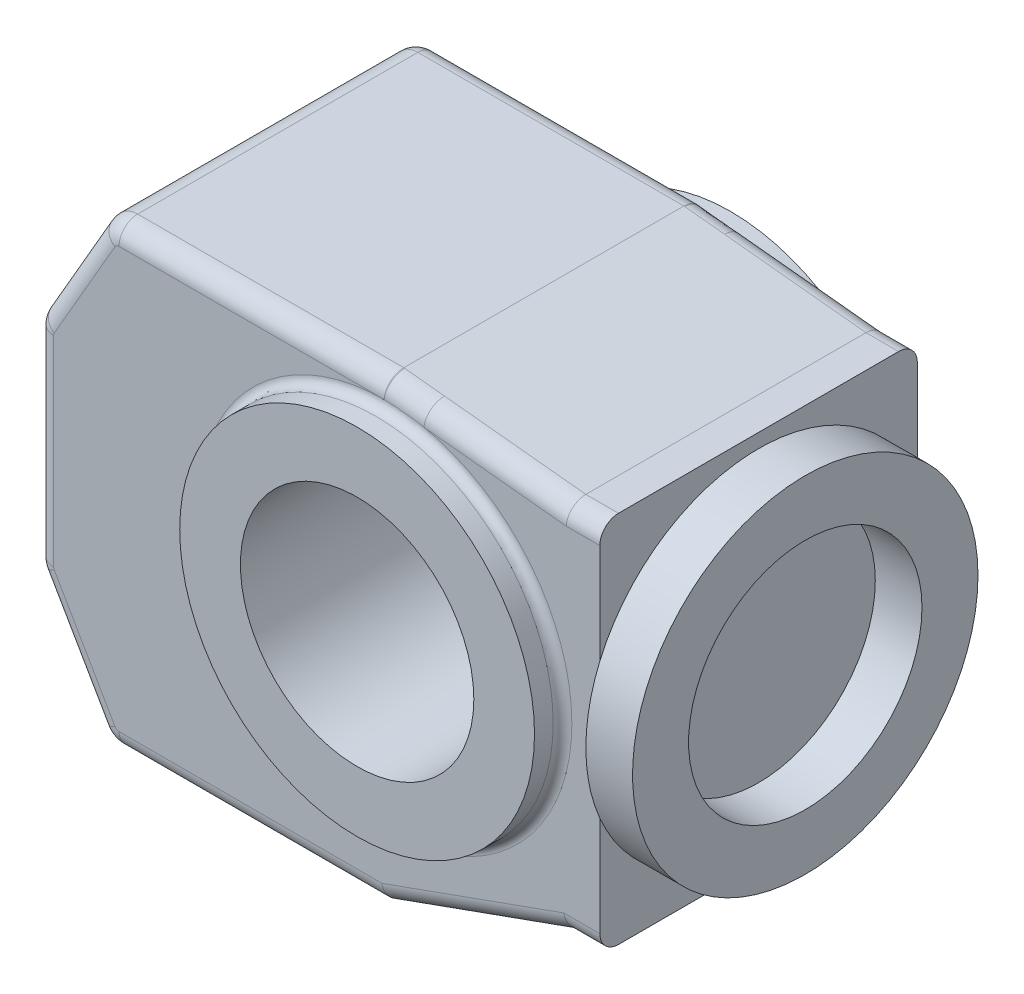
ISO-10303-21;
HEADER;
FILE_DESCRIPTION(('STEP AP214'),'2;1');
FILE_NAME('part.step','',(''),(''),'','','');
FILE_SCHEMA(('AUTOMOTIVE_DESIGN { 1 0 10303 214 1 1 1 1 }'));
ENDSEC;
DATA;
#1=APPLICATION_CONTEXT('core data for automotive mechanical design processes');
#2=APPLICATION_PROTOCOL_DEFINITION('international standard','automotive_design',2000,#1);
#3=PRODUCT_CONTEXT('',#1,'mechanical');
#4=PRODUCT('Part','Part','',(#3));
#5=PRODUCT_RELATED_PRODUCT_CATEGORY('part','',(#4));
#6=PRODUCT_DEFINITION_FORMATION('','',#4);
#7=PRODUCT_DEFINITION_CONTEXT('part definition',#1,'design');
#8=PRODUCT_DEFINITION('design','',#6,#7);
#9=PRODUCT_DEFINITION_SHAPE('','',#8);
#10=(LENGTH_UNIT() NAMED_UNIT(*) SI_UNIT(.MILLI.,.METRE.));
#11=(NAMED_UNIT(*) PLANE_ANGLE_UNIT() SI_UNIT($,.RADIAN.));
#12=(NAMED_UNIT(*) SI_UNIT($,.STERADIAN.) SOLID_ANGLE_UNIT());
#13=UNCERTAINTY_MEASURE_WITH_UNIT(LENGTH_MEASURE(1.E-05),#10,'distance_accuracy_value','');
#14=(GEOMETRIC_REPRESENTATION_CONTEXT(3) GLOBAL_UNCERTAINTY_ASSIGNED_CONTEXT((#13)) GLOBAL_UNIT_ASSIGNED_CONTEXT((#10,
#11,#12)) REPRESENTATION_CONTEXT('',''));
#15=CARTESIAN_POINT('',(0.,0.,0.));
#16=DIRECTION('',(0.,0.,1.));
#17=DIRECTION('',(1.,0.,0.));
#18=AXIS2_PLACEMENT_3D('',#15,#16,#17);
#19=CARTESIAN_POINT('',(46.,40.,34.));
#20=DIRECTION('',(-1.,0.,0.));
#21=DIRECTION('',(0.,0.,1.));
#22=AXIS2_PLACEMENT_3D('',#19,#20,#21);
#23=PLANE('',#22);
#24=CARTESIAN_POINT('',(46.,0.,0.));
#25=DIRECTION('',(1.,0.,0.));
#26=DIRECTION('',(0.,0.,-1.));
#27=AXIS2_PLACEMENT_3D('',#24,#25,#26);
#28=CIRCLE('',#27,37.);
#29=CARTESIAN_POINT('',(46.,14.5945195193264,-34.));
#30=VERTEX_POINT('',#29);
#31=CARTESIAN_POINT('',(46.,14.5945195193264,34.));
#32=VERTEX_POINT('',#31);
#33=EDGE_CURVE('E45',#30,#32,#28,.T.);
#34=ORIENTED_EDGE('',*,*,#33,.F.);
#35=DIRECTION('',(0.,1.,0.));
#36=VECTOR('',#35,1.);
#37=CARTESIAN_POINT('',(46.,40.,-34.));
#38=LINE('',#37,#36);
#39=CARTESIAN_POINT('',(46.,36.,-34.));
#40=VERTEX_POINT('',#39);
#41=EDGE_CURVE('E266',#30,#40,#38,.T.);
#42=ORIENTED_EDGE('',*,*,#41,.T.);
#43=CARTESIAN_POINT('',(46.,36.,-30.));
#44=DIRECTION('',(-1.,0.,0.));
#45=DIRECTION('',(0.,0.,1.));
#46=AXIS2_PLACEMENT_3D('',#43,#44,#45);
#47=CIRCLE('',#46,4.);
#48=CARTESIAN_POINT('',(46.,40.,-30.));
#49=VERTEX_POINT('',#48);
#50=EDGE_CURVE('E408',#40,#49,#47,.F.);
#51=ORIENTED_EDGE('',*,*,#50,.T.);
#52=DIRECTION('',(0.,0.,-1.));
#53=VECTOR('',#52,1.);
#54=CARTESIAN_POINT('',(46.,40.,34.));
#55=LINE('',#54,#53);
#56=CARTESIAN_POINT('',(46.,40.,30.));
#57=VERTEX_POINT('',#56);
#58=EDGE_CURVE('E289',#57,#49,#55,.T.);
#59=ORIENTED_EDGE('',*,*,#58,.F.);
#60=CARTESIAN_POINT('',(46.,36.,30.));
#61=DIRECTION('',(-1.,0.,0.));
#62=DIRECTION('',(0.,0.,1.));
#63=AXIS2_PLACEMENT_3D('',#60,#61,#62);
#64=CIRCLE('',#63,4.);
#65=CARTESIAN_POINT('',(46.,36.,34.));
#66=VERTEX_POINT('',#65);
#67=EDGE_CURVE('E405',#57,#66,#64,.F.);
#68=ORIENTED_EDGE('',*,*,#67,.T.);
#69=DIRECTION('',(0.,1.,0.));
#70=VECTOR('',#69,1.);
#71=CARTESIAN_POINT('',(46.,40.,34.));
#72=LINE('',#71,#70);
#73=EDGE_CURVE('E53',#32,#66,#72,.T.);
#74=ORIENTED_EDGE('',*,*,#73,.F.);
#75=EDGE_LOOP('',(#34,#42,#51,#59,#68,#74));
#76=FACE_BOUND('',#75,.T.);
#77=ADVANCED_FACE('F34',(#76),#23,.F.);
#78=CARTESIAN_POINT('',(46.,-14.5945195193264,34.));
#79=VERTEX_POINT('',#78);
#80=CARTESIAN_POINT('',(46.,-14.5945195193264,-34.));
#81=VERTEX_POINT('',#80);
#82=EDGE_CURVE('E11',#79,#81,#28,.T.);
#83=ORIENTED_EDGE('',*,*,#82,.F.);
#84=CARTESIAN_POINT('',(46.,-36.,34.));
#85=VERTEX_POINT('',#84);
#86=EDGE_CURVE('E288',#85,#79,#72,.T.);
#87=ORIENTED_EDGE('',*,*,#86,.F.);
#88=CARTESIAN_POINT('',(46.,-36.,30.));
#89=DIRECTION('',(-1.,0.,0.));
#90=DIRECTION('',(0.,0.,1.));
#91=AXIS2_PLACEMENT_3D('',#88,#89,#90);
#92=CIRCLE('',#91,4.);
#93=CARTESIAN_POINT('',(46.,-40.,30.));
#94=VERTEX_POINT('',#93);
#95=EDGE_CURVE('E403',#85,#94,#92,.F.);
#96=ORIENTED_EDGE('',*,*,#95,.T.);
#97=DIRECTION('',(0.,0.,-1.));
#98=VECTOR('',#97,1.);
#99=CARTESIAN_POINT('',(46.,-40.,34.));
#100=LINE('',#99,#98);
#101=CARTESIAN_POINT('',(46.,-40.,-30.));
#102=VERTEX_POINT('',#101);
#103=EDGE_CURVE('E294',#94,#102,#100,.T.);
#104=ORIENTED_EDGE('',*,*,#103,.T.);
#105=CARTESIAN_POINT('',(46.,-36.,-30.));
#106=DIRECTION('',(-1.,0.,0.));
#107=DIRECTION('',(0.,0.,1.));
#108=AXIS2_PLACEMENT_3D('',#105,#106,#107);
#109=CIRCLE('',#108,4.);
#110=CARTESIAN_POINT('',(46.,-36.,-34.));
#111=VERTEX_POINT('',#110);
#112=EDGE_CURVE('E261',#102,#111,#109,.F.);
#113=ORIENTED_EDGE('',*,*,#112,.T.);
#114=EDGE_CURVE('E256',#111,#81,#38,.T.);
#115=ORIENTED_EDGE('',*,*,#114,.T.);
#116=EDGE_LOOP('',(#83,#87,#96,#104,#113,#115));
#117=FACE_BOUND('',#116,.T.);
#118=ADVANCED_FACE('F258',(#117),#23,.F.);
#119=CARTESIAN_POINT('',(0.,0.,40.));
#120=DIRECTION('',(0.,0.,-1.));
#121=DIRECTION('',(-1.,0.,0.));
#122=AXIS2_PLACEMENT_3D('',#119,#120,#121);
#123=CYLINDRICAL_SURFACE('',#122,38.);
#124=CARTESIAN_POINT('',(0.,0.,36.));
#125=DIRECTION('',(0.,0.,1.));
#126=DIRECTION('',(1.,0.,0.));
#127=AXIS2_PLACEMENT_3D('',#124,#125,#126);
#128=CIRCLE('',#127,38.);
#129=CARTESIAN_POINT('',(38.,0.,36.));
#130=VERTEX_POINT('',#129);
#131=EDGE_CURVE('E336',#130,#130,#128,.T.);
#132=ORIENTED_EDGE('',*,*,#131,.T.);
#133=EDGE_LOOP('',(#132));
#134=FACE_BOUND('',#133,.T.);
#135=CARTESIAN_POINT('',(0.,0.,40.));
#136=DIRECTION('',(0.,0.,1.));
#137=DIRECTION('',(1.,0.,0.));
#138=AXIS2_PLACEMENT_3D('',#135,#136,#137);
#139=CIRCLE('',#138,38.);
#140=CARTESIAN_POINT('',(38.,0.,40.));
#141=VERTEX_POINT('',#140);
#142=EDGE_CURVE('E333',#141,#141,#139,.T.);
#143=ORIENTED_EDGE('',*,*,#142,.F.);
#144=EDGE_LOOP('',(#143));
#145=FACE_BOUND('',#144,.T.);
#146=ADVANCED_FACE('F517',(#134,#145),#123,.T.);
#147=CARTESIAN_POINT('',(0.,0.,40.));
#148=DIRECTION('',(0.,0.,1.));
#149=DIRECTION('',(1.,0.,0.));
#150=AXIS2_PLACEMENT_3D('',#147,#148,#149);
#151=PLANE('',#150);
#152=CARTESIAN_POINT('',(0.,0.,40.));
#153=DIRECTION('',(0.,0.,1.));
#154=DIRECTION('',(1.,0.,0.));
#155=AXIS2_PLACEMENT_3D('',#152,#153,#154);
#156=CIRCLE('',#155,25.);
#157=CARTESIAN_POINT('',(25.,0.,40.));
#158=VERTEX_POINT('',#157);
#159=EDGE_CURVE('E944',#158,#158,#156,.T.);
#160=ORIENTED_EDGE('',*,*,#159,.F.);
#161=EDGE_LOOP('',(#160));
#162=FACE_BOUND('',#161,.T.);
#163=ORIENTED_EDGE('',*,*,#142,.T.);
#164=EDGE_LOOP('',(#163));
#165=FACE_BOUND('',#164,.T.);
#166=ADVANCED_FACE('F845',(#162,#165),#151,.T.);
#167=CARTESIAN_POINT('',(-57.,39.,34.));
#168=DIRECTION('',(0.,0.,1.));
#169=DIRECTION('',(1.,0.,0.));
#170=AXIS2_PLACEMENT_3D('',#167,#168,#169);
#171=PLANE('',#170);
#172=ORIENTED_EDGE('',*,*,#86,.T.);
#173=EDGE_CURVE('E290',#79,#32,#72,.T.);
#174=ORIENTED_EDGE('',*,*,#173,.T.);
#175=ORIENTED_EDGE('',*,*,#73,.T.);
#176=DIRECTION('',(-1.,0.,0.));
#177=VECTOR('',#176,1.);
#178=CARTESIAN_POINT('',(39.,36.,34.));
#179=LINE('',#178,#177);
#180=CARTESIAN_POINT('',(38.7954084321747,36.,34.));
#181=VERTEX_POINT('',#180);
#182=EDGE_CURVE('E685',#66,#181,#179,.T.);
#183=ORIENTED_EDGE('',*,*,#182,.T.);
#184=DIRECTION('',(-0.994781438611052,0.102028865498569,0.));
#185=VECTOR('',#184,1.);
#186=CARTESIAN_POINT('',(-0.40811546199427,40.0208742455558,34.));
#187=LINE('',#186,#185);
#188=CARTESIAN_POINT('',(8.31518388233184,39.126176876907,34.));
#189=VERTEX_POINT('',#188);
#190=EDGE_CURVE('E990',#181,#189,#187,.T.);
#191=ORIENTED_EDGE('',*,*,#190,.T.);
#192=CARTESIAN_POINT('',(0.,0.,34.));
#193=DIRECTION('',(0.,0.,1.));
#194=DIRECTION('',(1.,0.,0.));
#195=AXIS2_PLACEMENT_3D('',#192,#193,#194);
#196=CIRCLE('',#195,40.);
#197=CARTESIAN_POINT('',(-0.199729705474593,39.9995013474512,34.));
#198=VERTEX_POINT('',#197);
#199=EDGE_CURVE('E341',#189,#198,#196,.F.);
#200=ORIENTED_EDGE('',*,*,#199,.T.);
#201=DIRECTION('',(-0.994781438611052,0.102028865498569,0.));
#202=VECTOR('',#201,1.);
#203=CARTESIAN_POINT('',(-0.40811546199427,40.0208742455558,34.));
#204=LINE('',#203,#202);
#205=CARTESIAN_POINT('',(-0.204591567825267,40.,34.));
#206=VERTEX_POINT('',#205);
#207=EDGE_CURVE('E983',#198,#206,#204,.T.);
#208=ORIENTED_EDGE('',*,*,#207,.T.);
#209=DIRECTION('',(-1.,0.,0.));
#210=VECTOR('',#209,1.);
#211=CARTESIAN_POINT('',(-57.,40.,34.));
#212=LINE('',#211,#210);
#213=CARTESIAN_POINT('',(-57.,40.,34.));
#214=VERTEX_POINT('',#213);
#215=EDGE_CURVE('E1061',#206,#214,#212,.T.);
#216=ORIENTED_EDGE('',*,*,#215,.T.);
#217=CARTESIAN_POINT('',(-57.,39.,34.));
#218=DIRECTION('',(0.,0.,1.));
#219=DIRECTION('',(1.,0.,0.));
#220=AXIS2_PLACEMENT_3D('',#217,#218,#219);
#221=CIRCLE('',#220,0.999999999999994);
#222=CARTESIAN_POINT('',(-57.8660253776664,39.5000000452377,34.));
#223=VERTEX_POINT('',#222);
#224=EDGE_CURVE('E1059',#214,#223,#221,.T.);
#225=ORIENTED_EDGE('',*,*,#224,.T.);
#226=DIRECTION('',(-0.500000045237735,-0.866025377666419,0.));
#227=VECTOR('',#226,1.);
#228=CARTESIAN_POINT('',(-70.8660253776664,16.983342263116,34.));
#229=LINE('',#228,#227);
#230=CARTESIAN_POINT('',(-70.8660253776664,16.983342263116,34.));
#231=VERTEX_POINT('',#230);
#232=EDGE_CURVE('E1057',#223,#231,#229,.T.);
#233=ORIENTED_EDGE('',*,*,#232,.T.);
#234=CARTESIAN_POINT('',(-70.,16.4833422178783,34.));
#235=DIRECTION('',(0.,0.,1.));
#236=DIRECTION('',(1.,0.,0.));
#237=AXIS2_PLACEMENT_3D('',#234,#235,#236);
#238=CIRCLE('',#237,1.);
#239=CARTESIAN_POINT('',(-71.,16.4833422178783,34.));
#240=VERTEX_POINT('',#239);
#241=EDGE_CURVE('E1055',#231,#240,#238,.T.);
#242=ORIENTED_EDGE('',*,*,#241,.T.);
#243=DIRECTION('',(0.,-1.,0.));
#244=VECTOR('',#243,1.);
#245=CARTESIAN_POINT('',(-71.,-26.4833367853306,34.));
#246=LINE('',#245,#244);
#247=CARTESIAN_POINT('',(-71.,-26.4833367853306,34.));
#248=VERTEX_POINT('',#247);
#249=EDGE_CURVE('E1053',#240,#248,#246,.T.);
#250=ORIENTED_EDGE('',*,*,#249,.T.);
#251=CARTESIAN_POINT('',(-70.,-26.4833367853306,34.));
#252=DIRECTION('',(0.,0.,1.));
#253=DIRECTION('',(1.,0.,0.));
#254=AXIS2_PLACEMENT_3D('',#251,#252,#253);
#255=CIRCLE('',#254,0.999999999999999);
#256=CARTESIAN_POINT('',(-70.8660254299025,-26.9833367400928,34.));
#257=VERTEX_POINT('',#256);
#258=EDGE_CURVE('E1051',#248,#257,#255,.T.);
#259=ORIENTED_EDGE('',*,*,#258,.T.);
#260=DIRECTION('',(0.499999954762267,-0.866025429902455,0.));
#261=VECTOR('',#260,1.);
#262=CARTESIAN_POINT('',(-57.8660254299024,-49.4999999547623,34.));
#263=LINE('',#262,#261);
#264=CARTESIAN_POINT('',(-57.8660254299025,-49.4999999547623,34.));
#265=VERTEX_POINT('',#264);
#266=EDGE_CURVE('E1049',#257,#265,#263,.T.);
#267=ORIENTED_EDGE('',*,*,#266,.T.);
#268=CARTESIAN_POINT('',(-57.,-49.,34.));
#269=DIRECTION('',(0.,0.,1.));
#270=DIRECTION('',(1.,0.,0.));
#271=AXIS2_PLACEMENT_3D('',#268,#269,#270);
#272=CIRCLE('',#271,0.999999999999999);
#273=CARTESIAN_POINT('',(-57.,-50.,34.));
#274=VERTEX_POINT('',#273);
#275=EDGE_CURVE('E1047',#265,#274,#272,.T.);
#276=ORIENTED_EDGE('',*,*,#275,.T.);
#277=DIRECTION('',(1.,0.,0.));
#278=VECTOR('',#277,1.);
#279=CARTESIAN_POINT('',(0.,-50.,34.));
#280=LINE('',#279,#278);
#281=CARTESIAN_POINT('',(-0.696199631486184,-50.,34.));
#282=VERTEX_POINT('',#281);
#283=EDGE_CURVE('E1045',#274,#282,#280,.T.);
#284=ORIENTED_EDGE('',*,*,#283,.T.);
#285=DIRECTION('',(0.941194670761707,0.337864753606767,0.));
#286=VECTOR('',#285,1.);
#287=CARTESIAN_POINT('',(37.6485409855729,-36.2352213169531,34.));
#288=LINE('',#287,#286);
#289=CARTESIAN_POINT('',(38.3038003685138,-36.,34.));
#290=VERTEX_POINT('',#289);
#291=EDGE_CURVE('E1043',#282,#290,#288,.T.);
#292=ORIENTED_EDGE('',*,*,#291,.T.);
#293=DIRECTION('',(1.,0.,0.));
#294=VECTOR('',#293,1.);
#295=CARTESIAN_POINT('',(46.,-36.,34.));
#296=LINE('',#295,#294);
#297=EDGE_CURVE('E1041',#290,#85,#296,.T.);
#298=ORIENTED_EDGE('',*,*,#297,.T.);
#299=EDGE_LOOP('',(#172,#174,#175,#183,#191,#200,#208,#216,#225,#233,#242,#250,#259,#267,#276,
#284,#292,#298));
#300=FACE_BOUND('',#299,.T.);
#301=ADVANCED_FACE('F840',(#300),#171,.T.);
#302=CARTESIAN_POINT('',(-57.,39.,-34.));
#303=DIRECTION('',(0.,0.,1.));
#304=DIRECTION('',(1.,0.,0.));
#305=AXIS2_PLACEMENT_3D('',#302,#303,#304);
#306=PLANE('',#305);
#307=DIRECTION('',(-0.994781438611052,0.102028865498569,0.));
#308=VECTOR('',#307,1.);
#309=CARTESIAN_POINT('',(-56.3072696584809,45.7541208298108,-34.));
#310=LINE('',#309,#308);
#311=CARTESIAN_POINT('',(8.31518388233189,39.1261768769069,-34.));
#312=VERTEX_POINT('',#311);
#313=CARTESIAN_POINT('',(38.7954084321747,36.,-34.));
#314=VERTEX_POINT('',#313);
#315=EDGE_CURVE('E379',#312,#314,#310,.F.);
#316=ORIENTED_EDGE('',*,*,#315,.T.);
#317=DIRECTION('',(-1.,0.,0.));
#318=VECTOR('',#317,1.);
#319=CARTESIAN_POINT('',(-57.,36.,-34.));
#320=LINE('',#319,#318);
#321=EDGE_CURVE('E381',#314,#40,#320,.F.);
#322=ORIENTED_EDGE('',*,*,#321,.T.);
#323=ORIENTED_EDGE('',*,*,#41,.F.);
#324=EDGE_CURVE('E264',#81,#30,#38,.T.);
#325=ORIENTED_EDGE('',*,*,#324,.F.);
#326=ORIENTED_EDGE('',*,*,#114,.F.);
#327=DIRECTION('',(1.,0.,0.));
#328=VECTOR('',#327,1.);
#329=CARTESIAN_POINT('',(-57.,-36.,-34.));
#330=LINE('',#329,#328);
#331=CARTESIAN_POINT('',(38.3038003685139,-36.,-34.));
#332=VERTEX_POINT('',#331);
#333=EDGE_CURVE('E355',#111,#332,#330,.F.);
#334=ORIENTED_EDGE('',*,*,#333,.T.);
#335=DIRECTION('',(0.941194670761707,0.337864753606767,0.));
#336=VECTOR('',#335,1.);
#337=CARTESIAN_POINT('',(-22.2710862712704,-57.744831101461,-34.));
#338=LINE('',#337,#336);
#339=CARTESIAN_POINT('',(-0.696199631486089,-50.,-34.));
#340=VERTEX_POINT('',#339);
#341=EDGE_CURVE('E357',#332,#340,#338,.F.);
#342=ORIENTED_EDGE('',*,*,#341,.T.);
#343=DIRECTION('',(1.,0.,0.));
#344=VECTOR('',#343,1.);
#345=CARTESIAN_POINT('',(-57.,-50.,-34.));
#346=LINE('',#345,#344);
#347=CARTESIAN_POINT('',(-57.,-50.,-34.));
#348=VERTEX_POINT('',#347);
#349=EDGE_CURVE('E359',#340,#348,#346,.F.);
#350=ORIENTED_EDGE('',*,*,#349,.T.);
#351=CARTESIAN_POINT('',(-57.,-49.,-34.));
#352=DIRECTION('',(0.,0.,1.));
#353=DIRECTION('',(1.,0.,0.));
#354=AXIS2_PLACEMENT_3D('',#351,#352,#353);
#355=CIRCLE('',#354,0.999999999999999);
#356=CARTESIAN_POINT('',(-57.8660254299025,-49.4999999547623,-34.));
#357=VERTEX_POINT('',#356);
#358=EDGE_CURVE('E361',#348,#357,#355,.F.);
#359=ORIENTED_EDGE('',*,*,#358,.T.);
#360=DIRECTION('',(0.499999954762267,-0.866025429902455,0.));
#361=VECTOR('',#360,1.);
#362=CARTESIAN_POINT('',(-95.971140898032,16.5000040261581,-34.));
#363=LINE('',#362,#361);
#364=CARTESIAN_POINT('',(-70.8660254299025,-26.9833367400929,-34.));
#365=VERTEX_POINT('',#364);
#366=EDGE_CURVE('E363',#357,#365,#363,.F.);
#367=ORIENTED_EDGE('',*,*,#366,.T.);
#368=CARTESIAN_POINT('',(-70.,-26.4833367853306,-34.));
#369=DIRECTION('',(0.,0.,1.));
#370=DIRECTION('',(1.,0.,0.));
#371=AXIS2_PLACEMENT_3D('',#368,#369,#370);
#372=CIRCLE('',#371,0.999999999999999);
#373=CARTESIAN_POINT('',(-71.,-26.4833367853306,-34.));
#374=VERTEX_POINT('',#373);
#375=EDGE_CURVE('E365',#365,#374,#372,.F.);
#376=ORIENTED_EDGE('',*,*,#375,.T.);
#377=DIRECTION('',(0.,-1.,0.));
#378=VECTOR('',#377,1.);
#379=CARTESIAN_POINT('',(-71.,39.,-34.));
#380=LINE('',#379,#378);
#381=CARTESIAN_POINT('',(-71.,16.4833422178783,-34.));
#382=VERTEX_POINT('',#381);
#383=EDGE_CURVE('E367',#374,#382,#380,.F.);
#384=ORIENTED_EDGE('',*,*,#383,.T.);
#385=CARTESIAN_POINT('',(-70.,16.4833422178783,-34.));
#386=DIRECTION('',(0.,0.,1.));
#387=DIRECTION('',(1.,0.,0.));
#388=AXIS2_PLACEMENT_3D('',#385,#386,#387);
#389=CIRCLE('',#388,1.);
#390=CARTESIAN_POINT('',(-70.8660253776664,16.983342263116,-34.));
#391=VERTEX_POINT('',#390);
#392=EDGE_CURVE('E369',#382,#391,#389,.F.);
#393=ORIENTED_EDGE('',*,*,#392,.T.);
#394=DIRECTION('',(-0.500000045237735,-0.866025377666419,0.));
#395=VECTOR('',#394,1.);
#396=CARTESIAN_POINT('',(-57.8660253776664,39.5000000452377,-34.));
#397=LINE('',#396,#395);
#398=CARTESIAN_POINT('',(-57.8660253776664,39.5000000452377,-34.));
#399=VERTEX_POINT('',#398);
#400=EDGE_CURVE('E371',#391,#399,#397,.F.);
#401=ORIENTED_EDGE('',*,*,#400,.T.);
#402=CARTESIAN_POINT('',(-57.,39.,-34.));
#403=DIRECTION('',(0.,0.,1.));
#404=DIRECTION('',(1.,0.,0.));
#405=AXIS2_PLACEMENT_3D('',#402,#403,#404);
#406=CIRCLE('',#405,0.999999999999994);
#407=CARTESIAN_POINT('',(-57.,40.,-34.));
#408=VERTEX_POINT('',#407);
#409=EDGE_CURVE('E373',#399,#408,#406,.F.);
#410=ORIENTED_EDGE('',*,*,#409,.T.);
#411=DIRECTION('',(-1.,0.,0.));
#412=VECTOR('',#411,1.);
#413=CARTESIAN_POINT('',(-57.,40.,-34.));
#414=LINE('',#413,#412);
#415=CARTESIAN_POINT('',(-0.204591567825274,40.,-34.));
#416=VERTEX_POINT('',#415);
#417=EDGE_CURVE('E375',#408,#416,#414,.F.);
#418=ORIENTED_EDGE('',*,*,#417,.T.);
#419=DIRECTION('',(-0.994781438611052,0.102028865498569,0.));
#420=VECTOR('',#419,1.);
#421=CARTESIAN_POINT('',(-56.3072696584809,45.7541208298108,-34.));
#422=LINE('',#421,#420);
#423=CARTESIAN_POINT('',(-0.199729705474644,39.9995013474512,-34.));
#424=VERTEX_POINT('',#423);
#425=EDGE_CURVE('E377',#416,#424,#422,.F.);
#426=ORIENTED_EDGE('',*,*,#425,.T.);
#427=CARTESIAN_POINT('',(0.,0.,-34.));
#428=DIRECTION('',(0.,0.,1.));
#429=DIRECTION('',(1.,0.,0.));
#430=AXIS2_PLACEMENT_3D('',#427,#428,#429);
#431=CIRCLE('',#430,40.);
#432=EDGE_CURVE('E344',#424,#312,#431,.T.);
#433=ORIENTED_EDGE('',*,*,#432,.T.);
#434=EDGE_LOOP('',(#316,#322,#323,#325,#326,#334,#342,#350,#359,#367,#376,#384,#393,#401,#410,
#418,#426,#433));
#435=FACE_BOUND('',#434,.T.);
#436=ADVANCED_FACE('F270',(#435),#306,.F.);
#437=CARTESIAN_POINT('',(46.,40.,34.));
#438=DIRECTION('',(0.,-1.,0.));
#439=DIRECTION('',(0.,0.,-1.));
#440=AXIS2_PLACEMENT_3D('',#437,#438,#439);
#441=PLANE('',#440);
#442=ORIENTED_EDGE('',*,*,#58,.T.);
#443=DIRECTION('',(-1.,0.,0.));
#444=VECTOR('',#443,1.);
#445=CARTESIAN_POINT('',(46.,40.,-30.));
#446=LINE('',#445,#444);
#447=CARTESIAN_POINT('',(39.,40.,-30.));
#448=VERTEX_POINT('',#447);
#449=EDGE_CURVE('E401',#49,#448,#446,.T.);
#450=ORIENTED_EDGE('',*,*,#449,.T.);
#451=DIRECTION('',(0.,0.,-1.));
#452=VECTOR('',#451,1.);
#453=CARTESIAN_POINT('',(39.,40.,34.));
#454=LINE('',#453,#452);
#455=CARTESIAN_POINT('',(39.,40.,30.));
#456=VERTEX_POINT('',#455);
#457=EDGE_CURVE('E329',#456,#448,#454,.T.);
#458=ORIENTED_EDGE('',*,*,#457,.F.);
#459=DIRECTION('',(-1.,0.,0.));
#460=VECTOR('',#459,1.);
#461=CARTESIAN_POINT('',(46.,40.,30.));
#462=LINE('',#461,#460);
#463=EDGE_CURVE('E399',#456,#57,#462,.F.);
#464=ORIENTED_EDGE('',*,*,#463,.T.);
#465=EDGE_LOOP('',(#442,#450,#458,#464));
#466=FACE_BOUND('',#465,.T.);
#467=ADVANCED_FACE('F567',(#466),#441,.F.);
#468=CARTESIAN_POINT('',(39.,40.,34.));
#469=DIRECTION('',(-0.102028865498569,-0.994781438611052,0.));
#470=DIRECTION('',(0.994781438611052,-0.102028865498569,0.));
#471=AXIS2_PLACEMENT_3D('',#468,#469,#470);
#472=PLANE('',#471);
#473=ORIENTED_EDGE('',*,*,#457,.T.);
#474=DIRECTION('',(-0.994781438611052,0.102028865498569,0.));
#475=VECTOR('',#474,1.);
#476=CARTESIAN_POINT('',(39.,40.,-30.));
#477=LINE('',#476,#475);
#478=CARTESIAN_POINT('',(8.72329934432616,43.1053026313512,-30.));
#479=VERTEX_POINT('',#478);
#480=EDGE_CURVE('E699',#448,#479,#477,.T.);
#481=ORIENTED_EDGE('',*,*,#480,.T.);
#482=CARTESIAN_POINT('',(19.3183494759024,36.1534919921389,-34.2628643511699));
#483=CARTESIAN_POINT('',(19.3054886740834,38.1619978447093,-35.2701355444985));
#484=CARTESIAN_POINT('',(19.74696447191,40.0456942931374,-34.1274880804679));
#485=CARTESIAN_POINT('',(20.1884402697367,41.9293907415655,-32.9848406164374));
#486=CARTESIAN_POINT('',(20.6606766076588,41.8809562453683,-30.7885930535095));
#487=CARTESIAN_POINT('',(19.11177901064,36.2285844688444,-34.2451140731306));
#488=CARTESIAN_POINT('',(19.1186162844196,38.2328570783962,-35.2165883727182));
#489=CARTESIAN_POINT('',(19.5451195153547,40.092296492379,-34.066998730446));
#490=CARTESIAN_POINT('',(19.9724852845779,41.9515399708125,-32.9176565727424));
#491=CARTESIAN_POINT('',(20.4154843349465,41.9061041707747,-30.7353422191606));
#492=CARTESIAN_POINT('',(18.9031350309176,36.3033789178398,-34.2287392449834));
#493=CARTESIAN_POINT('',(18.9269422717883,38.3028843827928,-35.1650060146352));
#494=CARTESIAN_POINT('',(19.3395219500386,40.1385621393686,-34.0094489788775));
#495=CARTESIAN_POINT('',(19.752931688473,41.9740582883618,-32.85410681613));
#496=CARTESIAN_POINT('',(20.1694374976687,41.9313397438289,-30.6862177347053));
#497=CARTESIAN_POINT('',(18.4820497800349,36.4521104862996,-34.1984485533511));
#498=CARTESIAN_POINT('',(18.5359478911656,38.4408834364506,-35.0660016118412));
#499=CARTESIAN_POINT('',(18.9218822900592,40.2303458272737,-33.8999415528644));
#500=CARTESIAN_POINT('',(19.3086383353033,42.0196268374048,-32.7340996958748));
#501=CARTESIAN_POINT('',(19.6760531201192,41.9819432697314,-30.5953456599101));
#502=CARTESIAN_POINT('',(18.2696093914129,36.5260477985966,-34.1845321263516));
#503=CARTESIAN_POINT('',(18.3366110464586,38.5088808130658,-35.0185499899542));
#504=CARTESIAN_POINT('',(18.7098416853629,40.2758640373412,-33.8479825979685));
#505=CARTESIAN_POINT('',(19.0838652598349,42.0426804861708,-32.6775979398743));
#506=CARTESIAN_POINT('',(19.4287158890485,42.0073111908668,-30.5535963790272));
#507=CARTESIAN_POINT('',(17.8414104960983,36.6727615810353,-34.1588718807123));
#508=CARTESIAN_POINT('',(17.9315242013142,38.6427374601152,-34.9277838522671));
#509=CARTESIAN_POINT('',(18.2805081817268,40.3660525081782,-33.7493938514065));
#510=CARTESIAN_POINT('',(18.6302819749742,42.0892018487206,-32.571184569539));
#511=CARTESIAN_POINT('',(18.933316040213,42.058121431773,-30.4766156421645));
#512=CARTESIAN_POINT('',(17.6256557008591,36.7455391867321,-34.1471258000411));
#513=CARTESIAN_POINT('',(17.7257582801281,38.7086220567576,-34.8844394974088));
#514=CARTESIAN_POINT('',(18.0632210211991,40.4107236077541,-33.7027585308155));
#515=CARTESIAN_POINT('',(18.4014391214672,42.1126729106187,-32.5212297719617));
#516=CARTESIAN_POINT('',(18.6852544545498,42.0835636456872,-30.4413774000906));
#517=CARTESIAN_POINT('',(17.190834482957,36.8898094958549,-34.1255365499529));
#518=CARTESIAN_POINT('',(17.3084309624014,38.8383227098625,-34.8016765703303));
#519=CARTESIAN_POINT('',(17.6239339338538,40.499227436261,-33.6144091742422));
#520=CARTESIAN_POINT('',(17.940189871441,42.1599805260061,-32.4272929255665));
#521=CARTESIAN_POINT('',(18.1883851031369,42.1345246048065,-30.3766096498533));
#522=CARTESIAN_POINT('',(16.9717678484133,36.9613021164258,-34.115693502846));
#523=CARTESIAN_POINT('',(17.0968417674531,38.9021604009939,-34.7622354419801));
#524=CARTESIAN_POINT('',(17.4019337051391,40.5430601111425,-33.5726954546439));
#525=CARTESIAN_POINT('',(17.7077432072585,42.1838212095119,-32.3832801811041));
#526=CARTESIAN_POINT('',(17.9395772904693,42.1600433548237,-30.3470805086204));
#527=CARTESIAN_POINT('',(16.3112445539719,37.1731362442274,-34.0887245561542));
#528=CARTESIAN_POINT('',(16.4567684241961,39.0898856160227,-34.6499425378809));
#529=CARTESIAN_POINT('',(16.731212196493,40.6729875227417,-33.4546497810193));
#530=CARTESIAN_POINT('',(17.0084919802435,42.2555392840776,-32.259859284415));
#531=CARTESIAN_POINT('',(17.1938459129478,42.236528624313,-30.2661736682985));
#532=CARTESIAN_POINT('',(15.8651712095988,37.3112785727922,-34.0740843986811));
#533=CARTESIAN_POINT('',(16.0195351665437,39.2111042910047,-34.5823750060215));
#534=CARTESIAN_POINT('',(16.2764676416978,40.7577839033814,-33.3851204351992));
#535=CARTESIAN_POINT('',(16.5359351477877,42.3040066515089,-32.1882076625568));
#536=CARTESIAN_POINT('',(16.6961185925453,42.2875775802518,-30.222253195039));
#537=CARTESIAN_POINT('',(14.9619701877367,37.5803856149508,-34.0498818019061));
#538=CARTESIAN_POINT('',(15.1293103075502,39.4452495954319,-34.4605381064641));
#539=CARTESIAN_POINT('',(15.354706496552,40.9237427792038,-33.2614787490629));
#540=CARTESIAN_POINT('',(15.5826278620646,42.401781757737,-32.062756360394));
#541=CARTESIAN_POINT('',(15.6994781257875,42.3897971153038,-30.149645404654));
#542=CARTESIAN_POINT('',(14.5048392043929,37.711348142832,-34.0403209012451));
#543=CARTESIAN_POINT('',(14.6760448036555,39.5583124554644,-34.4061514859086));
#544=CARTESIAN_POINT('',(14.8876862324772,41.0049041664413,-33.2073710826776));
#545=CARTESIAN_POINT('',(15.1015392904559,42.4511241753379,-32.0088144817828));
#546=CARTESIAN_POINT('',(15.2005646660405,42.44096772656,-30.120962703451));
#547=CARTESIAN_POINT('',(13.5821975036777,37.9645319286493,-34.0250149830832));
#548=CARTESIAN_POINT('',(13.7584548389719,39.7758025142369,-34.3090821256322));
#549=CARTESIAN_POINT('',(13.9456627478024,41.1632102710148,-33.1121718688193));
#550=CARTESIAN_POINT('',(14.1350583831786,42.5502504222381,-31.9154824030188));
#551=CARTESIAN_POINT('',(14.2037688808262,42.5432031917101,-30.0750449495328));
#552=CARTESIAN_POINT('',(13.1167167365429,38.0867787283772,-34.0192583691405));
#553=CARTESIAN_POINT('',(13.2938920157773,39.8803726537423,-34.266275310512));
#554=CARTESIAN_POINT('',(13.470688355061,41.2403665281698,-33.0710409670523));
#555=CARTESIAN_POINT('',(13.6493585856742,42.6000657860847,-31.8759475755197));
#556=CARTESIAN_POINT('',(13.7058880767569,42.5942678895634,-30.057775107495));
#557=CARTESIAN_POINT('',(12.1771482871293,38.3219621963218,-34.0104360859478));
#558=CARTESIAN_POINT('',(12.3548989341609,40.0812437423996,-34.1904960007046));
#559=CARTESIAN_POINT('',(12.5134502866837,41.3908265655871,-32.9992842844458));
#560=CARTESIAN_POINT('',(12.673868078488,42.7001160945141,-31.8082120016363));
#561=CARTESIAN_POINT('',(12.7099796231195,42.6964123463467,-30.0313082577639));
#562=CARTESIAN_POINT('',(11.7030614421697,38.4348997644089,-34.0073701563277));
#563=CARTESIAN_POINT('',(11.8801764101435,40.1776486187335,-34.1574575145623));
#564=CARTESIAN_POINT('',(12.0311873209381,41.4641307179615,-32.9686574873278));
#565=CARTESIAN_POINT('',(12.1837491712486,42.7503847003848,-31.7799421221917));
#566=CARTESIAN_POINT('',(12.211951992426,42.7474921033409,-30.0221104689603));
#567=CARTESIAN_POINT('',(10.7469980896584,38.6506745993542,-34.0030239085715));
#568=CARTESIAN_POINT('',(10.9225019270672,40.3622263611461,-34.0996962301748));
#569=CARTESIAN_POINT('',(11.0605762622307,41.6068578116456,-32.9158870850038));
#570=CARTESIAN_POINT('',(11.2001986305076,42.8512616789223,-31.7321617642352));
#571=CARTESIAN_POINT('',(11.215496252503,42.849692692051,-30.0090717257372));
#572=CARTESIAN_POINT('',(10.265016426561,38.7535049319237,-34.0017448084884));
#573=CARTESIAN_POINT('',(10.4392419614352,40.4504831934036,-34.0749327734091));
#574=CARTESIAN_POINT('',(10.5722242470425,41.6762780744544,-32.8937492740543));
#575=CARTESIAN_POINT('',(10.7064377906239,42.9019038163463,-31.7126129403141));
#576=CARTESIAN_POINT('',(10.7170681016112,42.9008135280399,-30.0052344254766));
#577=CARTESIAN_POINT('',(9.29461744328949,38.9482145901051,-34.0002324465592));
#578=CARTESIAN_POINT('',(9.46652636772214,40.618624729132,-34.0324663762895));
#579=CARTESIAN_POINT('',(9.59105629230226,41.8110985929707,-32.8563001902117));
#580=CARTESIAN_POINT('',(9.71681432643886,43.0034036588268,-31.6801807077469));
#581=CARTESIAN_POINT('',(9.72019285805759,43.0030571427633,-30.0006973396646));
#582=CARTESIAN_POINT('',(8.80620000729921,39.0400937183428,-33.9999992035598));
#583=CARTESIAN_POINT('',(8.97676296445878,40.698586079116,-34.0147317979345));
#584=CARTESIAN_POINT('',(9.09824027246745,41.8764987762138,-32.8409890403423));
#585=CARTESIAN_POINT('',(9.22062814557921,43.0542945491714,-31.6672699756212));
#586=CARTESIAN_POINT('',(9.22174576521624,43.0541799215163,-29.9999976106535));
#587=CARTESIAN_POINT('',(7.96569040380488,39.1874488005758,-34.000000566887));
#588=CARTESIAN_POINT('',(8.13421001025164,40.8282514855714,-33.9895307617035));
#589=CARTESIAN_POINT('',(8.25180954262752,41.9849310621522,-32.8194858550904));
#590=CARTESIAN_POINT('',(8.36986972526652,43.1415518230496,-31.6494522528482));
#591=CARTESIAN_POINT('',(8.36851715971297,43.1416905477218,-30.0000017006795));
#592=CARTESIAN_POINT('',(7.61488036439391,39.2457843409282,-34.0001197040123));
#593=CARTESIAN_POINT('',(7.78265100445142,40.8800376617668,-33.9805737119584));
#594=CARTESIAN_POINT('',(7.899013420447,42.0289771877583,-32.811937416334));
#595=CARTESIAN_POINT('',(8.01572173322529,43.1778746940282,-31.6433072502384));
#596=CARTESIAN_POINT('',(8.01373531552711,43.1780784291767,-30.0003591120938));
#597=CARTESIAN_POINT('',(6.91114759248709,39.3563864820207,-34.0004391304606));
#598=CARTESIAN_POINT('',(7.07771976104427,40.979285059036,-33.9654321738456));
#599=CARTESIAN_POINT('',(7.19216922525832,42.1149474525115,-32.7992658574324));
#600=CARTESIAN_POINT('',(7.30696412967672,43.2505677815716,-31.6331058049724));
#601=CARTESIAN_POINT('',(7.30422271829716,43.2508489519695,-30.0013173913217));
#602=CARTESIAN_POINT('',(6.55822516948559,39.4086539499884,-34.0006394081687));
#603=CARTESIAN_POINT('',(6.72423419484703,41.0267673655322,-33.9592421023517));
#604=CARTESIAN_POINT('',(6.8381213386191,42.1568718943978,-32.794142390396));
#605=CARTESIAN_POINT('',(6.95223904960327,43.2869498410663,-31.6290453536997));
#606=CARTESIAN_POINT('',(6.94949196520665,43.2872315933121,-30.0019182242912));
#607=CARTESIAN_POINT('',(5.85062562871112,39.5069867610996,-34.0010060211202));
#608=CARTESIAN_POINT('',(6.01583496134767,41.117382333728,-33.9494229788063));
#609=CARTESIAN_POINT('',(6.12900875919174,42.2385806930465,-32.7860508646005));
#610=CARTESIAN_POINT('',(6.24241307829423,43.3597525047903,-31.6226813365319));
#611=CARTESIAN_POINT('',(6.23994999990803,43.3600051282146,-30.0030180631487));
#612=CARTESIAN_POINT('',(5.4959481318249,39.5530506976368,-34.0011723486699));
#613=CARTESIAN_POINT('',(5.66080643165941,41.1605316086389,-33.945791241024));
#614=CARTESIAN_POINT('',(5.77394385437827,42.2783645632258,-32.7830832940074));
#615=CARTESIAN_POINT('',(5.88719664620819,43.3961849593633,-31.6203759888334));
#616=CARTESIAN_POINT('',(5.88513878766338,43.3963960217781,-30.0035170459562));
#617=CARTESIAN_POINT('',(4.78540509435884,39.6388501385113,-34.001401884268));
#618=CARTESIAN_POINT('',(4.94989016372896,41.2424246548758,-33.94096433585));
#619=CARTESIAN_POINT('',(5.06321674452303,42.3557489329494,-32.7791444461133));
#620=CARTESIAN_POINT('',(5.17665866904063,43.4690606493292,-31.6173251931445));
#621=CARTESIAN_POINT('',(5.17549923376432,43.4691795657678,-30.0042056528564));
#622=CARTESIAN_POINT('',(4.42953949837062,39.6785853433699,-34.0014650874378));
#623=CARTESIAN_POINT('',(4.59388723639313,41.2811829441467,-33.9397677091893));
#624=CARTESIAN_POINT('',(4.70755451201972,42.3933493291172,-32.7781732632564));
#625=CARTESIAN_POINT('',(4.82122178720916,43.5055157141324,-31.6165788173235));
#626=CARTESIAN_POINT('',(4.82067089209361,43.5055722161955,-30.0043952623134));
#627=CARTESIAN_POINT('',(3.71715138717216,39.7516507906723,-34.0014650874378));
#628=CARTESIAN_POINT('',(3.88154117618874,41.3542440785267,-33.9397677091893));
#629=CARTESIAN_POINT('',(3.99600224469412,42.4663290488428,-32.7781732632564));
#630=CARTESIAN_POINT('',(4.11046331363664,43.5784140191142,-31.6165788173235));
#631=CARTESIAN_POINT('',(4.11101420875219,43.5783575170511,-30.0043952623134));
#632=CARTESIAN_POINT('',(3.36062887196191,39.7849810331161,-34.001401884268));
#633=CARTESIAN_POINT('',(3.52508249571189,41.3885587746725,-33.94096433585));
#634=CARTESIAN_POINT('',(3.64011220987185,42.5017083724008,-32.7791444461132));
#635=CARTESIAN_POINT('',(3.75502643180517,43.6148690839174,-31.6173251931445));
#636=CARTESIAN_POINT('',(3.75618586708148,43.6147501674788,-30.0042056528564));
#637=CARTESIAN_POINT('',(2.64746251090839,39.8452030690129,-34.0011723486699));
#638=CARTESIAN_POINT('',(2.81234364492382,41.4526816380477,-33.945791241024));
#639=CARTESIAN_POINT('',(2.92847380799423,42.5702076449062,-32.7830832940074));
#640=CARTESIAN_POINT('',(3.04448845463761,43.6877447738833,-31.6203759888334));
#641=CARTESIAN_POINT('',(3.04654631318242,43.6875337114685,-30.0035170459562));
#642=CARTESIAN_POINT('',(2.29081867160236,39.8720951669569,-34.0010060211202));
#643=CARTESIAN_POINT('',(2.45594773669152,41.4824989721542,-33.9494229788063));
#644=CARTESIAN_POINT('',(2.57272543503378,42.6033277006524,-32.7860508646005));
#645=CARTESIAN_POINT('',(2.68927202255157,43.7241772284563,-31.6226813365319));
#646=CARTESIAN_POINT('',(2.69173510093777,43.723924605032,-30.0030180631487));
#647=CARTESIAN_POINT('',(1.5779903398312,39.9194472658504,-34.0006394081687));
#648=CARTESIAN_POINT('',(1.74390302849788,41.5375705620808,-33.9592421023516));
#649=CARTESIAN_POINT('',(1.86179012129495,42.6672648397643,-32.794142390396));
#650=CARTESIAN_POINT('',(1.97944605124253,43.7969798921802,-31.6290453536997));
#651=CARTESIAN_POINT('',(1.98219313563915,43.7966981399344,-30.0019182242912));
#652=CARTESIAN_POINT('',(1.22180576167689,39.9399087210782,-34.0004391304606));
#653=CARTESIAN_POINT('',(1.38813838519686,41.5628318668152,-33.9654321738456));
#654=CARTESIAN_POINT('',(1.50660307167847,42.6980824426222,-32.7992658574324));
#655=CARTESIAN_POINT('',(1.62472097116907,43.833361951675,-31.6331058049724));
#656=CARTESIAN_POINT('',(1.62746238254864,43.8330807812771,-30.0013173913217));
#657=CARTESIAN_POINT('',(0.510273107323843,39.97446200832,-34.0001197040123));
#658=CARTESIAN_POINT('',(0.677737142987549,41.6087467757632,-33.9805737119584));
#659=CARTESIAN_POINT('',(0.797023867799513,42.7573863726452,-32.811937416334));
#660=CARTESIAN_POINT('',(0.9159633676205,43.9060550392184,-31.6433072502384));
#661=CARTESIAN_POINT('',(0.917949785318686,43.9058513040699,-30.0003591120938));
#662=CARTESIAN_POINT('',(0.154925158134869,39.9885529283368,-34.000000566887));
#663=CARTESIAN_POINT('',(0.322985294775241,41.6294027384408,-33.9895307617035));
#664=CARTESIAN_POINT('',(0.442631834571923,42.7858723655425,-32.8194858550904));
#665=CARTESIAN_POINT('',(0.561815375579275,43.942377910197,-31.6494522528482));
#666=CARTESIAN_POINT('',(0.563167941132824,43.9422391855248,-30.0000017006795));
#667=CARTESIAN_POINT('',(-0.69799724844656,40.0148831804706,-33.9999992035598));
#668=CARTESIAN_POINT('',(-0.52834704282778,41.6734691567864,-34.0147317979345));
#669=CARTESIAN_POINT('',(-0.40818737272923,42.851516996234,-32.8409890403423));
#670=CARTESIAN_POINT('',(-0.288943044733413,44.0296351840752,-31.6672699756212));
#671=CARTESIAN_POINT('',(-0.290060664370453,44.0297498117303,-29.9999976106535));
#672=CARTESIAN_POINT('',(-1.19489674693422,40.0240621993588,-34.0002324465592));
#673=CARTESIAN_POINT('',(-1.02414526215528,41.694591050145,-34.0324663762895));
#674=CARTESIAN_POINT('',(-0.90401884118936,42.8875165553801,-32.8563001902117));
#675=CARTESIAN_POINT('',(-0.785129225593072,44.0805260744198,-31.6801807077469));
#676=CARTESIAN_POINT('',(-0.7885077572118,44.0808725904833,-30.0006973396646));
#677=CARTESIAN_POINT('',(-2.18461690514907,40.0303904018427,-34.0017448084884));
#678=CARTESIAN_POINT('',(-2.01074066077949,41.7274044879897,-34.074932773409));
#679=CARTESIAN_POINT('',(-1.89212669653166,42.9546730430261,-32.8937492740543));
#680=CARTESIAN_POINT('',(-1.77475268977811,44.1820259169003,-31.7126129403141));
#681=CARTESIAN_POINT('',(-1.78538300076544,44.1831162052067,-30.0052344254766));
#682=CARTESIAN_POINT('',(-2.6774376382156,40.027539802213,-34.0030239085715));
#683=CARTESIAN_POINT('',(-2.50185476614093,41.7390834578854,-34.0996962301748));
#684=CARTESIAN_POINT('',(-2.38440314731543,42.9858300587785,-32.9158870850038));
#685=CARTESIAN_POINT('',(-2.26851352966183,44.2326680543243,-31.7321617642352));
#686=CARTESIAN_POINT('',(-2.28381115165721,44.2342370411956,-30.0090717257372));
#687=CARTESIAN_POINT('',(-3.65739671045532,40.0103313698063,-34.0073701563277));
#688=CARTESIAN_POINT('',(-3.47705863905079,41.7527496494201,-34.1574575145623));
#689=CARTESIAN_POINT('',(-3.36377887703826,43.0431016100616,-32.9686574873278));
#690=CARTESIAN_POINT('',(-3.25206407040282,44.3335450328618,-31.7799421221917));
#691=CARTESIAN_POINT('',(-3.28026689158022,44.3364376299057,-30.0221104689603));
#692=CARTESIAN_POINT('',(-4.14453869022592,39.9959813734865,-34.0104360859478));
#693=CARTESIAN_POINT('',(-3.96146704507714,41.7547171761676,-34.1904960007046));
#694=CARTESIAN_POINT('',(-3.85088145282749,43.0692195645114,-32.9992842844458));
#695=CARTESIAN_POINT('',(-3.74218297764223,44.3838136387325,-31.8082120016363));
#696=CARTESIAN_POINT('',(-3.77829452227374,44.3875173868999,-30.0313082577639));
#697=CARTESIAN_POINT('',(-5.11228609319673,39.9564200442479,-34.0192583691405));
#698=CARTESIAN_POINT('',(-4.92168589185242,41.7486370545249,-34.266275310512));
#699=CARTESIAN_POINT('',(-4.81873234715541,43.11620454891,-33.0710409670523));
#700=CARTESIAN_POINT('',(-4.71767348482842,44.4838639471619,-31.8759475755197));
#701=CARTESIAN_POINT('',(-4.7742029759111,44.4896618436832,-30.0577751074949));
#702=CARTESIAN_POINT('',(-5.59289087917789,39.9312076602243,-34.0250149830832));
#703=CARTESIAN_POINT('',(-5.39780360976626,41.7405469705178,-34.3090821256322));
#704=CARTESIAN_POINT('',(-5.29948004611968,43.1370710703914,-33.1121718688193));
#705=CARTESIAN_POINT('',(-5.20337328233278,44.5336793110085,-31.9154824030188));
#706=CARTESIAN_POINT('',(-5.2720837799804,44.5407265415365,-30.0750449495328));
#707=CARTESIAN_POINT('',(-6.54771788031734,39.8705847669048,-34.0403209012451));
#708=CARTESIAN_POINT('',(-6.34043847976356,41.7138492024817,-34.4061514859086));
#709=CARTESIAN_POINT('',(-6.2540258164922,43.1732848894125,-33.2073710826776));
#710=CARTESIAN_POINT('',(-6.16985418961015,44.6328055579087,-32.0088144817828));
#711=CARTESIAN_POINT('',(-6.26887956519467,44.6429620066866,-30.120962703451));
#712=CARTESIAN_POINT('',(-7.02191595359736,39.8351431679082,-34.0498818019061));
#713=CARTESIAN_POINT('',(-6.8072180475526,41.695149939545,-34.4605381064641));
#714=CARTESIAN_POINT('',(-6.72779800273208,43.1886150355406,-33.2614787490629));
#715=CARTESIAN_POINT('',(-6.65094276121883,44.6821479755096,-32.062756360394));
#716=CARTESIAN_POINT('',(-6.76779302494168,44.6941326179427,-30.149645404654));
#717=CARTESIAN_POINT('',(-7.96093933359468,39.7549822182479,-34.0740843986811));
#718=CARTESIAN_POINT('',(-7.72643844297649,41.6465887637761,-34.5823750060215));
#719=CARTESIAN_POINT('',(-7.66405674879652,43.2132223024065,-33.3851204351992));
#720=CARTESIAN_POINT('',(-7.60425004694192,44.7799230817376,-32.1882076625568));
#721=CARTESIAN_POINT('',(-7.76443349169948,44.7963521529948,-30.222253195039));
#722=CARTESIAN_POINT('',(-8.42576743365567,39.7102656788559,-34.0887245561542));
#723=CARTESIAN_POINT('',(-8.17917512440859,41.6166490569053,-34.6499425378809));
#724=CARTESIAN_POINT('',(-8.12654668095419,43.222501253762,-33.4546497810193));
#725=CARTESIAN_POINT('',(-8.07680687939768,44.828390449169,-32.259859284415));
#726=CARTESIAN_POINT('',(-8.26216081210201,44.8474011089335,-30.2661736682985));
#727=CARTESIAN_POINT('',(-9.11553959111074,39.6369233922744,-34.115693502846));
#728=CARTESIAN_POINT('',(-8.84402915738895,41.5627625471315,-34.76223544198));
#729=CARTESIAN_POINT('',(-8.80967825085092,43.2314305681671,-33.5726954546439));
#730=CARTESIAN_POINT('',(-8.77605810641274,44.9001085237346,-32.3832801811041));
#731=CARTESIAN_POINT('',(-9.0078921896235,44.9238863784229,-30.3470805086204));
#732=CARTESIAN_POINT('',(-9.34455779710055,39.6113881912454,-34.1255365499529));
#733=CARTESIAN_POINT('',(-9.06417170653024,41.5432050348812,-34.8016765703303));
#734=CARTESIAN_POINT('',(-9.03595420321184,43.2335749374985,-33.6144091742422));
#735=CARTESIAN_POINT('',(-9.00850477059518,44.9239492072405,-32.4272929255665));
#736=CARTESIAN_POINT('',(-9.25670000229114,44.9494051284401,-30.3766096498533));
#737=CARTESIAN_POINT('',(-9.79961197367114,39.5583871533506,-34.1471258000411));
#738=CARTESIAN_POINT('',(-9.49913866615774,41.5009191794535,-34.8844394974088));
#739=CARTESIAN_POINT('',(-9.48406107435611,43.2360858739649,-33.7027585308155));
#740=CARTESIAN_POINT('',(-9.46975402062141,44.9712568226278,-32.5212297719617));
#741=CARTESIAN_POINT('',(-9.75356935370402,45.0003660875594,-30.4413774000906));
#742=CARTESIAN_POINT('',(-10.0256481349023,39.5309214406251,-34.1588718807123));
#743=CARTESIAN_POINT('',(-9.71399468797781,41.4781752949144,-34.9277838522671));
#744=CARTESIAN_POINT('',(-9.70589227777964,43.2364525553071,-33.7493938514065));
#745=CARTESIAN_POINT('',(-9.69859687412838,44.994727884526,-32.571184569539));
#746=CARTESIAN_POINT('',(-10.0016309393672,45.0258083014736,-30.4766156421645));
#747=CARTESIAN_POINT('',(-10.4747138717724,39.4741835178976,-34.1845321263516));
#748=CARTESIAN_POINT('',(-10.1378196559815,41.4293352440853,-35.0185499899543));
#749=CARTESIAN_POINT('',(-10.1445947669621,43.2352934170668,-33.8479825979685));
#750=CARTESIAN_POINT('',(-10.1521801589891,45.0412492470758,-32.6775979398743));
#751=CARTESIAN_POINT('',(-10.4970307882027,45.0766185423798,-30.5535963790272));
#752=CARTESIAN_POINT('',(-10.6977400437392,39.4449094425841,-34.1984485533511));
#753=CARTESIAN_POINT('',(-10.3468093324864,41.4032175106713,-35.0660016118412));
#754=CARTESIAN_POINT('',(-10.3614606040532,43.2337656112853,-33.8999415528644));
#755=CARTESIAN_POINT('',(-10.3769532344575,45.0643028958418,-32.7340996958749));
#756=CARTESIAN_POINT('',(-10.7443680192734,45.1019864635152,-30.5953456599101));
#757=CARTESIAN_POINT('',(-11.1402498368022,39.3847517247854,-34.2287392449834));
#758=CARTESIAN_POINT('',(-10.7576761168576,41.3474606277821,-35.1650060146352));
#759=CARTESIAN_POINT('',(-10.7890365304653,43.2286707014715,-34.0094489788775));
#760=CARTESIAN_POINT('',(-10.8212465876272,45.1098714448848,-32.85410681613));
#761=CARTESIAN_POINT('',(-11.2377523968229,45.1525899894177,-30.6862177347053));
#762=CARTESIAN_POINT('',(-11.3597326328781,39.3538677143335,-34.2451140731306));
#763=CARTESIAN_POINT('',(-10.9595745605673,41.3177997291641,-35.2165883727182));
#764=CARTESIAN_POINT('',(-10.9997451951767,43.2251031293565,-34.066998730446));
#765=CARTESIAN_POINT('',(-11.0408001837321,45.132389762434,-32.9176565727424));
#766=CARTESIAN_POINT('',(-11.4837992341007,45.1778255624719,-30.7353422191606));
#767=CARTESIAN_POINT('',(-11.5772455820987,39.3222709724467,-34.2628643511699));
#768=CARTESIAN_POINT('',(-11.1569402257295,41.2863495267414,-35.2701355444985));
#769=CARTESIAN_POINT('',(-11.2068476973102,43.2204442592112,-34.1274880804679));
#770=CARTESIAN_POINT('',(-11.2567551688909,45.1545389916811,-32.9848406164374));
#771=CARTESIAN_POINT('',(-11.728991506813,45.2029734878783,-30.7885930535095));
#772=(BOUNDED_SURFACE() B_SPLINE_SURFACE(3,2,((#482,#483,#484,#485,#486),(#487,#488,#489,#490,
#491),(#492,#493,#494,#495,#496),(#497,#498,#499,#500,#501),(#502,#503,#504,#505,#506),(#507,
#508,#509,#510,#511),(#512,#513,#514,#515,#516),(#517,#518,#519,#520,#521),(#522,#523,#524,#525,
#526),(#527,#528,#529,#530,#531),(#532,#533,#534,#535,#536),(#537,#538,#539,#540,#541),(#542,
#543,#544,#545,#546),(#547,#548,#549,#550,#551),(#552,#553,#554,#555,#556),(#557,#558,#559,#560,
#561),(#562,#563,#564,#565,#566),(#567,#568,#569,#570,#571),(#572,#573,#574,#575,#576),(#577,
#578,#579,#580,#581),(#582,#583,#584,#585,#586),(#587,#588,#589,#590,#591),(#592,#593,#594,#595,
#596),(#597,#598,#599,#600,#601),(#602,#603,#604,#605,#606),(#607,#608,#609,#610,#611),(#612,
#613,#614,#615,#616),(#617,#618,#619,#620,#621),(#622,#623,#624,#625,#626),(#627,#628,#629,#630,
#631),(#632,#633,#634,#635,#636),(#637,#638,#639,#640,#641),(#642,#643,#644,#645,#646),(#647,
#648,#649,#650,#651),(#652,#653,#654,#655,#656),(#657,#658,#659,#660,#661),(#662,#663,#664,#665,
#666),(#667,#668,#669,#670,#671),(#672,#673,#674,#675,#676),(#677,#678,#679,#680,#681),(#682,
#683,#684,#685,#686),(#687,#688,#689,#690,#691),(#692,#693,#694,#695,#696),(#697,#698,#699,#700,
#701),(#702,#703,#704,#705,#706),(#707,#708,#709,#710,#711),(#712,#713,#714,#715,#716),(#717,
#718,#719,#720,#721),(#722,#723,#724,#725,#726),(#727,#728,#729,#730,#731),(#732,#733,#734,#735,
#736),(#737,#738,#739,#740,#741),(#742,#743,#744,#745,#746),(#747,#748,#749,#750,#751),(#752,
#753,#754,#755,#756),(#757,#758,#759,#760,#761),(#762,#763,#764,#765,#766),(#767,#768,#769,#770,
#771)),.UNSPECIFIED.,.F.,.F.,.F.) B_SPLINE_SURFACE_WITH_KNOTS((4,2,2,2,2,2,2,2,2,2,2,2,2,2,2,2,
2,2,2,2,2,2,2,2,2,2,2,2,4),(3,2,3),(0.,0.756414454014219,1.51265529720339,2.26810345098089,
3.02360014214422,4.53003671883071,6.03692937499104,7.53920718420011,9.04133960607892,
10.5444955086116,12.0476784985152,13.117608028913,14.1873844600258,15.2574030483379,
16.3274722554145,17.3975414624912,18.4675600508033,19.5373364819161,20.6072660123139,
22.1104490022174,23.6136049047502,25.115737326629,26.618015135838,28.1249077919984,
29.6313443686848,30.3868410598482,31.1422892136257,31.8985300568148,32.6549445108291),(0.,0.5,
1.),.UNSPECIFIED.) GEOMETRIC_REPRESENTATION_ITEM() RATIONAL_B_SPLINE_SURFACE(((1.,
0.871857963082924,1.,0.871857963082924,1.),(1.,0.873704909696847,1.,0.873704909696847,1.),(1.,
0.87549462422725,1.,0.87549462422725,1.),(1.,0.878963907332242,1.,0.878963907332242,1.),(1.,
0.880643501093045,1.,0.880643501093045,1.),(1.,0.883895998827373,1.,0.883895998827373,1.),(1.,
0.885469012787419,1.,0.885469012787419,1.),(1.,0.888514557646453,1.,0.888514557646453,1.),(1.,
0.889987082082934,1.,0.889987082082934,1.),(1.,0.894251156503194,1.,0.894251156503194,1.),(1.,
0.896898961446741,1.,0.896898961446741,1.),(1.,0.901836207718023,1.,0.901836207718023,1.),(1.,
0.904125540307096,1.,0.904125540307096,1.),(1.,0.908357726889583,1.,0.908357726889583,1.),(1.,
0.910301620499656,1.,0.910301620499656,1.),(1.,0.913865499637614,1.,0.913865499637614,1.),(1.,
0.915485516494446,1.,0.915485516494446,1.),(1.,0.9184131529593,1.,0.9184131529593,1.),(1.,
0.919720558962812,1.,0.919720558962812,1.),(1.,0.922028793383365,1.,0.922028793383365,1.),(1.,
0.923029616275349,1.,0.923029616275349,1.),(1.,0.924484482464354,1.,0.924484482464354,1.),(1.,
0.925012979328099,1.,0.925012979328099,1.),(1.,0.925918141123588,1.,0.925918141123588,1.),(1.,
0.926294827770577,1.,0.926294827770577,1.),(1.,0.926897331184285,1.,0.926897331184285,1.),(1.,
0.927123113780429,1.,0.927123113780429,1.),(1.,0.927424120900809,1.,0.927424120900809,1.),(1.,
0.927499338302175,1.,0.927499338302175,1.),(1.,0.927499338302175,1.,0.927499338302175,1.),(1.,
0.927424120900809,1.,0.927424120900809,1.),(1.,0.927123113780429,1.,0.927123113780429,1.),(1.,
0.926897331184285,1.,0.926897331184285,1.),(1.,0.926294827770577,1.,0.926294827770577,1.),(1.,
0.925918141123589,1.,0.925918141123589,1.),(1.,0.925012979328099,1.,0.925012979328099,1.),(1.,
0.924484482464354,1.,0.924484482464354,1.),(1.,0.92302961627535,1.,0.92302961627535,1.),(1.,
0.922028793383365,1.,0.922028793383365,1.),(1.,0.919720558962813,1.,0.919720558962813,1.),(1.,
0.9184131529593,1.,0.9184131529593,1.),(1.,0.915485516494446,1.,0.915485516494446,1.),(1.,
0.913865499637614,1.,0.913865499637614,1.),(1.,0.910301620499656,1.,0.910301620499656,1.),(1.,
0.908357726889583,1.,0.908357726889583,1.),(1.,0.904125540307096,1.,0.904125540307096,1.),(1.,
0.901836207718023,1.,0.901836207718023,1.),(1.,0.896898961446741,1.,0.896898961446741,1.),(1.,
0.894251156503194,1.,0.894251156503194,1.),(1.,0.889987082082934,1.,0.889987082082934,1.),(1.,
0.888514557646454,1.,0.888514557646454,1.),(1.,0.885469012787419,1.,0.885469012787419,1.),(1.,
0.883895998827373,1.,0.883895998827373,1.),(1.,0.880643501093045,1.,0.880643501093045,1.),(1.,
0.878963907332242,1.,0.878963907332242,1.),(1.,0.87549462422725,1.,0.87549462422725,1.),(1.,
0.873704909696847,1.,0.873704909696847,1.),(1.,0.871857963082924,1.,0.871857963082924,1.))) REPRESENTATION_ITEM('') SURFACE());
#773=CARTESIAN_POINT('',(20.6606766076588,41.8809562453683,-30.7885930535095));
#774=CARTESIAN_POINT('',(20.4154843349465,41.9061041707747,-30.7353422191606));
#775=CARTESIAN_POINT('',(20.1694374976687,41.9313397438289,-30.6862177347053));
#776=CARTESIAN_POINT('',(19.6760531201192,41.9819432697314,-30.5953456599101));
#777=CARTESIAN_POINT('',(19.4287158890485,42.0073111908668,-30.5535963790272));
#778=CARTESIAN_POINT('',(18.933316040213,42.058121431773,-30.4766156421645));
#779=CARTESIAN_POINT('',(18.6852544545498,42.0835636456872,-30.4413774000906));
#780=CARTESIAN_POINT('',(18.1883851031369,42.1345246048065,-30.3766096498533));
#781=CARTESIAN_POINT('',(17.9395772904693,42.1600433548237,-30.3470805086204));
#782=CARTESIAN_POINT('',(17.1938459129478,42.236528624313,-30.2661736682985));
#783=CARTESIAN_POINT('',(16.6961185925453,42.2875775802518,-30.222253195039));
#784=CARTESIAN_POINT('',(15.6994781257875,42.3897971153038,-30.149645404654));
#785=CARTESIAN_POINT('',(15.2005646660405,42.44096772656,-30.120962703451));
#786=CARTESIAN_POINT('',(14.2037688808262,42.5432031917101,-30.0750449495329));
#787=CARTESIAN_POINT('',(13.7058880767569,42.5942678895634,-30.0577751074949));
#788=CARTESIAN_POINT('',(12.7099796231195,42.6964123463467,-30.0313082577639));
#789=CARTESIAN_POINT('',(12.211951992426,42.7474921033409,-30.0221104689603));
#790=CARTESIAN_POINT('',(11.215496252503,42.849692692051,-30.0090717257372));
#791=CARTESIAN_POINT('',(10.7170681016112,42.9008135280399,-30.0052344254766));
#792=CARTESIAN_POINT('',(9.72019285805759,43.0030571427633,-30.0006973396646));
#793=CARTESIAN_POINT('',(9.22174576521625,43.0541799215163,-29.9999976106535));
#794=CARTESIAN_POINT('',(8.36851715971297,43.1416905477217,-30.0000017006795));
#795=CARTESIAN_POINT('',(8.01373531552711,43.1780784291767,-30.0003591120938));
#796=CARTESIAN_POINT('',(7.30422271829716,43.2508489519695,-30.0013173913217));
#797=CARTESIAN_POINT('',(6.94949196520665,43.2872315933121,-30.0019182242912));
#798=CARTESIAN_POINT('',(6.23994999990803,43.3600051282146,-30.0030180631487));
#799=CARTESIAN_POINT('',(5.88513878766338,43.3963960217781,-30.0035170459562));
#800=CARTESIAN_POINT('',(5.17549923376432,43.4691795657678,-30.0042056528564));
#801=CARTESIAN_POINT('',(4.82067089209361,43.5055722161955,-30.0043952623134));
#802=CARTESIAN_POINT('',(4.11101420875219,43.5783575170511,-30.0043952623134));
#803=CARTESIAN_POINT('',(3.75618586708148,43.6147501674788,-30.0042056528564));
#804=CARTESIAN_POINT('',(3.04654631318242,43.6875337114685,-30.0035170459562));
#805=CARTESIAN_POINT('',(2.69173510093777,43.723924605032,-30.0030180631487));
#806=CARTESIAN_POINT('',(1.98219313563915,43.7966981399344,-30.0019182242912));
#807=CARTESIAN_POINT('',(1.62746238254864,43.8330807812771,-30.0013173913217));
#808=CARTESIAN_POINT('',(0.917949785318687,43.9058513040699,-30.0003591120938));
#809=CARTESIAN_POINT('',(0.563167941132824,43.9422391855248,-30.0000017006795));
#810=CARTESIAN_POINT('',(-0.290060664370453,44.0297498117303,-29.9999976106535));
#811=CARTESIAN_POINT('',(-0.788507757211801,44.0808725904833,-30.0006973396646));
#812=CARTESIAN_POINT('',(-1.78538300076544,44.1831162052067,-30.0052344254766));
#813=CARTESIAN_POINT('',(-2.28381115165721,44.2342370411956,-30.0090717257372));
#814=CARTESIAN_POINT('',(-3.28026689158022,44.3364376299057,-30.0221104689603));
#815=CARTESIAN_POINT('',(-3.77829452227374,44.3875173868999,-30.0313082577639));
#816=CARTESIAN_POINT('',(-4.7742029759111,44.4896618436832,-30.0577751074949));
#817=CARTESIAN_POINT('',(-5.2720837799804,44.5407265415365,-30.0750449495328));
#818=CARTESIAN_POINT('',(-6.26887956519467,44.6429620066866,-30.120962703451));
#819=CARTESIAN_POINT('',(-6.76779302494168,44.6941326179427,-30.149645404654));
#820=CARTESIAN_POINT('',(-7.76443349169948,44.7963521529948,-30.222253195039));
#821=CARTESIAN_POINT('',(-8.26216081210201,44.8474011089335,-30.2661736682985));
#822=CARTESIAN_POINT('',(-9.0078921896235,44.9238863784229,-30.3470805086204));
#823=CARTESIAN_POINT('',(-9.25670000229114,44.9494051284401,-30.3766096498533));
#824=CARTESIAN_POINT('',(-9.75356935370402,45.0003660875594,-30.4413774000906));
#825=CARTESIAN_POINT('',(-10.0016309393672,45.0258083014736,-30.4766156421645));
#826=CARTESIAN_POINT('',(-10.4970307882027,45.0766185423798,-30.5535963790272));
#827=CARTESIAN_POINT('',(-10.7443680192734,45.1019864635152,-30.5953456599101));
#828=CARTESIAN_POINT('',(-11.2377523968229,45.1525899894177,-30.6862177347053));
#829=CARTESIAN_POINT('',(-11.4837992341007,45.1778255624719,-30.7353422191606));
#830=CARTESIAN_POINT('',(-11.728991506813,45.2029734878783,-30.7885930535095));
#831=B_SPLINE_CURVE_WITH_KNOTS('',3,(#773,#774,#775,#776,#777,#778,#779,#780,#781,#782,#783,
#784,#785,#786,#787,#788,#789,#790,#791,#792,#793,#794,#795,#796,#797,#798,#799,#800,#801,#802,
#803,#804,#805,#806,#807,#808,#809,#810,#811,#812,#813,#814,#815,#816,#817,#818,#819,#820,#821,
#822,#823,#824,#825,#826,#827,#828,#829,#830),.UNSPECIFIED.,.F.,.F.,(4,2,2,2,2,2,2,2,2,2,2,2,2,
2,2,2,2,2,2,2,2,2,2,2,2,2,2,2,4),(0.,0.756414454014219,1.51265529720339,2.26810345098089,
3.02360014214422,4.53003671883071,6.03692937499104,7.53920718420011,9.04133960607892,
10.5444955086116,12.0476784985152,13.117608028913,14.1873844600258,15.2574030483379,
16.3274722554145,17.3975414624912,18.4675600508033,19.5373364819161,20.6072660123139,
22.1104490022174,23.6136049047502,25.115737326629,26.618015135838,28.1249077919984,
29.6313443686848,30.3868410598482,31.1422892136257,31.8985300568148,32.6549445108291),.UNSPECIFIED.);
#832=CARTESIAN_POINT('',(0.20838575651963,43.9786271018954,-30.));
#833=VERTEX_POINT('',#832);
#834=EDGE_CURVE('E702',#479,#833,#831,.T.);
#835=ORIENTED_EDGE('',*,*,#834,.T.);
#836=DIRECTION('',(-0.994781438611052,0.102028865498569,0.));
#837=VECTOR('',#836,1.);
#838=CARTESIAN_POINT('',(39.,40.,-30.));
#839=LINE('',#838,#837);
#840=CARTESIAN_POINT('',(0.,44.,-30.));
#841=VERTEX_POINT('',#840);
#842=EDGE_CURVE('E582',#833,#841,#839,.T.);
#843=ORIENTED_EDGE('',*,*,#842,.T.);
#844=DIRECTION('',(0.,0.,-1.));
#845=VECTOR('',#844,1.);
#846=CARTESIAN_POINT('',(0.,44.,34.));
#847=LINE('',#846,#845);
#848=CARTESIAN_POINT('',(0.,44.,30.));
#849=VERTEX_POINT('',#848);
#850=EDGE_CURVE('E326',#849,#841,#847,.T.);
#851=ORIENTED_EDGE('',*,*,#850,.F.);
#852=DIRECTION('',(-0.994781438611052,0.102028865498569,0.));
#853=VECTOR('',#852,1.);
#854=CARTESIAN_POINT('',(39.,40.,30.));
#855=LINE('',#854,#853);
#856=CARTESIAN_POINT('',(0.208385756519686,43.9786271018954,30.));
#857=VERTEX_POINT('',#856);
#858=EDGE_CURVE('E420',#849,#857,#855,.F.);
#859=ORIENTED_EDGE('',*,*,#858,.T.);
#860=CARTESIAN_POINT('',(20.6606766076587,41.8809562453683,30.7885930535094));
#861=CARTESIAN_POINT('',(20.1884402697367,41.9293907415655,32.9848406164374));
#862=CARTESIAN_POINT('',(19.74696447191,40.0456942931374,34.1274880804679));
#863=CARTESIAN_POINT('',(19.3054886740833,38.1619978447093,35.2701355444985));
#864=CARTESIAN_POINT('',(19.3183494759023,36.1534919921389,34.2628643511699));
#865=CARTESIAN_POINT('',(20.4154843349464,41.9061041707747,30.7353422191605));
#866=CARTESIAN_POINT('',(19.9724852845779,41.9515399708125,32.9176565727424));
#867=CARTESIAN_POINT('',(19.5451195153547,40.092296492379,34.066998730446));
#868=CARTESIAN_POINT('',(19.1186162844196,38.2328570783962,35.2165883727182));
#869=CARTESIAN_POINT('',(19.1117790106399,36.2285844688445,34.2451140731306));
#870=CARTESIAN_POINT('',(20.1694374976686,41.9313397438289,30.6862177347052));
#871=CARTESIAN_POINT('',(19.7529316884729,41.9740582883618,32.85410681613));
#872=CARTESIAN_POINT('',(19.3395219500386,40.1385621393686,34.0094489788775));
#873=CARTESIAN_POINT('',(18.9269422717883,38.3028843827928,35.1650060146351));
#874=CARTESIAN_POINT('',(18.9031350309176,36.3033789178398,34.2287392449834));
#875=CARTESIAN_POINT('',(19.6760531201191,41.9819432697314,30.5953456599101));
#876=CARTESIAN_POINT('',(19.3086383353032,42.0196268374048,32.7340996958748));
#877=CARTESIAN_POINT('',(18.9218822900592,40.2303458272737,33.8999415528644));
#878=CARTESIAN_POINT('',(18.5359478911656,38.4408834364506,35.0660016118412));
#879=CARTESIAN_POINT('',(18.4820497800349,36.4521104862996,34.1984485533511));
#880=CARTESIAN_POINT('',(19.4287158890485,42.0073111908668,30.5535963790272));
#881=CARTESIAN_POINT('',(19.0838652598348,42.0426804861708,32.6775979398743));
#882=CARTESIAN_POINT('',(18.7098416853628,40.2758640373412,33.8479825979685));
#883=CARTESIAN_POINT('',(18.3366110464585,38.5088808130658,35.0185499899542));
#884=CARTESIAN_POINT('',(18.2696093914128,36.5260477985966,34.1845321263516));
#885=CARTESIAN_POINT('',(18.9333160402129,42.058121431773,30.4766156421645));
#886=CARTESIAN_POINT('',(18.6302819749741,42.0892018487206,32.571184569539));
#887=CARTESIAN_POINT('',(18.2805081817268,40.3660525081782,33.7493938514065));
#888=CARTESIAN_POINT('',(17.9315242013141,38.6427374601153,34.9277838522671));
#889=CARTESIAN_POINT('',(17.8414104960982,36.6727615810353,34.1588718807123));
#890=CARTESIAN_POINT('',(18.6852544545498,42.0835636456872,30.4413774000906));
#891=CARTESIAN_POINT('',(18.4014391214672,42.1126729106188,32.5212297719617));
#892=CARTESIAN_POINT('',(18.063221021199,40.4107236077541,33.7027585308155));
#893=CARTESIAN_POINT('',(17.7257582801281,38.7086220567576,34.8844394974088));
#894=CARTESIAN_POINT('',(17.6256557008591,36.7455391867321,34.1471258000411));
#895=CARTESIAN_POINT('',(18.1883851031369,42.1345246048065,30.3766096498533));
#896=CARTESIAN_POINT('',(17.9401898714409,42.1599805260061,32.4272929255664));
#897=CARTESIAN_POINT('',(17.6239339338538,40.499227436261,33.6144091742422));
#898=CARTESIAN_POINT('',(17.3084309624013,38.8383227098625,34.8016765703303));
#899=CARTESIAN_POINT('',(17.1908344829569,36.8898094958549,34.1255365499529));
#900=CARTESIAN_POINT('',(17.9395772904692,42.1600433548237,30.3470805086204));
#901=CARTESIAN_POINT('',(17.7077432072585,42.1838212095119,32.3832801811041));
#902=CARTESIAN_POINT('',(17.401933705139,40.5430601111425,33.5726954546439));
#903=CARTESIAN_POINT('',(17.096841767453,38.9021604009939,34.76223544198));
#904=CARTESIAN_POINT('',(16.9717678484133,36.9613021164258,34.115693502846));
#905=CARTESIAN_POINT('',(17.1938459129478,42.2365286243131,30.2661736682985));
#906=CARTESIAN_POINT('',(17.0084919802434,42.2555392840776,32.259859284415));
#907=CARTESIAN_POINT('',(16.731212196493,40.6729875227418,33.4546497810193));
#908=CARTESIAN_POINT('',(16.456768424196,39.0898856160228,34.6499425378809));
#909=CARTESIAN_POINT('',(16.3112445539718,37.1731362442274,34.0887245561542));
#910=CARTESIAN_POINT('',(16.6961185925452,42.2875775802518,30.222253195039));
#911=CARTESIAN_POINT('',(16.5359351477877,42.3040066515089,32.1882076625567));
#912=CARTESIAN_POINT('',(16.2764676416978,40.7577839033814,33.3851204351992));
#913=CARTESIAN_POINT('',(16.0195351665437,39.2111042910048,34.5823750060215));
#914=CARTESIAN_POINT('',(15.8651712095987,37.3112785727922,34.074084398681));
#915=CARTESIAN_POINT('',(15.6994781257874,42.3897971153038,30.149645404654));
#916=CARTESIAN_POINT('',(15.5826278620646,42.401781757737,32.062756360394));
#917=CARTESIAN_POINT('',(15.354706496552,40.9237427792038,33.2614787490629));
#918=CARTESIAN_POINT('',(15.1293103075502,39.4452495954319,34.4605381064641));
#919=CARTESIAN_POINT('',(14.9619701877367,37.5803856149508,34.0498818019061));
#920=CARTESIAN_POINT('',(15.2005646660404,42.44096772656,30.120962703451));
#921=CARTESIAN_POINT('',(15.1015392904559,42.4511241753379,32.0088144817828));
#922=CARTESIAN_POINT('',(14.8876862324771,41.0049041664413,33.2073710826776));
#923=CARTESIAN_POINT('',(14.6760448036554,39.5583124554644,34.4061514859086));
#924=CARTESIAN_POINT('',(14.5048392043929,37.711348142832,34.0403209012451));
#925=CARTESIAN_POINT('',(14.2037688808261,42.5432031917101,30.0750449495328));
#926=CARTESIAN_POINT('',(14.1350583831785,42.5502504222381,31.9154824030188));
#927=CARTESIAN_POINT('',(13.9456627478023,41.1632102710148,33.1121718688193));
#928=CARTESIAN_POINT('',(13.7584548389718,39.7758025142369,34.3090821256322));
#929=CARTESIAN_POINT('',(13.5821975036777,37.9645319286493,34.0250149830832));
#930=CARTESIAN_POINT('',(13.7058880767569,42.5942678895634,30.0577751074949));
#931=CARTESIAN_POINT('',(13.6493585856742,42.6000657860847,31.8759475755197));
#932=CARTESIAN_POINT('',(13.470688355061,41.2403665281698,33.0710409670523));
#933=CARTESIAN_POINT('',(13.2938920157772,39.8803726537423,34.266275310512));
#934=CARTESIAN_POINT('',(13.1167167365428,38.0867787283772,34.0192583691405));
#935=CARTESIAN_POINT('',(12.7099796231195,42.6964123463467,30.0313082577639));
#936=CARTESIAN_POINT('',(12.673868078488,42.7001160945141,31.8082120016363));
#937=CARTESIAN_POINT('',(12.5134502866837,41.3908265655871,32.9992842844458));
#938=CARTESIAN_POINT('',(12.3548989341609,40.0812437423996,34.1904960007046));
#939=CARTESIAN_POINT('',(12.1771482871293,38.3219621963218,34.0104360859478));
#940=CARTESIAN_POINT('',(12.211951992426,42.7474921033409,30.0221104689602));
#941=CARTESIAN_POINT('',(12.1837491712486,42.7503847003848,31.7799421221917));
#942=CARTESIAN_POINT('',(12.031187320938,41.4641307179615,32.9686574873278));
#943=CARTESIAN_POINT('',(11.8801764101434,40.1776486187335,34.1574575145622));
#944=CARTESIAN_POINT('',(11.7030614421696,38.4348997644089,34.0073701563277));
#945=CARTESIAN_POINT('',(11.215496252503,42.849692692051,30.0090717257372));
#946=CARTESIAN_POINT('',(11.2001986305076,42.8512616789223,31.7321617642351));
#947=CARTESIAN_POINT('',(11.0605762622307,41.6068578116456,32.9158870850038));
#948=CARTESIAN_POINT('',(10.9225019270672,40.3622263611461,34.0996962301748));
#949=CARTESIAN_POINT('',(10.7469980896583,38.6506745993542,34.0030239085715));
#950=CARTESIAN_POINT('',(10.7170681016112,42.9008135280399,30.0052344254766));
#951=CARTESIAN_POINT('',(10.7064377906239,42.9019038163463,31.7126129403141));
#952=CARTESIAN_POINT('',(10.5722242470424,41.6762780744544,32.8937492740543));
#953=CARTESIAN_POINT('',(10.4392419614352,40.4504831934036,34.074932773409));
#954=CARTESIAN_POINT('',(10.2650164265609,38.7535049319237,34.0017448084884));
#955=CARTESIAN_POINT('',(9.72019285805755,43.0030571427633,30.0006973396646));
#956=CARTESIAN_POINT('',(9.71681432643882,43.0034036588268,31.6801807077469));
#957=CARTESIAN_POINT('',(9.59105629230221,41.8110985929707,32.8563001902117));
#958=CARTESIAN_POINT('',(9.46652636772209,40.618624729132,34.0324663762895));
#959=CARTESIAN_POINT('',(9.29461744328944,38.9482145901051,34.0002324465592));
#960=CARTESIAN_POINT('',(9.2217457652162,43.0541799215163,29.9999976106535));
#961=CARTESIAN_POINT('',(9.22062814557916,43.0542945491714,31.6672699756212));
#962=CARTESIAN_POINT('',(9.09824027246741,41.8764987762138,32.8409890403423));
#963=CARTESIAN_POINT('',(8.97676296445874,40.698586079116,34.0147317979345));
#964=CARTESIAN_POINT('',(8.80620000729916,39.0400937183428,33.9999992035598));
#965=CARTESIAN_POINT('',(8.36851715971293,43.1416905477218,30.0000017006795));
#966=CARTESIAN_POINT('',(8.36986972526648,43.1415518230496,31.6494522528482));
#967=CARTESIAN_POINT('',(8.25180954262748,41.9849310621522,32.8194858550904));
#968=CARTESIAN_POINT('',(8.1342100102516,40.8282514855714,33.9895307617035));
#969=CARTESIAN_POINT('',(7.96569040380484,39.1874488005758,34.000000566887));
#970=CARTESIAN_POINT('',(8.01373531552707,43.1780784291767,30.0003591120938));
#971=CARTESIAN_POINT('',(8.01572173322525,43.1778746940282,31.6433072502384));
#972=CARTESIAN_POINT('',(7.89901342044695,42.0289771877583,32.811937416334));
#973=CARTESIAN_POINT('',(7.78265100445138,40.8800376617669,33.9805737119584));
#974=CARTESIAN_POINT('',(7.61488036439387,39.2457843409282,34.0001197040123));
#975=CARTESIAN_POINT('',(7.30422271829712,43.2508489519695,30.0013173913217));
#976=CARTESIAN_POINT('',(7.30696412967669,43.2505677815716,31.6331058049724));
#977=CARTESIAN_POINT('',(7.19216922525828,42.1149474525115,32.7992658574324));
#978=CARTESIAN_POINT('',(7.07771976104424,40.979285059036,33.9654321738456));
#979=CARTESIAN_POINT('',(6.91114759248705,39.3563864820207,34.0004391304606));
#980=CARTESIAN_POINT('',(6.94949196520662,43.2872315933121,30.0019182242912));
#981=CARTESIAN_POINT('',(6.95223904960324,43.2869498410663,31.6290453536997));
#982=CARTESIAN_POINT('',(6.83812133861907,42.1568718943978,32.794142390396));
#983=CARTESIAN_POINT('',(6.724234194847,41.0267673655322,33.9592421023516));
#984=CARTESIAN_POINT('',(6.55822516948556,39.4086539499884,34.0006394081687));
#985=CARTESIAN_POINT('',(6.23994999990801,43.3600051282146,30.0030180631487));
#986=CARTESIAN_POINT('',(6.24241307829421,43.3597525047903,31.6226813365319));
#987=CARTESIAN_POINT('',(6.12900875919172,42.2385806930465,32.7860508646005));
#988=CARTESIAN_POINT('',(6.01583496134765,41.117382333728,33.9494229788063));
#989=CARTESIAN_POINT('',(5.8506256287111,39.5069867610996,34.0010060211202));
#990=CARTESIAN_POINT('',(5.88513878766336,43.3963960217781,30.0035170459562));
#991=CARTESIAN_POINT('',(5.88719664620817,43.3961849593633,31.6203759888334));
#992=CARTESIAN_POINT('',(5.77394385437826,42.2783645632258,32.7830832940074));
#993=CARTESIAN_POINT('',(5.66080643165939,41.1605316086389,33.945791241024));
#994=CARTESIAN_POINT('',(5.49594813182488,39.5530506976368,34.0011723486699));
#995=CARTESIAN_POINT('',(5.17549923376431,43.4691795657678,30.0042056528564));
#996=CARTESIAN_POINT('',(5.17665866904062,43.4690606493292,31.6173251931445));
#997=CARTESIAN_POINT('',(5.06321674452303,42.3557489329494,32.7791444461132));
#998=CARTESIAN_POINT('',(4.94989016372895,41.2424246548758,33.9409643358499));
#999=CARTESIAN_POINT('',(4.78540509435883,39.6388501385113,34.001401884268));
#1000=CARTESIAN_POINT('',(4.8206708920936,43.5055722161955,30.0043952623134));
#1001=CARTESIAN_POINT('',(4.82122178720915,43.5055157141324,31.6165788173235));
#1002=CARTESIAN_POINT('',(4.70755451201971,42.3933493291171,32.7781732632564));
#1003=CARTESIAN_POINT('',(4.59388723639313,41.2811829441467,33.9397677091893));
#1004=CARTESIAN_POINT('',(4.42953949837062,39.6785853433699,34.0014650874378));
#1005=CARTESIAN_POINT('',(4.11101420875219,43.5783575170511,30.0043952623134));
#1006=CARTESIAN_POINT('',(4.11046331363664,43.5784140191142,31.6165788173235));
#1007=CARTESIAN_POINT('',(3.99600224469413,42.4663290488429,32.7781732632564));
#1008=CARTESIAN_POINT('',(3.88154117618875,41.3542440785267,33.9397677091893));
#1009=CARTESIAN_POINT('',(3.71715138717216,39.7516507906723,34.0014650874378));
#1010=CARTESIAN_POINT('',(3.75618586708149,43.6147501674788,30.0042056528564));
#1011=CARTESIAN_POINT('',(3.75502643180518,43.6148690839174,31.6173251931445));
#1012=CARTESIAN_POINT('',(3.64011220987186,42.5017083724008,32.7791444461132));
#1013=CARTESIAN_POINT('',(3.5250824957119,41.3885587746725,33.9409643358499));
#1014=CARTESIAN_POINT('',(3.36062887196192,39.7849810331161,34.001401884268));
#1015=CARTESIAN_POINT('',(3.04654631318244,43.6875337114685,30.0035170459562));
#1016=CARTESIAN_POINT('',(3.04448845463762,43.6877447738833,31.6203759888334));
#1017=CARTESIAN_POINT('',(2.92847380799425,42.5702076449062,32.7830832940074));
#1018=CARTESIAN_POINT('',(2.81234364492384,41.4526816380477,33.945791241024));
#1019=CARTESIAN_POINT('',(2.64746251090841,39.8452030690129,34.0011723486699));
#1020=CARTESIAN_POINT('',(2.69173510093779,43.723924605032,30.0030180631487));
#1021=CARTESIAN_POINT('',(2.68927202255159,43.7241772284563,31.6226813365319));
#1022=CARTESIAN_POINT('',(2.5727254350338,42.6033277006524,32.7860508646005));
#1023=CARTESIAN_POINT('',(2.45594773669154,41.4824989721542,33.9494229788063));
#1024=CARTESIAN_POINT('',(2.29081867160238,39.8720951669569,34.0010060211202));
#1025=CARTESIAN_POINT('',(1.98219313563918,43.7966981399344,30.0019182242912));
#1026=CARTESIAN_POINT('',(1.97944605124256,43.7969798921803,31.6290453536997));
#1027=CARTESIAN_POINT('',(1.86179012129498,42.6672648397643,32.794142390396));
#1028=CARTESIAN_POINT('',(1.74390302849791,41.5375705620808,33.9592421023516));
#1029=CARTESIAN_POINT('',(1.57799033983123,39.9194472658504,34.0006394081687));
#1030=CARTESIAN_POINT('',(1.62746238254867,43.8330807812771,30.0013173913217));
#1031=CARTESIAN_POINT('',(1.6247209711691,43.833361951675,31.6331058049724));
#1032=CARTESIAN_POINT('',(1.5066030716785,42.6980824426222,32.7992658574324));
#1033=CARTESIAN_POINT('',(1.3881383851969,41.5628318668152,33.9654321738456));
#1034=CARTESIAN_POINT('',(1.22180576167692,39.9399087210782,34.0004391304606));
#1035=CARTESIAN_POINT('',(0.917949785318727,43.9058513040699,30.0003591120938));
#1036=CARTESIAN_POINT('',(0.915963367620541,43.9060550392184,31.6433072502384));
#1037=CARTESIAN_POINT('',(0.797023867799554,42.7573863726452,32.811937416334));
#1038=CARTESIAN_POINT('',(0.677737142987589,41.6087467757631,33.9805737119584));
#1039=CARTESIAN_POINT('',(0.510273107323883,39.97446200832,34.0001197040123));
#1040=CARTESIAN_POINT('',(0.563167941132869,43.9422391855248,30.0000017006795));
#1041=CARTESIAN_POINT('',(0.561815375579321,43.942377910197,31.6494522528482));
#1042=CARTESIAN_POINT('',(0.442631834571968,42.7858723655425,32.8194858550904));
#1043=CARTESIAN_POINT('',(0.322985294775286,41.6294027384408,33.9895307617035));
#1044=CARTESIAN_POINT('',(0.154925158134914,39.9885529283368,34.000000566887));
#1045=CARTESIAN_POINT('',(-0.290060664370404,44.0297498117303,29.9999976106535));
#1046=CARTESIAN_POINT('',(-0.288943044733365,44.0296351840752,31.6672699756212));
#1047=CARTESIAN_POINT('',(-0.408187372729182,42.8515169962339,32.8409890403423));
#1048=CARTESIAN_POINT('',(-0.528347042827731,41.6734691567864,34.0147317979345));
#1049=CARTESIAN_POINT('',(-0.697997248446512,40.0148831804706,33.9999992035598));
#1050=CARTESIAN_POINT('',(-0.788507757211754,44.0808725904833,30.0006973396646));
#1051=CARTESIAN_POINT('',(-0.785129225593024,44.0805260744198,31.6801807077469));
#1052=CARTESIAN_POINT('',(-0.904018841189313,42.8875165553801,32.8563001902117));
#1053=CARTESIAN_POINT('',(-1.02414526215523,41.694591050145,34.0324663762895));
#1054=CARTESIAN_POINT('',(-1.19489674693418,40.0240621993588,34.0002324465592));
#1055=CARTESIAN_POINT('',(-1.78538300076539,44.1831162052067,30.0052344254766));
#1056=CARTESIAN_POINT('',(-1.77475268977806,44.1820259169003,31.7126129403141));
#1057=CARTESIAN_POINT('',(-1.89212669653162,42.9546730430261,32.8937492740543));
#1058=CARTESIAN_POINT('',(-2.01074066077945,41.7274044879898,34.074932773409));
#1059=CARTESIAN_POINT('',(-2.18461690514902,40.0303904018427,34.0017448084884));
#1060=CARTESIAN_POINT('',(-2.28381115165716,44.2342370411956,30.0090717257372));
#1061=CARTESIAN_POINT('',(-2.26851352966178,44.2326680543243,31.7321617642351));
#1062=CARTESIAN_POINT('',(-2.38440314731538,42.9858300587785,32.9158870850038));
#1063=CARTESIAN_POINT('',(-2.50185476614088,41.7390834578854,34.0996962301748));
#1064=CARTESIAN_POINT('',(-2.67743763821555,40.027539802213,34.0030239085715));
#1065=CARTESIAN_POINT('',(-3.28026689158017,44.3364376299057,30.0221104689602));
#1066=CARTESIAN_POINT('',(-3.25206407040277,44.3335450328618,31.7799421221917));
#1067=CARTESIAN_POINT('',(-3.36377887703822,43.0431016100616,32.9686574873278));
#1068=CARTESIAN_POINT('',(-3.47705863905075,41.7527496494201,34.1574575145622));
#1069=CARTESIAN_POINT('',(-3.65739671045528,40.0103313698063,34.0073701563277));
#1070=CARTESIAN_POINT('',(-3.7782945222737,44.3875173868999,30.0313082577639));
#1071=CARTESIAN_POINT('',(-3.74218297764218,44.3838136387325,31.8082120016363));
#1072=CARTESIAN_POINT('',(-3.85088145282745,43.0692195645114,32.9992842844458));
#1073=CARTESIAN_POINT('',(-3.9614670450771,41.7547171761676,34.1904960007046));
#1074=CARTESIAN_POINT('',(-4.14453869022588,39.9959813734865,34.0104360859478));
#1075=CARTESIAN_POINT('',(-4.77420297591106,44.4896618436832,30.0577751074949));
#1076=CARTESIAN_POINT('',(-4.71767348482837,44.4838639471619,31.8759475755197));
#1077=CARTESIAN_POINT('',(-4.81873234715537,43.11620454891,33.0710409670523));
#1078=CARTESIAN_POINT('',(-4.92168589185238,41.7486370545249,34.266275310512));
#1079=CARTESIAN_POINT('',(-5.11228609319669,39.9564200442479,34.0192583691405));
#1080=CARTESIAN_POINT('',(-5.27208377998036,44.5407265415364,30.0750449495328));
#1081=CARTESIAN_POINT('',(-5.20337328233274,44.5336793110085,31.9154824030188));
#1082=CARTESIAN_POINT('',(-5.29948004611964,43.1370710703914,33.1121718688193));
#1083=CARTESIAN_POINT('',(-5.39780360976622,41.7405469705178,34.3090821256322));
#1084=CARTESIAN_POINT('',(-5.59289087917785,39.9312076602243,34.0250149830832));
#1085=CARTESIAN_POINT('',(-6.26887956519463,44.6429620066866,30.120962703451));
#1086=CARTESIAN_POINT('',(-6.16985418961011,44.6328055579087,32.0088144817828));
#1087=CARTESIAN_POINT('',(-6.25402581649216,43.1732848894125,33.2073710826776));
#1088=CARTESIAN_POINT('',(-6.34043847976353,41.7138492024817,34.4061514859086));
#1089=CARTESIAN_POINT('',(-6.5477178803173,39.8705847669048,34.0403209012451));
#1090=CARTESIAN_POINT('',(-6.76779302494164,44.6941326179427,30.149645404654));
#1091=CARTESIAN_POINT('',(-6.65094276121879,44.6821479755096,32.062756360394));
#1092=CARTESIAN_POINT('',(-6.72779800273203,43.1886150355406,33.2614787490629));
#1093=CARTESIAN_POINT('',(-6.80721804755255,41.695149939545,34.4605381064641));
#1094=CARTESIAN_POINT('',(-7.02191595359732,39.8351431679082,34.0498818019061));
#1095=CARTESIAN_POINT('',(-7.76443349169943,44.7963521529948,30.222253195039));
#1096=CARTESIAN_POINT('',(-7.60425004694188,44.7799230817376,32.1882076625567));
#1097=CARTESIAN_POINT('',(-7.66405674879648,43.2132223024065,33.3851204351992));
#1098=CARTESIAN_POINT('',(-7.72643844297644,41.646588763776,34.5823750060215));
#1099=CARTESIAN_POINT('',(-7.96093933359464,39.7549822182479,34.074084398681));
#1100=CARTESIAN_POINT('',(-8.26216081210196,44.8474011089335,30.2661736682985));
#1101=CARTESIAN_POINT('',(-8.07680687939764,44.828390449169,32.259859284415));
#1102=CARTESIAN_POINT('',(-8.12654668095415,43.222501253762,33.4546497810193));
#1103=CARTESIAN_POINT('',(-8.17917512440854,41.6166490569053,34.6499425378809));
#1104=CARTESIAN_POINT('',(-8.42576743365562,39.7102656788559,34.0887245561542));
#1105=CARTESIAN_POINT('',(-9.00789218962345,44.9238863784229,30.3470805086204));
#1106=CARTESIAN_POINT('',(-8.7760581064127,44.9001085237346,32.3832801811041));
#1107=CARTESIAN_POINT('',(-8.80967825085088,43.2314305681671,33.5726954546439));
#1108=CARTESIAN_POINT('',(-8.8440291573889,41.5627625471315,34.76223544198));
#1109=CARTESIAN_POINT('',(-9.11553959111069,39.6369233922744,34.115693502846));
#1110=CARTESIAN_POINT('',(-9.2567000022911,44.9494051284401,30.3766096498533));
#1111=CARTESIAN_POINT('',(-9.00850477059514,44.9239492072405,32.4272929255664));
#1112=CARTESIAN_POINT('',(-9.03595420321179,43.2335749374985,33.6144091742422));
#1113=CARTESIAN_POINT('',(-9.0641717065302,41.5432050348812,34.8016765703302));
#1114=CARTESIAN_POINT('',(-9.34455779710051,39.6113881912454,34.1255365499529));
#1115=CARTESIAN_POINT('',(-9.75356935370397,45.0003660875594,30.4413774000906));
#1116=CARTESIAN_POINT('',(-9.46975402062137,44.9712568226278,32.5212297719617));
#1117=CARTESIAN_POINT('',(-9.48406107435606,43.2360858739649,33.7027585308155));
#1118=CARTESIAN_POINT('',(-9.4991386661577,41.5009191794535,34.8844394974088));
#1119=CARTESIAN_POINT('',(-9.7996119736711,39.5583871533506,34.1471258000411));
#1120=CARTESIAN_POINT('',(-10.0016309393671,45.0258083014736,30.4766156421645));
#1121=CARTESIAN_POINT('',(-9.69859687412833,44.994727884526,32.571184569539));
#1122=CARTESIAN_POINT('',(-9.7058922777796,43.2364525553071,33.7493938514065));
#1123=CARTESIAN_POINT('',(-9.71399468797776,41.4781752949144,34.9277838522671));
#1124=CARTESIAN_POINT('',(-10.0256481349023,39.5309214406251,34.1588718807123));
#1125=CARTESIAN_POINT('',(-10.4970307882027,45.0766185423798,30.5535963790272));
#1126=CARTESIAN_POINT('',(-10.152180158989,45.0412492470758,32.6775979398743));
#1127=CARTESIAN_POINT('',(-10.144594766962,43.2352934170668,33.8479825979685));
#1128=CARTESIAN_POINT('',(-10.1378196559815,41.4293352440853,35.0185499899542));
#1129=CARTESIAN_POINT('',(-10.4747138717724,39.4741835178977,34.1845321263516));
#1130=CARTESIAN_POINT('',(-10.7443680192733,45.1019864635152,30.5953456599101));
#1131=CARTESIAN_POINT('',(-10.3769532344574,45.0643028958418,32.7340996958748));
#1132=CARTESIAN_POINT('',(-10.3614606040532,43.2337656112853,33.8999415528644));
#1133=CARTESIAN_POINT('',(-10.3468093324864,41.4032175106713,35.0660016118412));
#1134=CARTESIAN_POINT('',(-10.6977400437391,39.4449094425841,34.1984485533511));
#1135=CARTESIAN_POINT('',(-11.2377523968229,45.1525899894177,30.6862177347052));
#1136=CARTESIAN_POINT('',(-10.8212465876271,45.1098714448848,32.85410681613));
#1137=CARTESIAN_POINT('',(-10.7890365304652,43.2286707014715,34.0094489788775));
#1138=CARTESIAN_POINT('',(-10.7576761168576,41.3474606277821,35.1650060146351));
#1139=CARTESIAN_POINT('',(-11.1402498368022,39.3847517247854,34.2287392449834));
#1140=CARTESIAN_POINT('',(-11.4837992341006,45.1778255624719,30.7353422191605));
#1141=CARTESIAN_POINT('',(-11.0408001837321,45.132389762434,32.9176565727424));
#1142=CARTESIAN_POINT('',(-10.9997451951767,43.2251031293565,34.066998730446));
#1143=CARTESIAN_POINT('',(-10.9595745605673,41.3177997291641,35.2165883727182));
#1144=CARTESIAN_POINT('',(-11.3597326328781,39.3538677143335,34.2451140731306));
#1145=CARTESIAN_POINT('',(-11.7289915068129,45.2029734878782,30.7885930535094));
#1146=CARTESIAN_POINT('',(-11.2567551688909,45.1545389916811,32.9848406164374));
#1147=CARTESIAN_POINT('',(-11.2068476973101,43.2204442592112,34.1274880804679));
#1148=CARTESIAN_POINT('',(-11.1569402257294,41.2863495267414,35.2701355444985));
#1149=CARTESIAN_POINT('',(-11.5772455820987,39.3222709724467,34.2628643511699));
#1150=(BOUNDED_SURFACE() B_SPLINE_SURFACE(3,2,((#860,#861,#862,#863,#864),(#865,#866,#867,#868,
#869),(#870,#871,#872,#873,#874),(#875,#876,#877,#878,#879),(#880,#881,#882,#883,#884),(#885,
#886,#887,#888,#889),(#890,#891,#892,#893,#894),(#895,#896,#897,#898,#899),(#900,#901,#902,#903,
#904),(#905,#906,#907,#908,#909),(#910,#911,#912,#913,#914),(#915,#916,#917,#918,#919),(#920,
#921,#922,#923,#924),(#925,#926,#927,#928,#929),(#930,#931,#932,#933,#934),(#935,#936,#937,#938,
#939),(#940,#941,#942,#943,#944),(#945,#946,#947,#948,#949),(#950,#951,#952,#953,#954),(#955,
#956,#957,#958,#959),(#960,#961,#962,#963,#964),(#965,#966,#967,#968,#969),(#970,#971,#972,#973,
#974),(#975,#976,#977,#978,#979),(#980,#981,#982,#983,#984),(#985,#986,#987,#988,#989),(#990,
#991,#992,#993,#994),(#995,#996,#997,#998,#999),(#1000,#1001,#1002,#1003,#1004),(#1005,#1006,
#1007,#1008,#1009),(#1010,#1011,#1012,#1013,#1014),(#1015,#1016,#1017,#1018,#1019),(#1020,#1021,
#1022,#1023,#1024),(#1025,#1026,#1027,#1028,#1029),(#1030,#1031,#1032,#1033,#1034),(#1035,#1036,
#1037,#1038,#1039),(#1040,#1041,#1042,#1043,#1044),(#1045,#1046,#1047,#1048,#1049),(#1050,#1051,
#1052,#1053,#1054),(#1055,#1056,#1057,#1058,#1059),(#1060,#1061,#1062,#1063,#1064),(#1065,#1066,
#1067,#1068,#1069),(#1070,#1071,#1072,#1073,#1074),(#1075,#1076,#1077,#1078,#1079),(#1080,#1081,
#1082,#1083,#1084),(#1085,#1086,#1087,#1088,#1089),(#1090,#1091,#1092,#1093,#1094),(#1095,#1096,
#1097,#1098,#1099),(#1100,#1101,#1102,#1103,#1104),(#1105,#1106,#1107,#1108,#1109),(#1110,#1111,
#1112,#1113,#1114),(#1115,#1116,#1117,#1118,#1119),(#1120,#1121,#1122,#1123,#1124),(#1125,#1126,
#1127,#1128,#1129),(#1130,#1131,#1132,#1133,#1134),(#1135,#1136,#1137,#1138,#1139),(#1140,#1141,
#1142,#1143,#1144),(#1145,#1146,#1147,#1148,#1149)),.UNSPECIFIED.,.F.,.F.,
.F.) B_SPLINE_SURFACE_WITH_KNOTS((4,2,2,2,2,2,2,2,2,2,2,2,2,2,2,2,2,2,2,2,2,2,2,2,2,2,2,2,4),(3,
2,3),(0.,0.756414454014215,1.51265529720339,2.26810345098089,3.02360014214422,4.5300367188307,
6.03692937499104,7.5392071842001,9.04133960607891,10.5444955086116,12.0476784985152,
13.117608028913,14.1873844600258,15.2574030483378,16.3274722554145,17.3975414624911,
18.4675600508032,19.537336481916,20.6072660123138,22.1104490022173,23.6136049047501,
25.1157373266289,26.6180151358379,28.1249077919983,29.6313443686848,30.3868410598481,
31.1422892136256,31.8985300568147,32.654944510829),(0.,0.5,1.),
.UNSPECIFIED.) GEOMETRIC_REPRESENTATION_ITEM() RATIONAL_B_SPLINE_SURFACE(((1.,0.871857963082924,
1.,0.871857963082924,1.),(1.,0.873704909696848,1.,0.873704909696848,1.),(1.,0.87549462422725,1.,
0.87549462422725,1.),(1.,0.878963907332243,1.,0.878963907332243,1.),(1.,0.880643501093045,1.,
0.880643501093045,1.),(1.,0.883895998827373,1.,0.883895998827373,1.),(1.,0.885469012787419,1.,
0.885469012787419,1.),(1.,0.888514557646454,1.,0.888514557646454,1.),(1.,0.889987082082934,1.,
0.889987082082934,1.),(1.,0.894251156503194,1.,0.894251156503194,1.),(1.,0.896898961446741,1.,
0.896898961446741,1.),(1.,0.901836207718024,1.,0.901836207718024,1.),(1.,0.904125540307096,1.,
0.904125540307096,1.),(1.,0.908357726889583,1.,0.908357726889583,1.),(1.,0.910301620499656,1.,
0.910301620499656,1.),(1.,0.913865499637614,1.,0.913865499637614,1.),(1.,0.915485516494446,1.,
0.915485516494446,1.),(1.,0.9184131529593,1.,0.9184131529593,1.),(1.,0.919720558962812,1.,
0.919720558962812,1.),(1.,0.922028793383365,1.,0.922028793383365,1.),(1.,0.92302961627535,1.,
0.92302961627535,1.),(1.,0.924484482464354,1.,0.924484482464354,1.),(1.,0.925012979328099,1.,
0.925012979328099,1.),(1.,0.925918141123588,1.,0.925918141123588,1.),(1.,0.926294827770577,1.,
0.926294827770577,1.),(1.,0.926897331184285,1.,0.926897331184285,1.),(1.,0.927123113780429,1.,
0.927123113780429,1.),(1.,0.927424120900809,1.,0.927424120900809,1.),(1.,0.927499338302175,1.,
0.927499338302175,1.),(1.,0.927499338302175,1.,0.927499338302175,1.),(1.,0.927424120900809,1.,
0.927424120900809,1.),(1.,0.927123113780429,1.,0.927123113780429,1.),(1.,0.926897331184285,1.,
0.926897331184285,1.),(1.,0.926294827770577,1.,0.926294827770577,1.),(1.,0.925918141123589,1.,
0.925918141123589,1.),(1.,0.9250129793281,1.,0.9250129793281,1.),(1.,0.924484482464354,1.,
0.924484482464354,1.),(1.,0.923029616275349,1.,0.923029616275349,1.),(1.,0.922028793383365,1.,
0.922028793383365,1.),(1.,0.919720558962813,1.,0.919720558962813,1.),(1.,0.9184131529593,1.,
0.9184131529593,1.),(1.,0.915485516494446,1.,0.915485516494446,1.),(1.,0.913865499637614,1.,
0.913865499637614,1.),(1.,0.910301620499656,1.,0.910301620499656,1.),(1.,0.908357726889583,1.,
0.908357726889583,1.),(1.,0.904125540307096,1.,0.904125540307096,1.),(1.,0.901836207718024,1.,
0.901836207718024,1.),(1.,0.896898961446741,1.,0.896898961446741,1.),(1.,0.894251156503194,1.,
0.894251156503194,1.),(1.,0.889987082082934,1.,0.889987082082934,1.),(1.,0.888514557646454,1.,
0.888514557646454,1.),(1.,0.885469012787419,1.,0.885469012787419,1.),(1.,0.883895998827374,1.,
0.883895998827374,1.),(1.,0.880643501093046,1.,0.880643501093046,1.),(1.,0.878963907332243,1.,
0.878963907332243,1.),(1.,0.87549462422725,1.,0.87549462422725,1.),(1.,0.873704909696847,1.,
0.873704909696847,1.),(1.,0.871857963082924,1.,0.871857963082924,1.))) REPRESENTATION_ITEM('') SURFACE());
#1151=CARTESIAN_POINT('',(-11.7289915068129,45.2029734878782,30.7885930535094));
#1152=CARTESIAN_POINT('',(-11.4837992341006,45.1778255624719,30.7353422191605));
#1153=CARTESIAN_POINT('',(-11.2377523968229,45.1525899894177,30.6862177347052));
#1154=CARTESIAN_POINT('',(-10.7443680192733,45.1019864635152,30.5953456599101));
#1155=CARTESIAN_POINT('',(-10.4970307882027,45.0766185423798,30.5535963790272));
#1156=CARTESIAN_POINT('',(-10.0016309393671,45.0258083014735,30.4766156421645));
#1157=CARTESIAN_POINT('',(-9.75356935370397,45.0003660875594,30.4413774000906));
#1158=CARTESIAN_POINT('',(-9.2567000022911,44.9494051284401,30.3766096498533));
#1159=CARTESIAN_POINT('',(-9.00789218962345,44.9238863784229,30.3470805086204));
#1160=CARTESIAN_POINT('',(-8.26216081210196,44.8474011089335,30.2661736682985));
#1161=CARTESIAN_POINT('',(-7.76443349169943,44.7963521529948,30.222253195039));
#1162=CARTESIAN_POINT('',(-6.76779302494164,44.6941326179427,30.149645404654));
#1163=CARTESIAN_POINT('',(-6.26887956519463,44.6429620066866,30.120962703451));
#1164=CARTESIAN_POINT('',(-5.27208377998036,44.5407265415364,30.0750449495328));
#1165=CARTESIAN_POINT('',(-4.77420297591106,44.4896618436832,30.0577751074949));
#1166=CARTESIAN_POINT('',(-3.7782945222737,44.3875173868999,30.0313082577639));
#1167=CARTESIAN_POINT('',(-3.28026689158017,44.3364376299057,30.0221104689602));
#1168=CARTESIAN_POINT('',(-2.28381115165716,44.2342370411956,30.0090717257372));
#1169=CARTESIAN_POINT('',(-1.78538300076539,44.1831162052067,30.0052344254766));
#1170=CARTESIAN_POINT('',(-0.788507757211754,44.0808725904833,30.0006973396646));
#1171=CARTESIAN_POINT('',(-0.290060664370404,44.0297498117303,29.9999976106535));
#1172=CARTESIAN_POINT('',(0.563167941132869,43.9422391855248,30.0000017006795));
#1173=CARTESIAN_POINT('',(0.917949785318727,43.9058513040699,30.0003591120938));
#1174=CARTESIAN_POINT('',(1.62746238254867,43.8330807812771,30.0013173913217));
#1175=CARTESIAN_POINT('',(1.98219313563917,43.7966981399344,30.0019182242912));
#1176=CARTESIAN_POINT('',(2.69173510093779,43.723924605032,30.0030180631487));
#1177=CARTESIAN_POINT('',(3.04654631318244,43.6875337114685,30.0035170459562));
#1178=CARTESIAN_POINT('',(3.75618586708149,43.6147501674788,30.0042056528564));
#1179=CARTESIAN_POINT('',(4.11101420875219,43.5783575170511,30.0043952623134));
#1180=CARTESIAN_POINT('',(4.8206708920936,43.5055722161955,30.0043952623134));
#1181=CARTESIAN_POINT('',(5.17549923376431,43.4691795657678,30.0042056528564));
#1182=CARTESIAN_POINT('',(5.88513878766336,43.3963960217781,30.0035170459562));
#1183=CARTESIAN_POINT('',(6.23994999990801,43.3600051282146,30.0030180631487));
#1184=CARTESIAN_POINT('',(6.94949196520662,43.2872315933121,30.0019182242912));
#1185=CARTESIAN_POINT('',(7.30422271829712,43.2508489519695,30.0013173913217));
#1186=CARTESIAN_POINT('',(8.01373531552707,43.1780784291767,30.0003591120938));
#1187=CARTESIAN_POINT('',(8.36851715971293,43.1416905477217,30.0000017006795));
#1188=CARTESIAN_POINT('',(9.2217457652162,43.0541799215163,29.9999976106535));
#1189=CARTESIAN_POINT('',(9.72019285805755,43.0030571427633,30.0006973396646));
#1190=CARTESIAN_POINT('',(10.7170681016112,42.9008135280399,30.0052344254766));
#1191=CARTESIAN_POINT('',(11.215496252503,42.849692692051,30.0090717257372));
#1192=CARTESIAN_POINT('',(12.211951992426,42.7474921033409,30.0221104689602));
#1193=CARTESIAN_POINT('',(12.7099796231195,42.6964123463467,30.0313082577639));
#1194=CARTESIAN_POINT('',(13.7058880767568,42.5942678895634,30.0577751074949));
#1195=CARTESIAN_POINT('',(14.2037688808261,42.5432031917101,30.0750449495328));
#1196=CARTESIAN_POINT('',(15.2005646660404,42.44096772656,30.120962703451));
#1197=CARTESIAN_POINT('',(15.6994781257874,42.3897971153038,30.149645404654));
#1198=CARTESIAN_POINT('',(16.6961185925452,42.2875775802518,30.222253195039));
#1199=CARTESIAN_POINT('',(17.1938459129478,42.236528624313,30.2661736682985));
#1200=CARTESIAN_POINT('',(17.9395772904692,42.1600433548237,30.3470805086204));
#1201=CARTESIAN_POINT('',(18.1883851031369,42.1345246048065,30.3766096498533));
#1202=CARTESIAN_POINT('',(18.6852544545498,42.0835636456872,30.4413774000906));
#1203=CARTESIAN_POINT('',(18.9333160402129,42.058121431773,30.4766156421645));
#1204=CARTESIAN_POINT('',(19.4287158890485,42.0073111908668,30.5535963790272));
#1205=CARTESIAN_POINT('',(19.6760531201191,41.9819432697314,30.5953456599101));
#1206=CARTESIAN_POINT('',(20.1694374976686,41.9313397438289,30.6862177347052));
#1207=CARTESIAN_POINT('',(20.4154843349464,41.9061041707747,30.7353422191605));
#1208=CARTESIAN_POINT('',(20.6606766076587,41.8809562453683,30.7885930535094));
#1209=B_SPLINE_CURVE_WITH_KNOTS('',3,(#1151,#1152,#1153,#1154,#1155,#1156,#1157,#1158,#1159,
#1160,#1161,#1162,#1163,#1164,#1165,#1166,#1167,#1168,#1169,#1170,#1171,#1172,#1173,#1174,#1175,
#1176,#1177,#1178,#1179,#1180,#1181,#1182,#1183,#1184,#1185,#1186,#1187,#1188,#1189,#1190,#1191,
#1192,#1193,#1194,#1195,#1196,#1197,#1198,#1199,#1200,#1201,#1202,#1203,#1204,#1205,#1206,#1207,
#1208),.UNSPECIFIED.,.F.,.F.,(4,2,2,2,2,2,2,2,2,2,2,2,2,2,2,2,2,2,2,2,2,2,2,2,2,2,2,2,4),(0.,
0.756414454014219,1.51265529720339,2.26810345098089,3.02360014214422,4.5300367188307,
6.03692937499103,7.5392071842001,9.04133960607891,10.5444955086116,12.0476784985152,
13.117608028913,14.1873844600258,15.2574030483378,16.3274722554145,17.3975414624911,
18.4675600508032,19.537336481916,20.6072660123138,22.1104490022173,23.6136049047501,
25.1157373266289,26.6180151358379,28.1249077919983,29.6313443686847,30.3868410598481,
31.1422892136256,31.8985300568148,32.654944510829),.UNSPECIFIED.);
#1210=CARTESIAN_POINT('',(8.72329934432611,43.1053026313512,30.));
#1211=VERTEX_POINT('',#1210);
#1212=EDGE_CURVE('E412',#857,#1211,#1209,.T.);
#1213=ORIENTED_EDGE('',*,*,#1212,.T.);
#1214=DIRECTION('',(-0.994781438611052,0.102028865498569,0.));
#1215=VECTOR('',#1214,1.);
#1216=CARTESIAN_POINT('',(39.,40.,30.));
#1217=LINE('',#1216,#1215);
#1218=EDGE_CURVE('E410',#1211,#456,#1217,.F.);
#1219=ORIENTED_EDGE('',*,*,#1218,.T.);
#1220=EDGE_LOOP('',(#473,#481,#835,#843,#851,#859,#1213,#1219));
#1221=FACE_BOUND('',#1220,.T.);
#1222=ADVANCED_FACE('F422',(#1221),#472,.F.);
#1223=CARTESIAN_POINT('',(0.,44.,34.));
#1224=DIRECTION('',(0.,-1.,0.));
#1225=DIRECTION('',(1.,0.,0.));
#1226=AXIS2_PLACEMENT_3D('',#1223,#1224,#1225);
#1227=PLANE('',#1226);
#1228=ORIENTED_EDGE('',*,*,#850,.T.);
#1229=DIRECTION('',(-1.,0.,0.));
#1230=VECTOR('',#1229,1.);
#1231=CARTESIAN_POINT('',(0.,44.,-30.));
#1232=LINE('',#1231,#1230);
#1233=CARTESIAN_POINT('',(-57.,44.,-30.));
#1234=VERTEX_POINT('',#1233);
#1235=EDGE_CURVE('E352',#841,#1234,#1232,.T.);
#1236=ORIENTED_EDGE('',*,*,#1235,.T.);
#1237=DIRECTION('',(0.,0.,-1.));
#1238=VECTOR('',#1237,1.);
#1239=CARTESIAN_POINT('',(-57.,44.,34.));
#1240=LINE('',#1239,#1238);
#1241=CARTESIAN_POINT('',(-57.,44.,30.));
#1242=VERTEX_POINT('',#1241);
#1243=EDGE_CURVE('E323',#1242,#1234,#1240,.T.);
#1244=ORIENTED_EDGE('',*,*,#1243,.F.);
#1245=DIRECTION('',(-1.,0.,0.));
#1246=VECTOR('',#1245,1.);
#1247=CARTESIAN_POINT('',(0.,44.,30.));
#1248=LINE('',#1247,#1246);
#1249=EDGE_CURVE('E350',#1242,#849,#1248,.F.);
#1250=ORIENTED_EDGE('',*,*,#1249,.T.);
#1251=EDGE_LOOP('',(#1228,#1236,#1244,#1250));
#1252=FACE_BOUND('',#1251,.T.);
#1253=ADVANCED_FACE('F560',(#1252),#1227,.F.);
#1254=CARTESIAN_POINT('',(-57.,39.,34.));
#1255=DIRECTION('',(0.,0.,-1.));
#1256=DIRECTION('',(-1.,0.,0.));
#1257=AXIS2_PLACEMENT_3D('',#1254,#1255,#1256);
#1258=CYLINDRICAL_SURFACE('',#1257,4.99999999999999);
#1259=ORIENTED_EDGE('',*,*,#1243,.T.);
#1260=CARTESIAN_POINT('',(-57.,39.,-30.));
#1261=DIRECTION('',(0.,0.,1.));
#1262=DIRECTION('',(1.,0.,0.));
#1263=AXIS2_PLACEMENT_3D('',#1260,#1261,#1262);
#1264=CIRCLE('',#1263,4.99999999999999);
#1265=CARTESIAN_POINT('',(-61.3301268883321,41.5000002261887,-30.));
#1266=VERTEX_POINT('',#1265);
#1267=EDGE_CURVE('E385',#1234,#1266,#1264,.T.);
#1268=ORIENTED_EDGE('',*,*,#1267,.T.);
#1269=DIRECTION('',(0.,0.,-1.));
#1270=VECTOR('',#1269,1.);
#1271=CARTESIAN_POINT('',(-61.3301268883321,41.5000002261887,34.));
#1272=LINE('',#1271,#1270);
#1273=CARTESIAN_POINT('',(-61.3301268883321,41.5000002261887,30.));
#1274=VERTEX_POINT('',#1273);
#1275=EDGE_CURVE('E320',#1274,#1266,#1272,.T.);
#1276=ORIENTED_EDGE('',*,*,#1275,.F.);
#1277=CARTESIAN_POINT('',(-57.,39.,30.));
#1278=DIRECTION('',(0.,0.,1.));
#1279=DIRECTION('',(1.,0.,0.));
#1280=AXIS2_PLACEMENT_3D('',#1277,#1278,#1279);
#1281=CIRCLE('',#1280,4.99999999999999);
#1282=EDGE_CURVE('E383',#1274,#1242,#1281,.F.);
#1283=ORIENTED_EDGE('',*,*,#1282,.T.);
#1284=EDGE_LOOP('',(#1259,#1268,#1276,#1283));
#1285=FACE_BOUND('',#1284,.T.);
#1286=ADVANCED_FACE('F557',(#1285),#1258,.T.);
#1287=CARTESIAN_POINT('',(-61.3301268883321,41.5000002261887,34.));
#1288=DIRECTION('',(0.866025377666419,-0.500000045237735,0.));
#1289=DIRECTION('',(0.500000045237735,0.866025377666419,0.));
#1290=AXIS2_PLACEMENT_3D('',#1287,#1288,#1289);
#1291=PLANE('',#1290);
#1292=ORIENTED_EDGE('',*,*,#1275,.T.);
#1293=DIRECTION('',(-0.500000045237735,-0.866025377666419,0.));
#1294=VECTOR('',#1293,1.);
#1295=CARTESIAN_POINT('',(-61.3301268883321,41.5000002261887,-30.));
#1296=LINE('',#1295,#1294);
#1297=CARTESIAN_POINT('',(-74.3301268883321,18.983342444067,-30.));
#1298=VERTEX_POINT('',#1297);
#1299=EDGE_CURVE('E389',#1266,#1298,#1296,.T.);
#1300=ORIENTED_EDGE('',*,*,#1299,.T.);
#1301=DIRECTION('',(0.,0.,-1.));
#1302=VECTOR('',#1301,1.);
#1303=CARTESIAN_POINT('',(-74.3301268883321,18.983342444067,34.));
#1304=LINE('',#1303,#1302);
#1305=CARTESIAN_POINT('',(-74.3301268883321,18.983342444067,30.));
#1306=VERTEX_POINT('',#1305);
#1307=EDGE_CURVE('E317',#1306,#1298,#1304,.T.);
#1308=ORIENTED_EDGE('',*,*,#1307,.F.);
#1309=DIRECTION('',(-0.500000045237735,-0.866025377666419,0.));
#1310=VECTOR('',#1309,1.);
#1311=CARTESIAN_POINT('',(-61.3301268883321,41.5000002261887,30.));
#1312=LINE('',#1311,#1310);
#1313=EDGE_CURVE('E387',#1306,#1274,#1312,.F.);
#1314=ORIENTED_EDGE('',*,*,#1313,.T.);
#1315=EDGE_LOOP('',(#1292,#1300,#1308,#1314));
#1316=FACE_BOUND('',#1315,.T.);
#1317=ADVANCED_FACE('F553',(#1316),#1291,.F.);
#1318=CARTESIAN_POINT('',(-70.,16.4833422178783,34.));
#1319=DIRECTION('',(0.,0.,-1.));
#1320=DIRECTION('',(-1.,0.,0.));
#1321=AXIS2_PLACEMENT_3D('',#1318,#1319,#1320);
#1322=CYLINDRICAL_SURFACE('',#1321,5.);
#1323=ORIENTED_EDGE('',*,*,#1307,.T.);
#1324=CARTESIAN_POINT('',(-70.,16.4833422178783,-30.));
#1325=DIRECTION('',(0.,0.,1.));
#1326=DIRECTION('',(1.,0.,0.));
#1327=AXIS2_PLACEMENT_3D('',#1324,#1325,#1326);
#1328=CIRCLE('',#1327,5.);
#1329=CARTESIAN_POINT('',(-75.,16.4833422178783,-30.));
#1330=VERTEX_POINT('',#1329);
#1331=EDGE_CURVE('E393',#1298,#1330,#1328,.T.);
#1332=ORIENTED_EDGE('',*,*,#1331,.T.);
#1333=DIRECTION('',(0.,0.,-1.));
#1334=VECTOR('',#1333,1.);
#1335=CARTESIAN_POINT('',(-75.,16.4833422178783,34.));
#1336=LINE('',#1335,#1334);
#1337=CARTESIAN_POINT('',(-75.,16.4833422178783,30.));
#1338=VERTEX_POINT('',#1337);
#1339=EDGE_CURVE('E314',#1338,#1330,#1336,.T.);
#1340=ORIENTED_EDGE('',*,*,#1339,.F.);
#1341=CARTESIAN_POINT('',(-70.,16.4833422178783,30.));
#1342=DIRECTION('',(0.,0.,1.));
#1343=DIRECTION('',(1.,0.,0.));
#1344=AXIS2_PLACEMENT_3D('',#1341,#1342,#1343);
#1345=CIRCLE('',#1344,5.);
#1346=EDGE_CURVE('E391',#1338,#1306,#1345,.F.);
#1347=ORIENTED_EDGE('',*,*,#1346,.T.);
#1348=EDGE_LOOP('',(#1323,#1332,#1340,#1347));
#1349=FACE_BOUND('',#1348,.T.);
#1350=ADVANCED_FACE('F549',(#1349),#1322,.T.);
#1351=CARTESIAN_POINT('',(-75.,16.4833422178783,34.));
#1352=DIRECTION('',(1.,0.,0.));
#1353=DIRECTION('',(0.,0.,-1.));
#1354=AXIS2_PLACEMENT_3D('',#1351,#1352,#1353);
#1355=PLANE('',#1354);
#1356=ORIENTED_EDGE('',*,*,#1339,.T.);
#1357=DIRECTION('',(0.,-1.,0.));
#1358=VECTOR('',#1357,1.);
#1359=CARTESIAN_POINT('',(-75.,16.4833422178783,-30.));
#1360=LINE('',#1359,#1358);
#1361=CARTESIAN_POINT('',(-75.,-26.4833367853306,-30.));
#1362=VERTEX_POINT('',#1361);
#1363=EDGE_CURVE('E397',#1330,#1362,#1360,.T.);
#1364=ORIENTED_EDGE('',*,*,#1363,.T.);
#1365=DIRECTION('',(0.,0.,-1.));
#1366=VECTOR('',#1365,1.);
#1367=CARTESIAN_POINT('',(-75.,-26.4833367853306,34.));
#1368=LINE('',#1367,#1366);
#1369=CARTESIAN_POINT('',(-75.,-26.4833367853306,30.));
#1370=VERTEX_POINT('',#1369);
#1371=EDGE_CURVE('E311',#1370,#1362,#1368,.T.);
#1372=ORIENTED_EDGE('',*,*,#1371,.F.);
#1373=DIRECTION('',(0.,-1.,0.));
#1374=VECTOR('',#1373,1.);
#1375=CARTESIAN_POINT('',(-75.,16.4833422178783,30.));
#1376=LINE('',#1375,#1374);
#1377=EDGE_CURVE('E395',#1370,#1338,#1376,.F.);
#1378=ORIENTED_EDGE('',*,*,#1377,.T.);
#1379=EDGE_LOOP('',(#1356,#1364,#1372,#1378));
#1380=FACE_BOUND('',#1379,.T.);
#1381=ADVANCED_FACE('F545',(#1380),#1355,.F.);
#1382=CARTESIAN_POINT('',(-70.,-26.4833367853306,34.));
#1383=DIRECTION('',(0.,0.,-1.));
#1384=DIRECTION('',(-1.,0.,0.));
#1385=AXIS2_PLACEMENT_3D('',#1382,#1383,#1384);
#1386=CYLINDRICAL_SURFACE('',#1385,5.);
#1387=ORIENTED_EDGE('',*,*,#1371,.T.);
#1388=CARTESIAN_POINT('',(-70.,-26.4833367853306,-30.));
#1389=DIRECTION('',(0.,0.,1.));
#1390=DIRECTION('',(1.,0.,0.));
#1391=AXIS2_PLACEMENT_3D('',#1388,#1389,#1390);
#1392=CIRCLE('',#1391,5.);
#1393=CARTESIAN_POINT('',(-74.3301271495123,-28.9833365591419,-30.));
#1394=VERTEX_POINT('',#1393);
#1395=EDGE_CURVE('E1017',#1362,#1394,#1392,.T.);
#1396=ORIENTED_EDGE('',*,*,#1395,.T.);
#1397=DIRECTION('',(0.,0.,-1.));
#1398=VECTOR('',#1397,1.);
#1399=CARTESIAN_POINT('',(-74.3301271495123,-28.9833365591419,34.));
#1400=LINE('',#1399,#1398);
#1401=CARTESIAN_POINT('',(-74.3301271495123,-28.9833365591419,30.));
#1402=VERTEX_POINT('',#1401);
#1403=EDGE_CURVE('E308',#1402,#1394,#1400,.T.);
#1404=ORIENTED_EDGE('',*,*,#1403,.F.);
#1405=CARTESIAN_POINT('',(-70.,-26.4833367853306,30.));
#1406=DIRECTION('',(0.,0.,1.));
#1407=DIRECTION('',(1.,0.,0.));
#1408=AXIS2_PLACEMENT_3D('',#1405,#1406,#1407);
#1409=CIRCLE('',#1408,5.);
#1410=EDGE_CURVE('E704',#1402,#1370,#1409,.F.);
#1411=ORIENTED_EDGE('',*,*,#1410,.T.);
#1412=EDGE_LOOP('',(#1387,#1396,#1404,#1411));
#1413=FACE_BOUND('',#1412,.T.);
#1414=ADVANCED_FACE('F541',(#1413),#1386,.T.);
#1415=CARTESIAN_POINT('',(-61.3301271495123,-51.4999997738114,34.));
#1416=DIRECTION('',(0.866025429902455,0.499999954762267,0.));
#1417=DIRECTION('',(-0.499999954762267,0.866025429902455,0.));
#1418=AXIS2_PLACEMENT_3D('',#1415,#1416,#1417);
#1419=PLANE('',#1418);
#1420=ORIENTED_EDGE('',*,*,#1403,.T.);
#1421=DIRECTION('',(0.499999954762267,-0.866025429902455,0.));
#1422=VECTOR('',#1421,1.);
#1423=CARTESIAN_POINT('',(-61.3301271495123,-51.4999997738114,-30.));
#1424=LINE('',#1423,#1422);
#1425=CARTESIAN_POINT('',(-61.3301271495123,-51.4999997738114,-30.));
#1426=VERTEX_POINT('',#1425);
#1427=EDGE_CURVE('E1021',#1394,#1426,#1424,.T.);
#1428=ORIENTED_EDGE('',*,*,#1427,.T.);
#1429=DIRECTION('',(0.,0.,-1.));
#1430=VECTOR('',#1429,1.);
#1431=CARTESIAN_POINT('',(-61.3301271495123,-51.4999997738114,34.));
#1432=LINE('',#1431,#1430);
#1433=CARTESIAN_POINT('',(-61.3301271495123,-51.4999997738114,30.));
#1434=VERTEX_POINT('',#1433);
#1435=EDGE_CURVE('E305',#1434,#1426,#1432,.T.);
#1436=ORIENTED_EDGE('',*,*,#1435,.F.);
#1437=DIRECTION('',(0.499999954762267,-0.866025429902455,0.));
#1438=VECTOR('',#1437,1.);
#1439=CARTESIAN_POINT('',(-74.3301271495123,-28.9833365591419,30.));
#1440=LINE('',#1439,#1438);
#1441=EDGE_CURVE('E1020',#1434,#1402,#1440,.F.);
#1442=ORIENTED_EDGE('',*,*,#1441,.T.);
#1443=EDGE_LOOP('',(#1420,#1428,#1436,#1442));
#1444=FACE_BOUND('',#1443,.T.);
#1445=ADVANCED_FACE('F537',(#1444),#1419,.F.);
#1446=CARTESIAN_POINT('',(-57.,-49.,34.));
#1447=DIRECTION('',(0.,0.,-1.));
#1448=DIRECTION('',(-1.,0.,0.));
#1449=AXIS2_PLACEMENT_3D('',#1446,#1447,#1448);
#1450=CYLINDRICAL_SURFACE('',#1449,5.);
#1451=ORIENTED_EDGE('',*,*,#1435,.T.);
#1452=CARTESIAN_POINT('',(-57.,-49.,-30.));
#1453=DIRECTION('',(0.,0.,1.));
#1454=DIRECTION('',(1.,0.,0.));
#1455=AXIS2_PLACEMENT_3D('',#1452,#1453,#1454);
#1456=CIRCLE('',#1455,5.);
#1457=CARTESIAN_POINT('',(-57.,-54.,-30.));
#1458=VERTEX_POINT('',#1457);
#1459=EDGE_CURVE('E1027',#1426,#1458,#1456,.T.);
#1460=ORIENTED_EDGE('',*,*,#1459,.T.);
#1461=DIRECTION('',(0.,0.,-1.));
#1462=VECTOR('',#1461,1.);
#1463=CARTESIAN_POINT('',(-57.,-54.,34.));
#1464=LINE('',#1463,#1462);
#1465=CARTESIAN_POINT('',(-57.,-54.,30.));
#1466=VERTEX_POINT('',#1465);
#1467=EDGE_CURVE('E302',#1466,#1458,#1464,.T.);
#1468=ORIENTED_EDGE('',*,*,#1467,.F.);
#1469=CARTESIAN_POINT('',(-57.,-49.,30.));
#1470=DIRECTION('',(0.,0.,1.));
#1471=DIRECTION('',(1.,0.,0.));
#1472=AXIS2_PLACEMENT_3D('',#1469,#1470,#1471);
#1473=CIRCLE('',#1472,5.);
#1474=EDGE_CURVE('E1025',#1466,#1434,#1473,.F.);
#1475=ORIENTED_EDGE('',*,*,#1474,.T.);
#1476=EDGE_LOOP('',(#1451,#1460,#1468,#1475));
#1477=FACE_BOUND('',#1476,.T.);
#1478=ADVANCED_FACE('F533',(#1477),#1450,.T.);
#1479=CARTESIAN_POINT('',(0.,-54.,34.));
#1480=DIRECTION('',(0.,1.,0.));
#1481=DIRECTION('',(0.,0.,1.));
#1482=AXIS2_PLACEMENT_3D('',#1479,#1480,#1481);
#1483=PLANE('',#1482);
#1484=ORIENTED_EDGE('',*,*,#1467,.T.);
#1485=DIRECTION('',(1.,0.,0.));
#1486=VECTOR('',#1485,1.);
#1487=CARTESIAN_POINT('',(0.,-54.,-30.));
#1488=LINE('',#1487,#1486);
#1489=CARTESIAN_POINT('',(0.,-54.,-30.));
#1490=VERTEX_POINT('',#1489);
#1491=EDGE_CURVE('E1031',#1458,#1490,#1488,.T.);
#1492=ORIENTED_EDGE('',*,*,#1491,.T.);
#1493=DIRECTION('',(0.,0.,-1.));
#1494=VECTOR('',#1493,1.);
#1495=CARTESIAN_POINT('',(0.,-54.,34.));
#1496=LINE('',#1495,#1494);
#1497=CARTESIAN_POINT('',(0.,-54.,30.));
#1498=VERTEX_POINT('',#1497);
#1499=EDGE_CURVE('E299',#1498,#1490,#1496,.T.);
#1500=ORIENTED_EDGE('',*,*,#1499,.F.);
#1501=DIRECTION('',(1.,0.,0.));
#1502=VECTOR('',#1501,1.);
#1503=CARTESIAN_POINT('',(-57.,-54.,30.));
#1504=LINE('',#1503,#1502);
#1505=EDGE_CURVE('E1029',#1498,#1466,#1504,.F.);
#1506=ORIENTED_EDGE('',*,*,#1505,.T.);
#1507=EDGE_LOOP('',(#1484,#1492,#1500,#1506));
#1508=FACE_BOUND('',#1507,.T.);
#1509=ADVANCED_FACE('F529',(#1508),#1483,.F.);
#1510=CARTESIAN_POINT('',(39.,-40.,34.));
#1511=DIRECTION('',(-0.337864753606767,0.941194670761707,0.));
#1512=DIRECTION('',(-0.941194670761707,-0.337864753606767,0.));
#1513=AXIS2_PLACEMENT_3D('',#1510,#1511,#1512);
#1514=PLANE('',#1513);
#1515=ORIENTED_EDGE('',*,*,#1499,.T.);
#1516=DIRECTION('',(0.941194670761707,0.337864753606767,0.));
#1517=VECTOR('',#1516,1.);
#1518=CARTESIAN_POINT('',(39.,-40.,-30.));
#1519=LINE('',#1518,#1517);
#1520=CARTESIAN_POINT('',(39.,-40.,-30.));
#1521=VERTEX_POINT('',#1520);
#1522=EDGE_CURVE('E1035',#1490,#1521,#1519,.T.);
#1523=ORIENTED_EDGE('',*,*,#1522,.T.);
#1524=DIRECTION('',(0.,0.,-1.));
#1525=VECTOR('',#1524,1.);
#1526=CARTESIAN_POINT('',(39.,-40.,34.));
#1527=LINE('',#1526,#1525);
#1528=CARTESIAN_POINT('',(39.,-40.,30.));
#1529=VERTEX_POINT('',#1528);
#1530=EDGE_CURVE('E296',#1529,#1521,#1527,.T.);
#1531=ORIENTED_EDGE('',*,*,#1530,.F.);
#1532=DIRECTION('',(0.941194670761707,0.337864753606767,0.));
#1533=VECTOR('',#1532,1.);
#1534=CARTESIAN_POINT('',(0.,-54.,30.));
#1535=LINE('',#1534,#1533);
#1536=EDGE_CURVE('E1033',#1529,#1498,#1535,.F.);
#1537=ORIENTED_EDGE('',*,*,#1536,.T.);
#1538=EDGE_LOOP('',(#1515,#1523,#1531,#1537));
#1539=FACE_BOUND('',#1538,.T.);
#1540=ADVANCED_FACE('F525',(#1539),#1514,.F.);
#1541=CARTESIAN_POINT('',(46.,-40.,34.));
#1542=DIRECTION('',(0.,1.,0.));
#1543=DIRECTION('',(0.,0.,1.));
#1544=AXIS2_PLACEMENT_3D('',#1541,#1542,#1543);
#1545=PLANE('',#1544);
#1546=ORIENTED_EDGE('',*,*,#1530,.T.);
#1547=DIRECTION('',(1.,0.,0.));
#1548=VECTOR('',#1547,1.);
#1549=CARTESIAN_POINT('',(46.,-40.,-30.));
#1550=LINE('',#1549,#1548);
#1551=EDGE_CURVE('E1039',#1521,#102,#1550,.T.);
#1552=ORIENTED_EDGE('',*,*,#1551,.T.);
#1553=ORIENTED_EDGE('',*,*,#103,.F.);
#1554=DIRECTION('',(1.,0.,0.));
#1555=VECTOR('',#1554,1.);
#1556=CARTESIAN_POINT('',(39.,-40.,30.));
#1557=LINE('',#1556,#1555);
#1558=EDGE_CURVE('E1037',#94,#1529,#1557,.F.);
#1559=ORIENTED_EDGE('',*,*,#1558,.T.);
#1560=EDGE_LOOP('',(#1546,#1552,#1553,#1559));
#1561=FACE_BOUND('',#1560,.T.);
#1562=ADVANCED_FACE('F521',(#1561),#1545,.F.);
#1563=CARTESIAN_POINT('',(0.,0.,-40.));
#1564=DIRECTION('',(0.,0.,1.));
#1565=DIRECTION('',(1.,0.,0.));
#1566=AXIS2_PLACEMENT_3D('',#1563,#1564,#1565);
#1567=PLANE('',#1566);
#1568=CARTESIAN_POINT('',(0.,0.,-40.));
#1569=DIRECTION('',(0.,0.,1.));
#1570=DIRECTION('',(1.,0.,0.));
#1571=AXIS2_PLACEMENT_3D('',#1568,#1569,#1570);
#1572=CIRCLE('',#1571,25.);
#1573=CARTESIAN_POINT('',(25.,0.,-40.));
#1574=VERTEX_POINT('',#1573);
#1575=EDGE_CURVE('E278',#1574,#1574,#1572,.T.);
#1576=ORIENTED_EDGE('',*,*,#1575,.T.);
#1577=EDGE_LOOP('',(#1576));
#1578=FACE_BOUND('',#1577,.T.);
#1579=CARTESIAN_POINT('',(0.,0.,-40.));
#1580=DIRECTION('',(0.,0.,1.));
#1581=DIRECTION('',(1.,0.,0.));
#1582=AXIS2_PLACEMENT_3D('',#1579,#1580,#1581);
#1583=CIRCLE('',#1582,38.);
#1584=CARTESIAN_POINT('',(38.,0.,-40.));
#1585=VERTEX_POINT('',#1584);
#1586=EDGE_CURVE('E332',#1585,#1585,#1583,.T.);
#1587=ORIENTED_EDGE('',*,*,#1586,.F.);
#1588=EDGE_LOOP('',(#1587));
#1589=FACE_BOUND('',#1588,.T.);
#1590=ADVANCED_FACE('F524',(#1578,#1589),#1567,.F.);
#1591=CARTESIAN_POINT('',(0.,0.,-36.));
#1592=DIRECTION('',(0.,0.,1.));
#1593=DIRECTION('',(1.,0.,0.));
#1594=AXIS2_PLACEMENT_3D('',#1591,#1592,#1593);
#1595=CIRCLE('',#1594,38.);
#1596=CARTESIAN_POINT('',(38.,0.,-36.));
#1597=VERTEX_POINT('',#1596);
#1598=EDGE_CURVE('E347',#1597,#1597,#1595,.F.);
#1599=ORIENTED_EDGE('',*,*,#1598,.T.);
#1600=EDGE_LOOP('',(#1599));
#1601=FACE_BOUND('',#1600,.T.);
#1602=ORIENTED_EDGE('',*,*,#1586,.T.);
#1603=EDGE_LOOP('',(#1602));
#1604=FACE_BOUND('',#1603,.T.);
#1605=ADVANCED_FACE('F901',(#1601,#1604),#123,.T.);
#1606=CARTESIAN_POINT('',(0.,0.,36.));
#1607=DIRECTION('',(0.,0.,1.));
#1608=DIRECTION('',(1.,0.,0.));
#1609=AXIS2_PLACEMENT_3D('',#1606,#1607,#1608);
#1610=TOROIDAL_SURFACE('',#1609,40.,2.);
#1611=ORIENTED_EDGE('',*,*,#199,.F.);
#1612=CARTESIAN_POINT('',(19.3183494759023,36.1534919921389,34.2628643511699));
#1613=CARTESIAN_POINT('',(19.1117790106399,36.2285844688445,34.2451140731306));
#1614=CARTESIAN_POINT('',(18.9031350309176,36.3033789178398,34.2287392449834));
#1615=CARTESIAN_POINT('',(18.4820497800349,36.4521104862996,34.1984485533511));
#1616=CARTESIAN_POINT('',(18.2696093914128,36.5260477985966,34.1845321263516));
#1617=CARTESIAN_POINT('',(17.8414104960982,36.6727615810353,34.1588718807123));
#1618=CARTESIAN_POINT('',(17.6256557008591,36.7455391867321,34.1471258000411));
#1619=CARTESIAN_POINT('',(17.1908344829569,36.8898094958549,34.1255365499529));
#1620=CARTESIAN_POINT('',(16.9717678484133,36.9613021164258,34.115693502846));
#1621=CARTESIAN_POINT('',(16.3112445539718,37.1731362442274,34.0887245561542));
#1622=CARTESIAN_POINT('',(15.8651712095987,37.3112785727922,34.074084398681));
#1623=CARTESIAN_POINT('',(14.9619701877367,37.5803856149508,34.0498818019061));
#1624=CARTESIAN_POINT('',(14.5048392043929,37.711348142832,34.0403209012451));
#1625=CARTESIAN_POINT('',(13.5821975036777,37.9645319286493,34.0250149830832));
#1626=CARTESIAN_POINT('',(13.1167167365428,38.0867787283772,34.0192583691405));
#1627=CARTESIAN_POINT('',(12.1771482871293,38.3219621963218,34.0104360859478));
#1628=CARTESIAN_POINT('',(11.7030614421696,38.4348997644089,34.0073701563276));
#1629=CARTESIAN_POINT('',(10.7469980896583,38.6506745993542,34.0030239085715));
#1630=CARTESIAN_POINT('',(10.2650164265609,38.7535049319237,34.0017448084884));
#1631=CARTESIAN_POINT('',(9.29461744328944,38.9482145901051,34.0002324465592));
#1632=CARTESIAN_POINT('',(8.80620000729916,39.0400937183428,33.9999992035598));
#1633=CARTESIAN_POINT('',(7.96569040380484,39.1874488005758,34.000000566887));
#1634=CARTESIAN_POINT('',(7.61488036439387,39.2457843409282,34.0001197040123));
#1635=CARTESIAN_POINT('',(6.91114759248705,39.3563864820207,34.0004391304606));
#1636=CARTESIAN_POINT('',(6.55822516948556,39.4086539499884,34.0006394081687));
#1637=CARTESIAN_POINT('',(5.8506256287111,39.5069867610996,34.0010060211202));
#1638=CARTESIAN_POINT('',(5.49594813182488,39.5530506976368,34.0011723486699));
#1639=CARTESIAN_POINT('',(4.78540509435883,39.6388501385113,34.001401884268));
#1640=CARTESIAN_POINT('',(4.42953949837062,39.6785853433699,34.0014650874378));
#1641=CARTESIAN_POINT('',(3.71715138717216,39.7516507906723,34.0014650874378));
#1642=CARTESIAN_POINT('',(3.36062887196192,39.7849810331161,34.001401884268));
#1643=CARTESIAN_POINT('',(2.64746251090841,39.8452030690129,34.0011723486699));
#1644=CARTESIAN_POINT('',(2.29081867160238,39.8720951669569,34.0010060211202));
#1645=CARTESIAN_POINT('',(1.57799033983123,39.9194472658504,34.0006394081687));
#1646=CARTESIAN_POINT('',(1.22180576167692,39.9399087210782,34.0004391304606));
#1647=CARTESIAN_POINT('',(0.510273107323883,39.97446200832,34.0001197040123));
#1648=CARTESIAN_POINT('',(0.154925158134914,39.9885529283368,34.000000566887));
#1649=CARTESIAN_POINT('',(-0.697997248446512,40.0148831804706,33.9999992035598));
#1650=CARTESIAN_POINT('',(-1.19489674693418,40.0240621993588,34.0002324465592));
#1651=CARTESIAN_POINT('',(-2.18461690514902,40.0303904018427,34.0017448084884));
#1652=CARTESIAN_POINT('',(-2.67743763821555,40.027539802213,34.0030239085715));
#1653=CARTESIAN_POINT('',(-3.65739671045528,40.0103313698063,34.0073701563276));
#1654=CARTESIAN_POINT('',(-4.14453869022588,39.9959813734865,34.0104360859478));
#1655=CARTESIAN_POINT('',(-5.11228609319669,39.9564200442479,34.0192583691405));
#1656=CARTESIAN_POINT('',(-5.59289087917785,39.9312076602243,34.0250149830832));
#1657=CARTESIAN_POINT('',(-6.5477178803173,39.8705847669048,34.0403209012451));
#1658=CARTESIAN_POINT('',(-7.02191595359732,39.8351431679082,34.0498818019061));
#1659=CARTESIAN_POINT('',(-7.96093933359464,39.7549822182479,34.074084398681));
#1660=CARTESIAN_POINT('',(-8.42576743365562,39.7102656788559,34.0887245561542));
#1661=CARTESIAN_POINT('',(-9.11553959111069,39.6369233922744,34.115693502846));
#1662=CARTESIAN_POINT('',(-9.34455779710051,39.6113881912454,34.1255365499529));
#1663=CARTESIAN_POINT('',(-9.7996119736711,39.5583871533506,34.1471258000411));
#1664=CARTESIAN_POINT('',(-10.0256481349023,39.5309214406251,34.1588718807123));
#1665=CARTESIAN_POINT('',(-10.4747138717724,39.4741835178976,34.1845321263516));
#1666=CARTESIAN_POINT('',(-10.6977400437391,39.4449094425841,34.1984485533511));
#1667=CARTESIAN_POINT('',(-11.1402498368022,39.3847517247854,34.2287392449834));
#1668=CARTESIAN_POINT('',(-11.3597326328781,39.3538677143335,34.2451140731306));
#1669=CARTESIAN_POINT('',(-11.5772455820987,39.3222709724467,34.2628643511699));
#1670=B_SPLINE_CURVE_WITH_KNOTS('',3,(#1612,#1613,#1614,#1615,#1616,#1617,#1618,#1619,#1620,
#1621,#1622,#1623,#1624,#1625,#1626,#1627,#1628,#1629,#1630,#1631,#1632,#1633,#1634,#1635,#1636,
#1637,#1638,#1639,#1640,#1641,#1642,#1643,#1644,#1645,#1646,#1647,#1648,#1649,#1650,#1651,#1652,
#1653,#1654,#1655,#1656,#1657,#1658,#1659,#1660,#1661,#1662,#1663,#1664,#1665,#1666,#1667,#1668,
#1669),.UNSPECIFIED.,.F.,.F.,(4,2,2,2,2,2,2,2,2,2,2,2,2,2,2,2,2,2,2,2,2,2,2,2,2,2,2,2,4),(0.,
0.756414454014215,1.51265529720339,2.26810345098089,3.02360014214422,4.5300367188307,
6.03692937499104,7.5392071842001,9.04133960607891,10.5444955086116,12.0476784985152,
13.117608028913,14.1873844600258,15.2574030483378,16.3274722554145,17.3975414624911,
18.4675600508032,19.537336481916,20.6072660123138,22.1104490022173,23.6136049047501,
25.1157373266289,26.6180151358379,28.1249077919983,29.6313443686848,30.3868410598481,
31.1422892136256,31.8985300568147,32.654944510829),.UNSPECIFIED.);
#1671=EDGE_CURVE('E43',#189,#198,#1670,.T.);
#1672=ORIENTED_EDGE('',*,*,#1671,.T.);
#1673=EDGE_LOOP('',(#1611,#1672));
#1674=FACE_BOUND('',#1673,.T.);
#1675=ORIENTED_EDGE('',*,*,#131,.F.);
#1676=EDGE_LOOP('',(#1675));
#1677=FACE_BOUND('',#1676,.T.);
#1678=ADVANCED_FACE('F449',(#1674,#1677),#1610,.F.);
#1679=CARTESIAN_POINT('',(0.,0.,-36.));
#1680=DIRECTION('',(0.,0.,1.));
#1681=DIRECTION('',(1.,0.,0.));
#1682=AXIS2_PLACEMENT_3D('',#1679,#1680,#1681);
#1683=TOROIDAL_SURFACE('',#1682,40.,2.);
#1684=ORIENTED_EDGE('',*,*,#1598,.F.);
#1685=EDGE_LOOP('',(#1684));
#1686=FACE_BOUND('',#1685,.T.);
#1687=ORIENTED_EDGE('',*,*,#432,.F.);
#1688=CARTESIAN_POINT('',(-11.5772455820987,39.3222709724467,-34.2628643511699));
#1689=CARTESIAN_POINT('',(-11.3597326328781,39.3538677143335,-34.2451140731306));
#1690=CARTESIAN_POINT('',(-11.1402498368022,39.3847517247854,-34.2287392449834));
#1691=CARTESIAN_POINT('',(-10.6977400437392,39.4449094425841,-34.1984485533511));
#1692=CARTESIAN_POINT('',(-10.4747138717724,39.4741835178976,-34.1845321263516));
#1693=CARTESIAN_POINT('',(-10.0256481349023,39.5309214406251,-34.1588718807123));
#1694=CARTESIAN_POINT('',(-9.79961197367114,39.5583871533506,-34.1471258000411));
#1695=CARTESIAN_POINT('',(-9.34455779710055,39.6113881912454,-34.1255365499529));
#1696=CARTESIAN_POINT('',(-9.11553959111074,39.6369233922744,-34.115693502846));
#1697=CARTESIAN_POINT('',(-8.42576743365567,39.7102656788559,-34.0887245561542));
#1698=CARTESIAN_POINT('',(-7.96093933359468,39.7549822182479,-34.0740843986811));
#1699=CARTESIAN_POINT('',(-7.02191595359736,39.8351431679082,-34.0498818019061));
#1700=CARTESIAN_POINT('',(-6.54771788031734,39.8705847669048,-34.0403209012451));
#1701=CARTESIAN_POINT('',(-5.59289087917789,39.9312076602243,-34.0250149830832));
#1702=CARTESIAN_POINT('',(-5.11228609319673,39.9564200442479,-34.0192583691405));
#1703=CARTESIAN_POINT('',(-4.14453869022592,39.9959813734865,-34.0104360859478));
#1704=CARTESIAN_POINT('',(-3.65739671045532,40.0103313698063,-34.0073701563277));
#1705=CARTESIAN_POINT('',(-2.6774376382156,40.027539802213,-34.0030239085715));
#1706=CARTESIAN_POINT('',(-2.18461690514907,40.0303904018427,-34.0017448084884));
#1707=CARTESIAN_POINT('',(-1.19489674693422,40.0240621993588,-34.0002324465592));
#1708=CARTESIAN_POINT('',(-0.69799724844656,40.0148831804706,-33.9999992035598));
#1709=CARTESIAN_POINT('',(0.154925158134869,39.9885529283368,-34.000000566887));
#1710=CARTESIAN_POINT('',(0.510273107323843,39.97446200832,-34.0001197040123));
#1711=CARTESIAN_POINT('',(1.22180576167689,39.9399087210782,-34.0004391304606));
#1712=CARTESIAN_POINT('',(1.5779903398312,39.9194472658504,-34.0006394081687));
#1713=CARTESIAN_POINT('',(2.29081867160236,39.8720951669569,-34.0010060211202));
#1714=CARTESIAN_POINT('',(2.64746251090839,39.8452030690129,-34.0011723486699));
#1715=CARTESIAN_POINT('',(3.36062887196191,39.7849810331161,-34.001401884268));
#1716=CARTESIAN_POINT('',(3.71715138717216,39.7516507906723,-34.0014650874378));
#1717=CARTESIAN_POINT('',(4.42953949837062,39.6785853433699,-34.0014650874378));
#1718=CARTESIAN_POINT('',(4.78540509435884,39.6388501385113,-34.001401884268));
#1719=CARTESIAN_POINT('',(5.4959481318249,39.5530506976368,-34.0011723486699));
#1720=CARTESIAN_POINT('',(5.85062562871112,39.5069867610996,-34.0010060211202));
#1721=CARTESIAN_POINT('',(6.55822516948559,39.4086539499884,-34.0006394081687));
#1722=CARTESIAN_POINT('',(6.91114759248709,39.3563864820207,-34.0004391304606));
#1723=CARTESIAN_POINT('',(7.61488036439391,39.2457843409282,-34.0001197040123));
#1724=CARTESIAN_POINT('',(7.96569040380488,39.1874488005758,-34.000000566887));
#1725=CARTESIAN_POINT('',(8.80620000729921,39.0400937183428,-33.9999992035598));
#1726=CARTESIAN_POINT('',(9.29461744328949,38.9482145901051,-34.0002324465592));
#1727=CARTESIAN_POINT('',(10.265016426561,38.7535049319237,-34.0017448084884));
#1728=CARTESIAN_POINT('',(10.7469980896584,38.6506745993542,-34.0030239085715));
#1729=CARTESIAN_POINT('',(11.7030614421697,38.4348997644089,-34.0073701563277));
#1730=CARTESIAN_POINT('',(12.1771482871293,38.3219621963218,-34.0104360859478));
#1731=CARTESIAN_POINT('',(13.1167167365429,38.0867787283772,-34.0192583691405));
#1732=CARTESIAN_POINT('',(13.5821975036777,37.9645319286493,-34.0250149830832));
#1733=CARTESIAN_POINT('',(14.5048392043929,37.711348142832,-34.0403209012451));
#1734=CARTESIAN_POINT('',(14.9619701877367,37.5803856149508,-34.0498818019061));
#1735=CARTESIAN_POINT('',(15.8651712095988,37.3112785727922,-34.0740843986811));
#1736=CARTESIAN_POINT('',(16.3112445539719,37.1731362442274,-34.0887245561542));
#1737=CARTESIAN_POINT('',(16.9717678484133,36.9613021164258,-34.115693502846));
#1738=CARTESIAN_POINT('',(17.190834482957,36.8898094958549,-34.1255365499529));
#1739=CARTESIAN_POINT('',(17.6256557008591,36.7455391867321,-34.1471258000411));
#1740=CARTESIAN_POINT('',(17.8414104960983,36.6727615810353,-34.1588718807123));
#1741=CARTESIAN_POINT('',(18.2696093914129,36.5260477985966,-34.1845321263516));
#1742=CARTESIAN_POINT('',(18.4820497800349,36.4521104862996,-34.1984485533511));
#1743=CARTESIAN_POINT('',(18.9031350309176,36.3033789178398,-34.2287392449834));
#1744=CARTESIAN_POINT('',(19.11177901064,36.2285844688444,-34.2451140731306));
#1745=CARTESIAN_POINT('',(19.3183494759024,36.1534919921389,-34.2628643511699));
#1746=B_SPLINE_CURVE_WITH_KNOTS('',3,(#1688,#1689,#1690,#1691,#1692,#1693,#1694,#1695,#1696,
#1697,#1698,#1699,#1700,#1701,#1702,#1703,#1704,#1705,#1706,#1707,#1708,#1709,#1710,#1711,#1712,
#1713,#1714,#1715,#1716,#1717,#1718,#1719,#1720,#1721,#1722,#1723,#1724,#1725,#1726,#1727,#1728,
#1729,#1730,#1731,#1732,#1733,#1734,#1735,#1736,#1737,#1738,#1739,#1740,#1741,#1742,#1743,#1744,
#1745),.UNSPECIFIED.,.F.,.F.,(4,2,2,2,2,2,2,2,2,2,2,2,2,2,2,2,2,2,2,2,2,2,2,2,2,2,2,2,4),(0.,
0.756414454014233,1.5126552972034,2.2681034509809,3.02360014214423,4.53003671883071,
6.03692937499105,7.53920718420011,9.04133960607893,10.5444955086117,12.0476784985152,
13.117608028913,14.1873844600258,15.2574030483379,16.3274722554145,17.3975414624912,
18.4675600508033,19.5373364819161,20.6072660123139,22.1104490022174,23.6136049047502,
25.115737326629,26.618015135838,28.1249077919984,29.6313443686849,30.3868410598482,
31.1422892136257,31.8985300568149,32.6549445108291),.UNSPECIFIED.);
#1747=EDGE_CURVE('E701',#424,#312,#1746,.T.);
#1748=ORIENTED_EDGE('',*,*,#1747,.T.);
#1749=EDGE_LOOP('',(#1687,#1748));
#1750=FACE_BOUND('',#1749,.T.);
#1751=ADVANCED_FACE('F430',(#1686,#1750),#1683,.F.);
#1752=CARTESIAN_POINT('',(46.,-36.,-30.));
#1753=DIRECTION('',(1.,0.,0.));
#1754=DIRECTION('',(0.,0.,-1.));
#1755=AXIS2_PLACEMENT_3D('',#1752,#1753,#1754);
#1756=CYLINDRICAL_SURFACE('',#1755,4.);
#1757=ORIENTED_EDGE('',*,*,#112,.F.);
#1758=ORIENTED_EDGE('',*,*,#1551,.F.);
#1759=CARTESIAN_POINT('',(38.3038003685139,-36.,-30.));
#1760=DIRECTION('',(0.985188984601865,0.171472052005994,0.));
#1761=DIRECTION('',(-0.171472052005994,0.985188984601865,0.));
#1762=AXIS2_PLACEMENT_3D('',#1759,#1760,#1761);
#1763=ELLIPSE('',#1762,4.0601347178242,4.);
#1764=EDGE_CURVE('E994',#332,#1521,#1763,.F.);
#1765=ORIENTED_EDGE('',*,*,#1764,.F.);
#1766=ORIENTED_EDGE('',*,*,#333,.F.);
#1767=EDGE_LOOP('',(#1757,#1758,#1765,#1766));
#1768=FACE_BOUND('',#1767,.T.);
#1769=ADVANCED_FACE('F666',(#1768),#1756,.T.);
#1770=CARTESIAN_POINT('',(37.6485409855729,-36.2352213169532,-30.));
#1771=DIRECTION('',(0.941194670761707,0.337864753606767,0.));
#1772=DIRECTION('',(-0.337864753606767,0.941194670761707,0.));
#1773=AXIS2_PLACEMENT_3D('',#1770,#1771,#1772);
#1774=CYLINDRICAL_SURFACE('',#1773,4.);
#1775=ORIENTED_EDGE('',*,*,#1764,.T.);
#1776=ORIENTED_EDGE('',*,*,#1522,.F.);
#1777=CARTESIAN_POINT('',(-0.696199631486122,-50.,-30.));
#1778=DIRECTION('',(0.985188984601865,0.171472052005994,0.));
#1779=DIRECTION('',(-0.171472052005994,0.985188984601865,0.));
#1780=AXIS2_PLACEMENT_3D('',#1777,#1778,#1779);
#1781=ELLIPSE('',#1780,4.0601347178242,4.);
#1782=EDGE_CURVE('E997',#340,#1490,#1781,.F.);
#1783=ORIENTED_EDGE('',*,*,#1782,.F.);
#1784=ORIENTED_EDGE('',*,*,#341,.F.);
#1785=EDGE_LOOP('',(#1775,#1776,#1783,#1784));
#1786=FACE_BOUND('',#1785,.T.);
#1787=ADVANCED_FACE('F662',(#1786),#1774,.T.);
#1788=CARTESIAN_POINT('',(0.,-50.,-30.));
#1789=DIRECTION('',(1.,0.,0.));
#1790=DIRECTION('',(0.,0.,-1.));
#1791=AXIS2_PLACEMENT_3D('',#1788,#1789,#1790);
#1792=CYLINDRICAL_SURFACE('',#1791,4.);
#1793=ORIENTED_EDGE('',*,*,#1782,.T.);
#1794=ORIENTED_EDGE('',*,*,#1491,.F.);
#1795=CARTESIAN_POINT('',(-57.,-50.,-30.));
#1796=DIRECTION('',(-1.,0.,0.));
#1797=DIRECTION('',(0.,-1.,0.));
#1798=AXIS2_PLACEMENT_3D('',#1795,#1796,#1797);
#1799=CIRCLE('',#1798,4.);
#1800=EDGE_CURVE('E1000',#348,#1458,#1799,.T.);
#1801=ORIENTED_EDGE('',*,*,#1800,.F.);
#1802=ORIENTED_EDGE('',*,*,#349,.F.);
#1803=EDGE_LOOP('',(#1793,#1794,#1801,#1802));
#1804=FACE_BOUND('',#1803,.T.);
#1805=ADVANCED_FACE('F658',(#1804),#1792,.T.);
#1806=CARTESIAN_POINT('',(-57.,-49.,-30.));
#1807=DIRECTION('',(0.,0.,1.));
#1808=DIRECTION('',(1.,0.,0.));
#1809=AXIS2_PLACEMENT_3D('',#1806,#1807,#1808);
#1810=DEGENERATE_TOROIDAL_SURFACE('',#1809,0.999999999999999,4.,.T.);
#1811=ORIENTED_EDGE('',*,*,#1800,.T.);
#1812=ORIENTED_EDGE('',*,*,#1459,.F.);
#1813=CARTESIAN_POINT('',(-57.8660254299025,-49.4999999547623,-30.));
#1814=DIRECTION('',(-0.499999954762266,0.866025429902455,0.));
#1815=DIRECTION('',(-0.866025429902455,-0.499999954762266,0.));
#1816=AXIS2_PLACEMENT_3D('',#1813,#1814,#1815);
#1817=CIRCLE('',#1816,4.);
#1818=EDGE_CURVE('E1003',#357,#1426,#1817,.T.);
#1819=ORIENTED_EDGE('',*,*,#1818,.F.);
#1820=ORIENTED_EDGE('',*,*,#358,.F.);
#1821=EDGE_LOOP('',(#1811,#1812,#1819,#1820));
#1822=FACE_BOUND('',#1821,.T.);
#1823=ADVANCED_FACE('F654',(#1822),#1810,.T.);
#1824=CARTESIAN_POINT('',(-57.8660254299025,-49.4999999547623,-30.));
#1825=DIRECTION('',(0.499999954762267,-0.866025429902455,0.));
#1826=DIRECTION('',(0.866025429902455,0.499999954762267,0.));
#1827=AXIS2_PLACEMENT_3D('',#1824,#1825,#1826);
#1828=CYLINDRICAL_SURFACE('',#1827,4.);
#1829=ORIENTED_EDGE('',*,*,#1818,.T.);
#1830=ORIENTED_EDGE('',*,*,#1427,.F.);
#1831=CARTESIAN_POINT('',(-70.8660254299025,-26.9833367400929,-30.));
#1832=DIRECTION('',(-0.499999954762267,0.866025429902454,0.));
#1833=DIRECTION('',(-0.866025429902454,-0.499999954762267,0.));
#1834=AXIS2_PLACEMENT_3D('',#1831,#1832,#1833);
#1835=CIRCLE('',#1834,4.);
#1836=EDGE_CURVE('E1006',#365,#1394,#1835,.T.);
#1837=ORIENTED_EDGE('',*,*,#1836,.F.);
#1838=ORIENTED_EDGE('',*,*,#366,.F.);
#1839=EDGE_LOOP('',(#1829,#1830,#1837,#1838));
#1840=FACE_BOUND('',#1839,.T.);
#1841=ADVANCED_FACE('F650',(#1840),#1828,.T.);
#1842=CARTESIAN_POINT('',(-70.,-26.4833367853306,-30.));
#1843=DIRECTION('',(0.,0.,1.));
#1844=DIRECTION('',(1.,0.,0.));
#1845=AXIS2_PLACEMENT_3D('',#1842,#1843,#1844);
#1846=DEGENERATE_TOROIDAL_SURFACE('',#1845,0.999999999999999,4.,.T.);
#1847=ORIENTED_EDGE('',*,*,#1836,.T.);
#1848=ORIENTED_EDGE('',*,*,#1395,.F.);
#1849=CARTESIAN_POINT('',(-71.,-26.4833367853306,-30.));
#1850=DIRECTION('',(0.,1.,0.));
#1851=DIRECTION('',(0.,0.,1.));
#1852=AXIS2_PLACEMENT_3D('',#1849,#1850,#1851);
#1853=CIRCLE('',#1852,4.);
#1854=EDGE_CURVE('E697',#374,#1362,#1853,.T.);
#1855=ORIENTED_EDGE('',*,*,#1854,.F.);
#1856=ORIENTED_EDGE('',*,*,#375,.F.);
#1857=EDGE_LOOP('',(#1847,#1848,#1855,#1856));
#1858=FACE_BOUND('',#1857,.T.);
#1859=ADVANCED_FACE('F646',(#1858),#1846,.T.);
#1860=CARTESIAN_POINT('',(46.,36.,-30.));
#1861=DIRECTION('',(-1.,0.,0.));
#1862=DIRECTION('',(0.,0.,1.));
#1863=AXIS2_PLACEMENT_3D('',#1860,#1861,#1862);
#1864=CYLINDRICAL_SURFACE('',#1863,4.);
#1865=ORIENTED_EDGE('',*,*,#50,.F.);
#1866=ORIENTED_EDGE('',*,*,#321,.F.);
#1867=CARTESIAN_POINT('',(38.7954084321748,36.,-30.));
#1868=DIRECTION('',(-0.998694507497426,0.0510811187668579,0.));
#1869=DIRECTION('',(-0.0510811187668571,-0.998694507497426,0.));
#1870=AXIS2_PLACEMENT_3D('',#1867,#1868,#1869);
#1871=ELLIPSE('',#1870,4.00522879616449,4.);
#1872=EDGE_CURVE('E694',#448,#314,#1871,.T.);
#1873=ORIENTED_EDGE('',*,*,#1872,.F.);
#1874=ORIENTED_EDGE('',*,*,#449,.F.);
#1875=EDGE_LOOP('',(#1865,#1866,#1873,#1874));
#1876=FACE_BOUND('',#1875,.T.);
#1877=ADVANCED_FACE('F642',(#1876),#1864,.T.);
#1878=CARTESIAN_POINT('',(-71.,16.4833422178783,-30.));
#1879=DIRECTION('',(0.,-1.,0.));
#1880=DIRECTION('',(0.,0.,-1.));
#1881=AXIS2_PLACEMENT_3D('',#1878,#1879,#1880);
#1882=CYLINDRICAL_SURFACE('',#1881,4.);
#1883=ORIENTED_EDGE('',*,*,#1854,.T.);
#1884=ORIENTED_EDGE('',*,*,#1363,.F.);
#1885=CARTESIAN_POINT('',(-71.,16.4833422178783,-30.));
#1886=DIRECTION('',(0.,1.,0.));
#1887=DIRECTION('',(0.,0.,1.));
#1888=AXIS2_PLACEMENT_3D('',#1885,#1886,#1887);
#1889=CIRCLE('',#1888,4.);
#1890=EDGE_CURVE('E614',#382,#1330,#1889,.T.);
#1891=ORIENTED_EDGE('',*,*,#1890,.F.);
#1892=ORIENTED_EDGE('',*,*,#383,.F.);
#1893=EDGE_LOOP('',(#1883,#1884,#1891,#1892));
#1894=FACE_BOUND('',#1893,.T.);
#1895=ADVANCED_FACE('F638',(#1894),#1882,.T.);
#1896=CARTESIAN_POINT('',(38.5918845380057,36.0208742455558,-30.));
#1897=DIRECTION('',(-0.994781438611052,0.102028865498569,0.));
#1898=DIRECTION('',(-0.102028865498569,-0.994781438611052,0.));
#1899=AXIS2_PLACEMENT_3D('',#1896,#1897,#1898);
#1900=CYLINDRICAL_SURFACE('',#1899,4.);
#1901=ORIENTED_EDGE('',*,*,#1872,.T.);
#1902=ORIENTED_EDGE('',*,*,#315,.F.);
#1903=CARTESIAN_POINT('',(8.31518388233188,39.126176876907,-30.));
#1904=DIRECTION('',(-0.994781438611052,0.10202886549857,0.));
#1905=DIRECTION('',(-0.10202886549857,-0.994781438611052,0.));
#1906=AXIS2_PLACEMENT_3D('',#1903,#1904,#1905);
#1907=CIRCLE('',#1906,4.);
#1908=EDGE_CURVE('E610',#479,#312,#1907,.T.);
#1909=ORIENTED_EDGE('',*,*,#1908,.F.);
#1910=ORIENTED_EDGE('',*,*,#480,.F.);
#1911=EDGE_LOOP('',(#1901,#1902,#1909,#1910));
#1912=FACE_BOUND('',#1911,.T.);
#1913=ADVANCED_FACE('F635',(#1912),#1900,.T.);
#1914=CARTESIAN_POINT('',(-70.,16.4833422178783,-30.));
#1915=DIRECTION('',(0.,0.,1.));
#1916=DIRECTION('',(1.,0.,0.));
#1917=AXIS2_PLACEMENT_3D('',#1914,#1915,#1916);
#1918=DEGENERATE_TOROIDAL_SURFACE('',#1917,1.,4.,.T.);
#1919=ORIENTED_EDGE('',*,*,#1890,.T.);
#1920=ORIENTED_EDGE('',*,*,#1331,.F.);
#1921=CARTESIAN_POINT('',(-70.8660253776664,16.983342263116,-30.));
#1922=DIRECTION('',(0.500000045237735,0.866025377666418,0.));
#1923=DIRECTION('',(-0.866025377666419,0.500000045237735,0.));
#1924=AXIS2_PLACEMENT_3D('',#1921,#1922,#1923);
#1925=CIRCLE('',#1924,4.);
#1926=EDGE_CURVE('E606',#391,#1298,#1925,.T.);
#1927=ORIENTED_EDGE('',*,*,#1926,.F.);
#1928=ORIENTED_EDGE('',*,*,#392,.F.);
#1929=EDGE_LOOP('',(#1919,#1920,#1927,#1928));
#1930=FACE_BOUND('',#1929,.T.);
#1931=ADVANCED_FACE('F631',(#1930),#1918,.T.);
#1932=ORIENTED_EDGE('',*,*,#1908,.T.);
#1933=ORIENTED_EDGE('',*,*,#1747,.F.);
#1934=CARTESIAN_POINT('',(-0.199729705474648,39.9995013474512,-30.));
#1935=DIRECTION('',(-0.994781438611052,0.102028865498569,0.));
#1936=DIRECTION('',(-0.102028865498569,-0.994781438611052,0.));
#1937=AXIS2_PLACEMENT_3D('',#1934,#1935,#1936);
#1938=CIRCLE('',#1937,4.);
#1939=EDGE_CURVE('E611',#833,#424,#1938,.T.);
#1940=ORIENTED_EDGE('',*,*,#1939,.F.);
#1941=ORIENTED_EDGE('',*,*,#834,.F.);
#1942=EDGE_LOOP('',(#1932,#1933,#1940,#1941));
#1943=FACE_BOUND('',#1942,.T.);
#1944=ADVANCED_FACE('F634',(#1943),#772,.T.);
#1945=CARTESIAN_POINT('',(-57.8660253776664,39.5000000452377,-30.));
#1946=DIRECTION('',(-0.500000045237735,-0.866025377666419,0.));
#1947=DIRECTION('',(0.866025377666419,-0.500000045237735,0.));
#1948=AXIS2_PLACEMENT_3D('',#1945,#1946,#1947);
#1949=CYLINDRICAL_SURFACE('',#1948,4.);
#1950=ORIENTED_EDGE('',*,*,#1926,.T.);
#1951=ORIENTED_EDGE('',*,*,#1299,.F.);
#1952=CARTESIAN_POINT('',(-57.8660253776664,39.5000000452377,-30.));
#1953=DIRECTION('',(0.500000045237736,0.866025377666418,0.));
#1954=DIRECTION('',(-0.866025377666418,0.500000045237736,0.));
#1955=AXIS2_PLACEMENT_3D('',#1952,#1953,#1954);
#1956=CIRCLE('',#1955,4.);
#1957=EDGE_CURVE('E585',#399,#1266,#1956,.T.);
#1958=ORIENTED_EDGE('',*,*,#1957,.F.);
#1959=ORIENTED_EDGE('',*,*,#400,.F.);
#1960=EDGE_LOOP('',(#1950,#1951,#1958,#1959));
#1961=FACE_BOUND('',#1960,.T.);
#1962=ADVANCED_FACE('F603',(#1961),#1949,.T.);
#1963=CARTESIAN_POINT('',(38.5918845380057,36.0208742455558,-30.));
#1964=DIRECTION('',(-0.994781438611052,0.102028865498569,0.));
#1965=DIRECTION('',(-0.102028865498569,-0.994781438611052,0.));
#1966=AXIS2_PLACEMENT_3D('',#1963,#1964,#1965);
#1967=CYLINDRICAL_SURFACE('',#1966,4.);
#1968=ORIENTED_EDGE('',*,*,#1939,.T.);
#1969=ORIENTED_EDGE('',*,*,#425,.F.);
#1970=CARTESIAN_POINT('',(-0.204591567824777,40.,-30.));
#1971=DIRECTION('',(-0.998694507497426,0.0510811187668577,0.));
#1972=DIRECTION('',(0.0510811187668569,0.998694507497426,0.));
#1973=AXIS2_PLACEMENT_3D('',#1970,#1971,#1972);
#1974=ELLIPSE('',#1973,4.00522879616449,4.);
#1975=EDGE_CURVE('E579',#841,#416,#1974,.T.);
#1976=ORIENTED_EDGE('',*,*,#1975,.F.);
#1977=ORIENTED_EDGE('',*,*,#842,.F.);
#1978=EDGE_LOOP('',(#1968,#1969,#1976,#1977));
#1979=FACE_BOUND('',#1978,.T.);
#1980=ADVANCED_FACE('F581',(#1979),#1967,.T.);
#1981=CARTESIAN_POINT('',(-57.,39.,-30.));
#1982=DIRECTION('',(0.,0.,1.));
#1983=DIRECTION('',(1.,0.,0.));
#1984=AXIS2_PLACEMENT_3D('',#1981,#1982,#1983);
#1985=DEGENERATE_TOROIDAL_SURFACE('',#1984,0.999999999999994,4.,.T.);
#1986=ORIENTED_EDGE('',*,*,#1957,.T.);
#1987=ORIENTED_EDGE('',*,*,#1267,.F.);
#1988=CARTESIAN_POINT('',(-57.,40.,-30.));
#1989=DIRECTION('',(1.,0.,0.));
#1990=DIRECTION('',(0.,0.,-1.));
#1991=AXIS2_PLACEMENT_3D('',#1988,#1989,#1990);
#1992=CIRCLE('',#1991,4.);
#1993=EDGE_CURVE('E586',#408,#1234,#1992,.T.);
#1994=ORIENTED_EDGE('',*,*,#1993,.F.);
#1995=ORIENTED_EDGE('',*,*,#409,.F.);
#1996=EDGE_LOOP('',(#1986,#1987,#1994,#1995));
#1997=FACE_BOUND('',#1996,.T.);
#1998=ADVANCED_FACE('F594',(#1997),#1985,.T.);
#1999=CARTESIAN_POINT('',(0.,40.,-30.));
#2000=DIRECTION('',(-1.,0.,0.));
#2001=DIRECTION('',(0.,-1.,0.));
#2002=AXIS2_PLACEMENT_3D('',#1999,#2000,#2001);
#2003=CYLINDRICAL_SURFACE('',#2002,4.);
#2004=ORIENTED_EDGE('',*,*,#1975,.T.);
#2005=ORIENTED_EDGE('',*,*,#417,.F.);
#2006=ORIENTED_EDGE('',*,*,#1993,.T.);
#2007=ORIENTED_EDGE('',*,*,#1235,.F.);
#2008=EDGE_LOOP('',(#2004,#2005,#2006,#2007));
#2009=FACE_BOUND('',#2008,.T.);
#2010=ADVANCED_FACE('F509',(#2009),#2003,.T.);
#2011=CARTESIAN_POINT('',(-57.,-36.,30.));
#2012=DIRECTION('',(-1.,0.,0.));
#2013=DIRECTION('',(0.,0.,1.));
#2014=AXIS2_PLACEMENT_3D('',#2011,#2012,#2013);
#2015=CYLINDRICAL_SURFACE('',#2014,4.);
#2016=ORIENTED_EDGE('',*,*,#95,.F.);
#2017=ORIENTED_EDGE('',*,*,#297,.F.);
#2018=CARTESIAN_POINT('',(38.3038003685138,-36.,30.));
#2019=DIRECTION('',(-0.985188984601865,-0.171472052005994,0.));
#2020=DIRECTION('',(0.171472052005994,-0.985188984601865,0.));
#2021=AXIS2_PLACEMENT_3D('',#2018,#2019,#2020);
#2022=ELLIPSE('',#2021,4.0601347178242,4.);
#2023=EDGE_CURVE('E38',#1529,#290,#2022,.T.);
#2024=ORIENTED_EDGE('',*,*,#2023,.F.);
#2025=ORIENTED_EDGE('',*,*,#1558,.F.);
#2026=EDGE_LOOP('',(#2016,#2017,#2024,#2025));
#2027=FACE_BOUND('',#2026,.T.);
#2028=ADVANCED_FACE('F36',(#2027),#2015,.T.);
#2029=CARTESIAN_POINT('',(-22.2710862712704,-57.744831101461,30.));
#2030=DIRECTION('',(-0.941194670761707,-0.337864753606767,0.));
#2031=DIRECTION('',(0.337864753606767,-0.941194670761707,0.));
#2032=AXIS2_PLACEMENT_3D('',#2029,#2030,#2031);
#2033=CYLINDRICAL_SURFACE('',#2032,4.);
#2034=ORIENTED_EDGE('',*,*,#2023,.T.);
#2035=ORIENTED_EDGE('',*,*,#291,.F.);
#2036=CARTESIAN_POINT('',(-0.696199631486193,-50.,30.));
#2037=DIRECTION('',(-0.985188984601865,-0.171472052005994,0.));
#2038=DIRECTION('',(0.171472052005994,-0.985188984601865,0.));
#2039=AXIS2_PLACEMENT_3D('',#2036,#2037,#2038);
#2040=ELLIPSE('',#2039,4.0601347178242,4.);
#2041=EDGE_CURVE('E1141',#1498,#282,#2040,.T.);
#2042=ORIENTED_EDGE('',*,*,#2041,.F.);
#2043=ORIENTED_EDGE('',*,*,#1536,.F.);
#2044=EDGE_LOOP('',(#2034,#2035,#2042,#2043));
#2045=FACE_BOUND('',#2044,.T.);
#2046=ADVANCED_FACE('F502',(#2045),#2033,.T.);
#2047=CARTESIAN_POINT('',(-57.,-50.,30.));
#2048=DIRECTION('',(-1.,0.,0.));
#2049=DIRECTION('',(0.,0.,1.));
#2050=AXIS2_PLACEMENT_3D('',#2047,#2048,#2049);
#2051=CYLINDRICAL_SURFACE('',#2050,4.);
#2052=ORIENTED_EDGE('',*,*,#2041,.T.);
#2053=ORIENTED_EDGE('',*,*,#283,.F.);
#2054=CARTESIAN_POINT('',(-57.,-50.,30.));
#2055=DIRECTION('',(-1.,0.,0.));
#2056=DIRECTION('',(0.,0.,1.));
#2057=AXIS2_PLACEMENT_3D('',#2054,#2055,#2056);
#2058=CIRCLE('',#2057,4.);
#2059=EDGE_CURVE('E1101',#1466,#274,#2058,.T.);
#2060=ORIENTED_EDGE('',*,*,#2059,.F.);
#2061=ORIENTED_EDGE('',*,*,#1505,.F.);
#2062=EDGE_LOOP('',(#2052,#2053,#2060,#2061));
#2063=FACE_BOUND('',#2062,.T.);
#2064=ADVANCED_FACE('F499',(#2063),#2051,.T.);
#2065=CARTESIAN_POINT('',(-57.,-49.,30.));
#2066=DIRECTION('',(0.,0.,1.));
#2067=DIRECTION('',(1.,0.,0.));
#2068=AXIS2_PLACEMENT_3D('',#2065,#2066,#2067);
#2069=DEGENERATE_TOROIDAL_SURFACE('',#2068,0.999999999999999,4.,.T.);
#2070=ORIENTED_EDGE('',*,*,#2059,.T.);
#2071=ORIENTED_EDGE('',*,*,#275,.F.);
#2072=CARTESIAN_POINT('',(-57.8660254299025,-49.4999999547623,30.));
#2073=DIRECTION('',(-0.499999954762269,0.866025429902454,0.));
#2074=DIRECTION('',(-0.866025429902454,-0.499999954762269,0.));
#2075=AXIS2_PLACEMENT_3D('',#2072,#2073,#2074);
#2076=CIRCLE('',#2075,4.);
#2077=EDGE_CURVE('E1103',#1434,#265,#2076,.T.);
#2078=ORIENTED_EDGE('',*,*,#2077,.F.);
#2079=ORIENTED_EDGE('',*,*,#1474,.F.);
#2080=EDGE_LOOP('',(#2070,#2071,#2078,#2079));
#2081=FACE_BOUND('',#2080,.T.);
#2082=ADVANCED_FACE('F495',(#2081),#2069,.T.);
#2083=CARTESIAN_POINT('',(-95.971140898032,16.5000040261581,30.));
#2084=DIRECTION('',(-0.499999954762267,0.866025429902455,0.));
#2085=DIRECTION('',(-0.866025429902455,-0.499999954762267,0.));
#2086=AXIS2_PLACEMENT_3D('',#2083,#2084,#2085);
#2087=CYLINDRICAL_SURFACE('',#2086,4.);
#2088=ORIENTED_EDGE('',*,*,#2077,.T.);
#2089=ORIENTED_EDGE('',*,*,#266,.F.);
#2090=CARTESIAN_POINT('',(-70.8660254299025,-26.9833367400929,30.));
#2091=DIRECTION('',(-0.499999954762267,0.866025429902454,0.));
#2092=DIRECTION('',(-0.866025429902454,-0.499999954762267,0.));
#2093=AXIS2_PLACEMENT_3D('',#2090,#2091,#2092);
#2094=CIRCLE('',#2093,4.);
#2095=EDGE_CURVE('E1106',#1402,#257,#2094,.T.);
#2096=ORIENTED_EDGE('',*,*,#2095,.F.);
#2097=ORIENTED_EDGE('',*,*,#1441,.F.);
#2098=EDGE_LOOP('',(#2088,#2089,#2096,#2097));
#2099=FACE_BOUND('',#2098,.T.);
#2100=ADVANCED_FACE('F491',(#2099),#2087,.T.);
#2101=CARTESIAN_POINT('',(-70.,-26.4833367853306,30.));
#2102=DIRECTION('',(0.,0.,1.));
#2103=DIRECTION('',(1.,0.,0.));
#2104=AXIS2_PLACEMENT_3D('',#2101,#2102,#2103);
#2105=DEGENERATE_TOROIDAL_SURFACE('',#2104,0.999999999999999,4.,.T.);
#2106=ORIENTED_EDGE('',*,*,#2095,.T.);
#2107=ORIENTED_EDGE('',*,*,#258,.F.);
#2108=CARTESIAN_POINT('',(-71.,-26.4833367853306,30.));
#2109=DIRECTION('',(0.,1.,0.));
#2110=DIRECTION('',(0.,0.,1.));
#2111=AXIS2_PLACEMENT_3D('',#2108,#2109,#2110);
#2112=CIRCLE('',#2111,4.);
#2113=EDGE_CURVE('E1117',#1370,#248,#2112,.T.);
#2114=ORIENTED_EDGE('',*,*,#2113,.F.);
#2115=ORIENTED_EDGE('',*,*,#1410,.F.);
#2116=EDGE_LOOP('',(#2106,#2107,#2114,#2115));
#2117=FACE_BOUND('',#2116,.T.);
#2118=ADVANCED_FACE('F487',(#2117),#2105,.T.);
#2119=CARTESIAN_POINT('',(-71.,39.,30.));
#2120=DIRECTION('',(0.,1.,0.));
#2121=DIRECTION('',(0.,0.,1.));
#2122=AXIS2_PLACEMENT_3D('',#2119,#2120,#2121);
#2123=CYLINDRICAL_SURFACE('',#2122,4.);
#2124=ORIENTED_EDGE('',*,*,#2113,.T.);
#2125=ORIENTED_EDGE('',*,*,#249,.F.);
#2126=CARTESIAN_POINT('',(-71.,16.4833422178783,30.));
#2127=DIRECTION('',(0.,1.,0.));
#2128=DIRECTION('',(0.,0.,1.));
#2129=AXIS2_PLACEMENT_3D('',#2126,#2127,#2128);
#2130=CIRCLE('',#2129,4.);
#2131=EDGE_CURVE('E1119',#1338,#240,#2130,.T.);
#2132=ORIENTED_EDGE('',*,*,#2131,.F.);
#2133=ORIENTED_EDGE('',*,*,#1377,.F.);
#2134=EDGE_LOOP('',(#2124,#2125,#2132,#2133));
#2135=FACE_BOUND('',#2134,.T.);
#2136=ADVANCED_FACE('F483',(#2135),#2123,.T.);
#2137=CARTESIAN_POINT('',(-70.,16.4833422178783,30.));
#2138=DIRECTION('',(0.,0.,1.));
#2139=DIRECTION('',(1.,0.,0.));
#2140=AXIS2_PLACEMENT_3D('',#2137,#2138,#2139);
#2141=DEGENERATE_TOROIDAL_SURFACE('',#2140,1.,4.,.T.);
#2142=ORIENTED_EDGE('',*,*,#2131,.T.);
#2143=ORIENTED_EDGE('',*,*,#241,.F.);
#2144=CARTESIAN_POINT('',(-70.8660253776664,16.983342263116,30.));
#2145=DIRECTION('',(0.500000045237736,0.866025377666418,0.));
#2146=DIRECTION('',(-0.866025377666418,0.500000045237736,0.));
#2147=AXIS2_PLACEMENT_3D('',#2144,#2145,#2146);
#2148=CIRCLE('',#2147,4.);
#2149=EDGE_CURVE('E1125',#1306,#231,#2148,.T.);
#2150=ORIENTED_EDGE('',*,*,#2149,.F.);
#2151=ORIENTED_EDGE('',*,*,#1346,.F.);
#2152=EDGE_LOOP('',(#2142,#2143,#2150,#2151));
#2153=FACE_BOUND('',#2152,.T.);
#2154=ADVANCED_FACE('F479',(#2153),#2141,.T.);
#2155=CARTESIAN_POINT('',(-57.8660253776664,39.5000000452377,30.));
#2156=DIRECTION('',(0.500000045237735,0.866025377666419,0.));
#2157=DIRECTION('',(-0.866025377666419,0.500000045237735,0.));
#2158=AXIS2_PLACEMENT_3D('',#2155,#2156,#2157);
#2159=CYLINDRICAL_SURFACE('',#2158,4.);
#2160=ORIENTED_EDGE('',*,*,#2149,.T.);
#2161=ORIENTED_EDGE('',*,*,#232,.F.);
#2162=CARTESIAN_POINT('',(-57.8660253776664,39.5000000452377,30.));
#2163=DIRECTION('',(0.500000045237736,0.866025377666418,0.));
#2164=DIRECTION('',(-0.866025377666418,0.500000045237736,0.));
#2165=AXIS2_PLACEMENT_3D('',#2162,#2163,#2164);
#2166=CIRCLE('',#2165,4.);
#2167=EDGE_CURVE('E1130',#1274,#223,#2166,.T.);
#2168=ORIENTED_EDGE('',*,*,#2167,.F.);
#2169=ORIENTED_EDGE('',*,*,#1313,.F.);
#2170=EDGE_LOOP('',(#2160,#2161,#2168,#2169));
#2171=FACE_BOUND('',#2170,.T.);
#2172=ADVANCED_FACE('F475',(#2171),#2159,.T.);
#2173=CARTESIAN_POINT('',(-57.,39.,30.));
#2174=DIRECTION('',(0.,0.,1.));
#2175=DIRECTION('',(1.,0.,0.));
#2176=AXIS2_PLACEMENT_3D('',#2173,#2174,#2175);
#2177=DEGENERATE_TOROIDAL_SURFACE('',#2176,0.999999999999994,4.,.T.);
#2178=ORIENTED_EDGE('',*,*,#2167,.T.);
#2179=ORIENTED_EDGE('',*,*,#224,.F.);
#2180=CARTESIAN_POINT('',(-57.,40.,30.));
#2181=DIRECTION('',(1.,0.,0.));
#2182=DIRECTION('',(0.,0.,-1.));
#2183=AXIS2_PLACEMENT_3D('',#2180,#2181,#2182);
#2184=CIRCLE('',#2183,4.);
#2185=EDGE_CURVE('E1135',#1242,#214,#2184,.T.);
#2186=ORIENTED_EDGE('',*,*,#2185,.F.);
#2187=ORIENTED_EDGE('',*,*,#1282,.F.);
#2188=EDGE_LOOP('',(#2178,#2179,#2186,#2187));
#2189=FACE_BOUND('',#2188,.T.);
#2190=ADVANCED_FACE('F471',(#2189),#2177,.T.);
#2191=CARTESIAN_POINT('',(-57.,40.,30.));
#2192=DIRECTION('',(1.,0.,0.));
#2193=DIRECTION('',(0.,1.,0.));
#2194=AXIS2_PLACEMENT_3D('',#2191,#2192,#2193);
#2195=CYLINDRICAL_SURFACE('',#2194,4.);
#2196=ORIENTED_EDGE('',*,*,#2185,.T.);
#2197=ORIENTED_EDGE('',*,*,#215,.F.);
#2198=CARTESIAN_POINT('',(-0.204591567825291,40.,30.));
#2199=DIRECTION('',(0.998694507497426,-0.0510811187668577,0.));
#2200=DIRECTION('',(0.0510811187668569,0.998694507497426,0.));
#2201=AXIS2_PLACEMENT_3D('',#2198,#2199,#2200);
#2202=ELLIPSE('',#2201,4.00522879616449,4.);
#2203=EDGE_CURVE('E461',#849,#206,#2202,.T.);
#2204=ORIENTED_EDGE('',*,*,#2203,.F.);
#2205=ORIENTED_EDGE('',*,*,#1249,.F.);
#2206=EDGE_LOOP('',(#2196,#2197,#2204,#2205));
#2207=FACE_BOUND('',#2206,.T.);
#2208=ADVANCED_FACE('F467',(#2207),#2195,.T.);
#2209=CARTESIAN_POINT('',(-56.3072696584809,45.7541208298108,30.));
#2210=DIRECTION('',(0.994781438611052,-0.102028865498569,0.));
#2211=DIRECTION('',(0.102028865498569,0.994781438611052,0.));
#2212=AXIS2_PLACEMENT_3D('',#2209,#2210,#2211);
#2213=CYLINDRICAL_SURFACE('',#2212,4.);
#2214=ORIENTED_EDGE('',*,*,#2203,.T.);
#2215=ORIENTED_EDGE('',*,*,#207,.F.);
#2216=CARTESIAN_POINT('',(-0.199729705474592,39.9995013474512,30.));
#2217=DIRECTION('',(0.994781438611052,-0.102028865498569,0.));
#2218=DIRECTION('',(0.102028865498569,0.994781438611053,0.));
#2219=AXIS2_PLACEMENT_3D('',#2216,#2217,#2218);
#2220=CIRCLE('',#2219,4.);
#2221=EDGE_CURVE('E459',#857,#198,#2220,.T.);
#2222=ORIENTED_EDGE('',*,*,#2221,.F.);
#2223=ORIENTED_EDGE('',*,*,#858,.F.);
#2224=EDGE_LOOP('',(#2214,#2215,#2222,#2223));
#2225=FACE_BOUND('',#2224,.T.);
#2226=ADVANCED_FACE('F443',(#2225),#2213,.T.);
#2227=ORIENTED_EDGE('',*,*,#2221,.T.);
#2228=ORIENTED_EDGE('',*,*,#1671,.F.);
#2229=CARTESIAN_POINT('',(8.31518388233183,39.126176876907,30.));
#2230=DIRECTION('',(0.994781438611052,-0.10202886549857,0.));
#2231=DIRECTION('',(0.10202886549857,0.994781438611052,0.));
#2232=AXIS2_PLACEMENT_3D('',#2229,#2230,#2231);
#2233=CIRCLE('',#2232,4.);
#2234=EDGE_CURVE('E985',#1211,#189,#2233,.T.);
#2235=ORIENTED_EDGE('',*,*,#2234,.F.);
#2236=ORIENTED_EDGE('',*,*,#1212,.F.);
#2237=EDGE_LOOP('',(#2227,#2228,#2235,#2236));
#2238=FACE_BOUND('',#2237,.T.);
#2239=ADVANCED_FACE('F436',(#2238),#1150,.T.);
#2240=CARTESIAN_POINT('',(-56.3072696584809,45.7541208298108,30.));
#2241=DIRECTION('',(0.994781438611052,-0.102028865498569,0.));
#2242=DIRECTION('',(0.102028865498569,0.994781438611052,0.));
#2243=AXIS2_PLACEMENT_3D('',#2240,#2241,#2242);
#2244=CYLINDRICAL_SURFACE('',#2243,4.);
#2245=ORIENTED_EDGE('',*,*,#2234,.T.);
#2246=ORIENTED_EDGE('',*,*,#190,.F.);
#2247=CARTESIAN_POINT('',(38.7954084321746,36.,30.));
#2248=DIRECTION('',(0.998694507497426,-0.0510811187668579,0.));
#2249=DIRECTION('',(0.0510811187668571,0.998694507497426,0.));
#2250=AXIS2_PLACEMENT_3D('',#2247,#2248,#2249);
#2251=ELLIPSE('',#2250,4.00522879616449,4.);
#2252=EDGE_CURVE('E989',#456,#181,#2251,.T.);
#2253=ORIENTED_EDGE('',*,*,#2252,.F.);
#2254=ORIENTED_EDGE('',*,*,#1218,.F.);
#2255=EDGE_LOOP('',(#2245,#2246,#2253,#2254));
#2256=FACE_BOUND('',#2255,.T.);
#2257=ADVANCED_FACE('F442',(#2256),#2244,.T.);
#2258=CARTESIAN_POINT('',(-57.,36.,30.));
#2259=DIRECTION('',(1.,0.,0.));
#2260=DIRECTION('',(0.,0.,-1.));
#2261=AXIS2_PLACEMENT_3D('',#2258,#2259,#2260);
#2262=CYLINDRICAL_SURFACE('',#2261,4.);
#2263=ORIENTED_EDGE('',*,*,#67,.F.);
#2264=ORIENTED_EDGE('',*,*,#463,.F.);
#2265=ORIENTED_EDGE('',*,*,#2252,.T.);
#2266=ORIENTED_EDGE('',*,*,#182,.F.);
#2267=EDGE_LOOP('',(#2263,#2264,#2265,#2266));
#2268=FACE_BOUND('',#2267,.T.);
#2269=ADVANCED_FACE('F670',(#2268),#2262,.T.);
#2270=CARTESIAN_POINT('',(46.,0.,0.));
#2271=DIRECTION('',(1.,0.,0.));
#2272=DIRECTION('',(0.,0.,-1.));
#2273=AXIS2_PLACEMENT_3D('',#2270,#2271,#2272);
#2274=PLANE('',#2273);
#2275=EDGE_CURVE('E274',#81,#30,#28,.T.);
#2276=ORIENTED_EDGE('',*,*,#2275,.F.);
#2277=ORIENTED_EDGE('',*,*,#324,.T.);
#2278=EDGE_LOOP('',(#2276,#2277));
#2279=FACE_BOUND('',#2278,.T.);
#2280=ADVANCED_FACE('F275',(#2279),#2274,.F.);
#2281=CARTESIAN_POINT('',(56.,0.,0.));
#2282=DIRECTION('',(-1.,0.,0.));
#2283=DIRECTION('',(0.,0.,1.));
#2284=AXIS2_PLACEMENT_3D('',#2281,#2282,#2283);
#2285=CYLINDRICAL_SURFACE('',#2284,37.);
#2286=CARTESIAN_POINT('',(56.,0.,0.));
#2287=DIRECTION('',(1.,0.,0.));
#2288=DIRECTION('',(0.,0.,-1.));
#2289=AXIS2_PLACEMENT_3D('',#2286,#2287,#2288);
#2290=CIRCLE('',#2289,37.);
#2291=CARTESIAN_POINT('',(56.,0.,-37.));
#2292=VERTEX_POINT('',#2291);
#2293=EDGE_CURVE('E284',#2292,#2292,#2290,.T.);
#2294=ORIENTED_EDGE('',*,*,#2293,.F.);
#2295=EDGE_LOOP('',(#2294));
#2296=FACE_BOUND('',#2295,.T.);
#2297=ORIENTED_EDGE('',*,*,#33,.T.);
#2298=EDGE_CURVE('E46',#32,#79,#28,.T.);
#2299=ORIENTED_EDGE('',*,*,#2298,.T.);
#2300=ORIENTED_EDGE('',*,*,#82,.T.);
#2301=ORIENTED_EDGE('',*,*,#2275,.T.);
#2302=EDGE_LOOP('',(#2297,#2299,#2300,#2301));
#2303=FACE_BOUND('',#2302,.T.);
#2304=ADVANCED_FACE('F280',(#2296,#2303),#2285,.T.);
#2305=CARTESIAN_POINT('',(56.,0.,0.));
#2306=DIRECTION('',(1.,0.,0.));
#2307=DIRECTION('',(0.,0.,-1.));
#2308=AXIS2_PLACEMENT_3D('',#2305,#2306,#2307);
#2309=PLANE('',#2308);
#2310=CARTESIAN_POINT('',(56.00000000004,0.,0.));
#2311=DIRECTION('',(1.,0.,0.));
#2312=DIRECTION('',(0.,0.,-1.));
#2313=AXIS2_PLACEMENT_3D('',#2310,#2311,#2312);
#2314=CIRCLE('',#2313,25.);
#2315=CARTESIAN_POINT('',(56.00000000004,0.,-25.));
#2316=VERTEX_POINT('',#2315);
#2317=EDGE_CURVE('E945',#2316,#2316,#2314,.T.);
#2318=ORIENTED_EDGE('',*,*,#2317,.F.);
#2319=EDGE_LOOP('',(#2318));
#2320=FACE_BOUND('',#2319,.T.);
#2321=ORIENTED_EDGE('',*,*,#2293,.T.);
#2322=EDGE_LOOP('',(#2321));
#2323=FACE_BOUND('',#2322,.T.);
#2324=ADVANCED_FACE('F870',(#2320,#2323),#2309,.T.);
#2325=ORIENTED_EDGE('',*,*,#173,.F.);
#2326=ORIENTED_EDGE('',*,*,#2298,.F.);
#2327=EDGE_LOOP('',(#2325,#2326));
#2328=FACE_BOUND('',#2327,.T.);
#2329=ADVANCED_FACE('F678',(#2328),#2274,.F.);
#2330=CARTESIAN_POINT('',(0.,0.,-40.));
#2331=DIRECTION('',(0.,0.,1.));
#2332=DIRECTION('',(1.,0.,0.));
#2333=AXIS2_PLACEMENT_3D('',#2330,#2331,#2332);
#2334=CYLINDRICAL_SURFACE('',#2333,25.);
#2335=ORIENTED_EDGE('',*,*,#1575,.F.);
#2336=EDGE_LOOP('',(#2335));
#2337=FACE_BOUND('',#2336,.T.);
#2338=ORIENTED_EDGE('',*,*,#159,.T.);
#2339=EDGE_LOOP('',(#2338));
#2340=FACE_BOUND('',#2339,.T.);
#2341=ADVANCED_FACE('F882',(#2337,#2340),#2334,.F.);
#2342=CARTESIAN_POINT('',(46.00000000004,0.,0.));
#2343=DIRECTION('',(1.,0.,0.));
#2344=DIRECTION('',(0.,0.,-1.));
#2345=AXIS2_PLACEMENT_3D('',#2342,#2343,#2344);
#2346=CYLINDRICAL_SURFACE('',#2345,25.);
#2347=CARTESIAN_POINT('',(46.00000000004,0.,0.));
#2348=DIRECTION('',(1.,0.,0.));
#2349=DIRECTION('',(0.,0.,-1.));
#2350=AXIS2_PLACEMENT_3D('',#2347,#2348,#2349);
#2351=CIRCLE('',#2350,25.);
#2352=CARTESIAN_POINT('',(46.00000000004,0.,-25.));
#2353=VERTEX_POINT('',#2352);
#2354=EDGE_CURVE('E943',#2353,#2353,#2351,.T.);
#2355=ORIENTED_EDGE('',*,*,#2354,.F.);
#2356=EDGE_LOOP('',(#2355));
#2357=FACE_BOUND('',#2356,.T.);
#2358=ORIENTED_EDGE('',*,*,#2317,.T.);
#2359=EDGE_LOOP('',(#2358));
#2360=FACE_BOUND('',#2359,.T.);
#2361=ADVANCED_FACE('F910',(#2357,#2360),#2346,.F.);
#2362=CARTESIAN_POINT('',(46.00000000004,0.,0.));
#2363=DIRECTION('',(1.,0.,0.));
#2364=DIRECTION('',(0.,0.,-1.));
#2365=AXIS2_PLACEMENT_3D('',#2362,#2363,#2364);
#2366=PLANE('',#2365);
#2367=ORIENTED_EDGE('',*,*,#2354,.T.);
#2368=EDGE_LOOP('',(#2367));
#2369=FACE_BOUND('',#2368,.T.);
#2370=ADVANCED_FACE('F927',(#2369),#2366,.T.);
#2371=CLOSED_SHELL('',(#77,#118,#146,#166,#301,#436,#467,#1222,#1253,#1286,#1317,#1350,#1381,
#1414,#1445,#1478,#1509,#1540,#1562,#1590,#1605,#1678,#1751,#1769,#1787,#1805,#1823,#1841,#1859,
#1877,#1895,#1913,#1931,#1944,#1962,#1980,#1998,#2010,#2028,#2046,#2064,#2082,#2100,#2118,#2136,
#2154,#2172,#2190,#2208,#2226,#2239,#2257,#2269,#2280,#2304,#2324,#2329,#2341,#2361,#2370));
#2372=MANIFOLD_SOLID_BREP('B2',#2371);
#2373=ADVANCED_BREP_SHAPE_REPRESENTATION('',(#18,#2372),#14);
#2374=SHAPE_DEFINITION_REPRESENTATION(#9,#2373);
ENDSEC;
END-ISO-10303-21;
